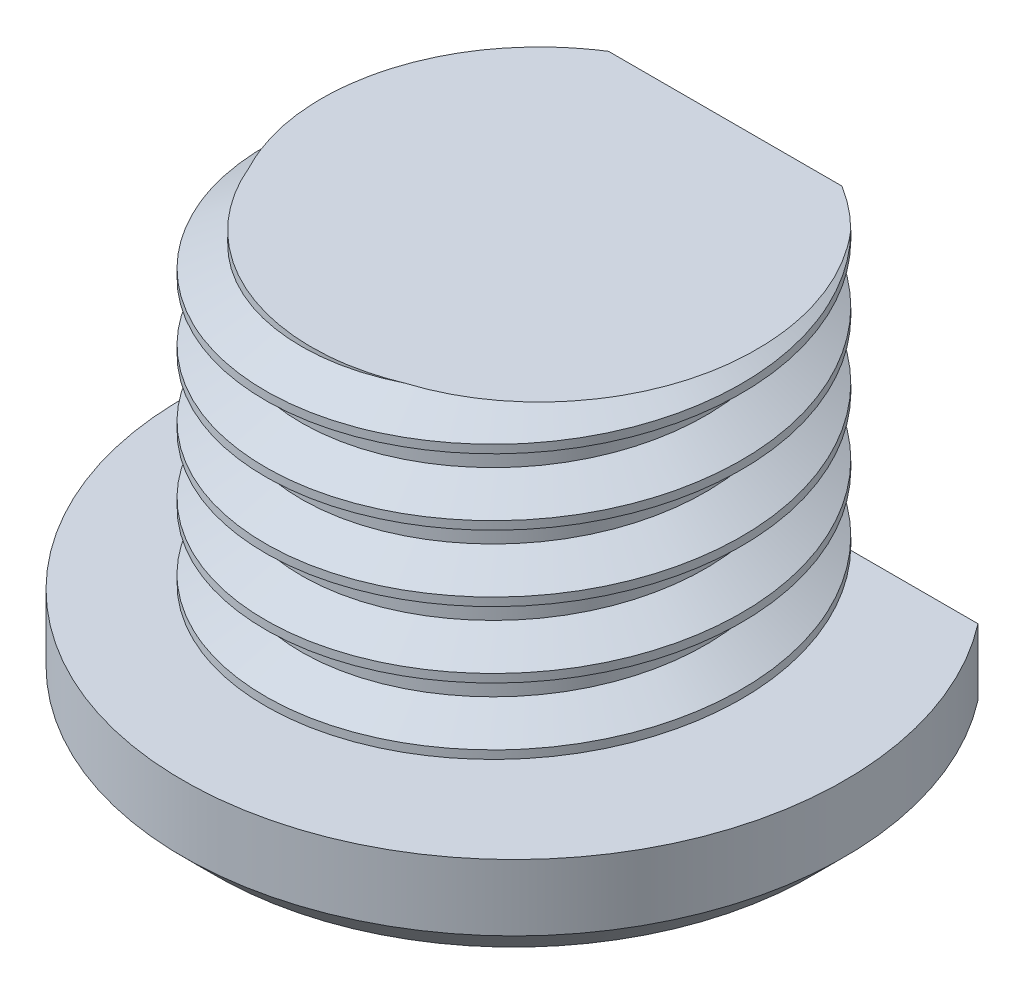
ISO-10303-21;
HEADER;
FILE_DESCRIPTION(('STEP AP214'),'2;1');
FILE_NAME('part.step','',(''),(''),'','','');
FILE_SCHEMA(('AUTOMOTIVE_DESIGN { 1 0 10303 214 1 1 1 1 }'));
ENDSEC;
DATA;
#1=APPLICATION_CONTEXT('core data for automotive mechanical design processes');
#2=APPLICATION_PROTOCOL_DEFINITION('international standard','automotive_design',2000,#1);
#3=PRODUCT_CONTEXT('',#1,'mechanical');
#4=PRODUCT('Part','Part','',(#3));
#5=PRODUCT_RELATED_PRODUCT_CATEGORY('part','',(#4));
#6=PRODUCT_DEFINITION_FORMATION('','',#4);
#7=PRODUCT_DEFINITION_CONTEXT('part definition',#1,'design');
#8=PRODUCT_DEFINITION('design','',#6,#7);
#9=PRODUCT_DEFINITION_SHAPE('','',#8);
#10=(LENGTH_UNIT() NAMED_UNIT(*) SI_UNIT(.MILLI.,.METRE.));
#11=(NAMED_UNIT(*) PLANE_ANGLE_UNIT() SI_UNIT($,.RADIAN.));
#12=(NAMED_UNIT(*) SI_UNIT($,.STERADIAN.) SOLID_ANGLE_UNIT());
#13=UNCERTAINTY_MEASURE_WITH_UNIT(LENGTH_MEASURE(1.E-05),#10,'distance_accuracy_value','');
#14=(GEOMETRIC_REPRESENTATION_CONTEXT(3) GLOBAL_UNCERTAINTY_ASSIGNED_CONTEXT((#13)) GLOBAL_UNIT_ASSIGNED_CONTEXT((#10,
#11,#12)) REPRESENTATION_CONTEXT('',''));
#15=CARTESIAN_POINT('',(0.,0.,0.));
#16=DIRECTION('',(0.,0.,1.));
#17=DIRECTION('',(1.,0.,0.));
#18=AXIS2_PLACEMENT_3D('',#15,#16,#17);
#19=CARTESIAN_POINT('',(0.,5.969,0.));
#20=DIRECTION('',(0.,-1.,0.));
#21=DIRECTION('',(-1.,0.,0.));
#22=AXIS2_PLACEMENT_3D('',#19,#20,#21);
#23=CYLINDRICAL_SURFACE('',#22,4.572);
#24=CARTESIAN_POINT('',(0.,6.12775000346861,-4.572));
#25=CARTESIAN_POINT('',(1.89378440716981,6.04837500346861,-4.57199999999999));
#26=CARTESIAN_POINT('',(3.23289220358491,5.96900000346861,-3.23289220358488));
#27=CARTESIAN_POINT('',(4.57200000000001,5.88962500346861,-1.89378440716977));
#28=CARTESIAN_POINT('',(4.572,5.81025000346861,0.));
#29=CARTESIAN_POINT('',(4.57199999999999,5.73087500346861,1.89378440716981));
#30=CARTESIAN_POINT('',(3.23289220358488,5.65150000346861,3.23289220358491));
#31=CARTESIAN_POINT('',(1.89378440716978,5.57212500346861,4.57200000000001));
#32=CARTESIAN_POINT('',(0.,5.49275000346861,4.572));
#33=CARTESIAN_POINT('',(-1.89378440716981,5.41337500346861,4.57199999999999));
#34=CARTESIAN_POINT('',(-3.23289220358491,5.33400000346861,3.23289220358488));
#35=CARTESIAN_POINT('',(-4.572,5.25462500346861,1.89378440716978));
#36=CARTESIAN_POINT('',(-4.572,5.17525000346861,0.));
#37=CARTESIAN_POINT('',(-4.57199999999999,5.09587500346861,-1.89378440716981));
#38=CARTESIAN_POINT('',(-3.23289220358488,5.01650000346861,-3.23289220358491));
#39=CARTESIAN_POINT('',(-1.89378440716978,4.93712500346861,-4.572));
#40=CARTESIAN_POINT('',(0.,4.85775000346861,-4.572));
#41=CARTESIAN_POINT('',(1.89378440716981,4.77837500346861,-4.57199999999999));
#42=CARTESIAN_POINT('',(3.23289220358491,4.69900000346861,-3.23289220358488));
#43=CARTESIAN_POINT('',(4.57200000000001,4.61962500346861,-1.89378440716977));
#44=CARTESIAN_POINT('',(4.572,4.54025000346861,0.));
#45=CARTESIAN_POINT('',(4.57199999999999,4.46087500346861,1.89378440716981));
#46=CARTESIAN_POINT('',(3.23289220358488,4.38150000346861,3.23289220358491));
#47=CARTESIAN_POINT('',(1.89378440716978,4.30212500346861,4.57200000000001));
#48=CARTESIAN_POINT('',(0.,4.22275000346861,4.572));
#49=CARTESIAN_POINT('',(-1.89378440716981,4.14337500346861,4.57199999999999));
#50=CARTESIAN_POINT('',(-3.23289220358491,4.06400000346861,3.23289220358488));
#51=CARTESIAN_POINT('',(-4.572,3.98462500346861,1.89378440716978));
#52=CARTESIAN_POINT('',(-4.572,3.90525000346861,0.));
#53=CARTESIAN_POINT('',(-4.57199999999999,3.82587500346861,-1.89378440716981));
#54=CARTESIAN_POINT('',(-3.23289220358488,3.74650000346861,-3.23289220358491));
#55=CARTESIAN_POINT('',(-1.89378440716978,3.66712500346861,-4.572));
#56=CARTESIAN_POINT('',(0.,3.58775000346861,-4.572));
#57=CARTESIAN_POINT('',(1.89378440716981,3.50837500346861,-4.57199999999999));
#58=CARTESIAN_POINT('',(3.23289220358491,3.42900000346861,-3.23289220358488));
#59=CARTESIAN_POINT('',(4.57200000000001,3.34962500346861,-1.89378440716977));
#60=CARTESIAN_POINT('',(4.572,3.27025000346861,0.));
#61=CARTESIAN_POINT('',(4.57199999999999,3.19087500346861,1.89378440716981));
#62=CARTESIAN_POINT('',(3.23289220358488,3.11150000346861,3.23289220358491));
#63=CARTESIAN_POINT('',(1.89378440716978,3.03212500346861,4.57200000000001));
#64=CARTESIAN_POINT('',(0.,2.95275000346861,4.572));
#65=CARTESIAN_POINT('',(-1.89378440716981,2.87337500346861,4.57199999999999));
#66=CARTESIAN_POINT('',(-3.23289220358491,2.79400000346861,3.23289220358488));
#67=CARTESIAN_POINT('',(-4.572,2.71462500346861,1.89378440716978));
#68=CARTESIAN_POINT('',(-4.572,2.63525000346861,0.));
#69=CARTESIAN_POINT('',(-4.57199999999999,2.55587500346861,-1.89378440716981));
#70=CARTESIAN_POINT('',(-3.23289220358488,2.47650000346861,-3.23289220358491));
#71=CARTESIAN_POINT('',(-1.89378440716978,2.39712500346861,-4.572));
#72=CARTESIAN_POINT('',(0.,2.31775000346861,-4.572));
#73=CARTESIAN_POINT('',(1.89378440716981,2.23837500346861,-4.57199999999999));
#74=CARTESIAN_POINT('',(3.23289220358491,2.15900000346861,-3.23289220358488));
#75=CARTESIAN_POINT('',(4.57200000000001,2.07962500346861,-1.89378440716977));
#76=CARTESIAN_POINT('',(4.572,2.00025000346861,0.));
#77=CARTESIAN_POINT('',(4.57199999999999,1.92087500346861,1.89378440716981));
#78=CARTESIAN_POINT('',(3.23289220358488,1.84150000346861,3.23289220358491));
#79=CARTESIAN_POINT('',(1.89378440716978,1.76212500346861,4.57200000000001));
#80=CARTESIAN_POINT('',(0.,1.68275000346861,4.572));
#81=CARTESIAN_POINT('',(-1.89378440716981,1.60337500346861,4.57199999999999));
#82=CARTESIAN_POINT('',(-3.23289220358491,1.52400000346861,3.23289220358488));
#83=CARTESIAN_POINT('',(-4.572,1.44462500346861,1.89378440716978));
#84=CARTESIAN_POINT('',(-4.572,1.36525000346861,0.));
#85=CARTESIAN_POINT('',(-4.57199999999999,1.28587500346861,-1.89378440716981));
#86=CARTESIAN_POINT('',(-3.23289220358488,1.20650000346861,-3.23289220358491));
#87=CARTESIAN_POINT('',(-1.89378440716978,1.12712500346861,-4.572));
#88=CARTESIAN_POINT('',(0.,1.04775000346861,-4.572));
#89=CARTESIAN_POINT('',(1.89378440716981,0.968375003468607,-4.57199999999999));
#90=CARTESIAN_POINT('',(3.23289220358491,0.889000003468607,-3.23289220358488));
#91=CARTESIAN_POINT('',(4.57200000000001,0.809625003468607,-1.89378440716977));
#92=CARTESIAN_POINT('',(4.572,0.730250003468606,0.));
#93=CARTESIAN_POINT('',(4.57199999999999,0.650875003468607,1.89378440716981));
#94=CARTESIAN_POINT('',(3.23289220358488,0.571500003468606,3.23289220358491));
#95=CARTESIAN_POINT('',(1.89378440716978,0.492125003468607,4.57200000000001));
#96=CARTESIAN_POINT('',(0.,0.412750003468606,4.572));
#97=CARTESIAN_POINT('',(-1.89378440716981,0.333375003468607,4.57199999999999));
#98=CARTESIAN_POINT('',(-3.23289220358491,0.254000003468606,3.23289220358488));
#99=CARTESIAN_POINT('',(-4.572,0.174625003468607,1.89378440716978));
#100=CARTESIAN_POINT('',(-4.572,0.0952500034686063,0.));
#101=CARTESIAN_POINT('',(-4.57199999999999,0.0158750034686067,-1.89378440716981));
#102=CARTESIAN_POINT('',(-3.23289220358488,-0.0634999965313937,-3.23289220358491));
#103=CARTESIAN_POINT('',(-1.89378440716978,-0.142874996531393,-4.572));
#104=CARTESIAN_POINT('',(0.,-0.222249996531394,-4.572));
#105=CARTESIAN_POINT('',(1.89378440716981,-0.301624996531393,-4.57199999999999));
#106=CARTESIAN_POINT('',(3.23289220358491,-0.380999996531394,-3.23289220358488));
#107=CARTESIAN_POINT('',(4.57200000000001,-0.460374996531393,-1.89378440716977));
#108=CARTESIAN_POINT('',(4.572,-0.539749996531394,0.));
#109=CARTESIAN_POINT('',(4.57199999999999,-0.619124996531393,1.89378440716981));
#110=CARTESIAN_POINT('',(3.23289220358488,-0.698499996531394,3.23289220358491));
#111=CARTESIAN_POINT('',(1.89378440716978,-0.777874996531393,4.57200000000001));
#112=CARTESIAN_POINT('',(0.,-0.857249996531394,4.572));
#113=CARTESIAN_POINT('',(-1.89378440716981,-0.936624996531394,4.57199999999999));
#114=CARTESIAN_POINT('',(-3.23289220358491,-1.01599999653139,3.23289220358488));
#115=CARTESIAN_POINT('',(-4.572,-1.09537499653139,1.89378440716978));
#116=CARTESIAN_POINT('',(-4.572,-1.17474999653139,0.));
#117=CARTESIAN_POINT('',(-4.57199999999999,-1.25412499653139,-1.89378440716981));
#118=CARTESIAN_POINT('',(-3.23289220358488,-1.33349999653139,-3.23289220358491));
#119=CARTESIAN_POINT('',(-1.89378440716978,-1.41287499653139,-4.572));
#120=CARTESIAN_POINT('',(0.,-1.49224999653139,-4.572));
#121=(BOUNDED_CURVE() B_SPLINE_CURVE(2,(#24,#25,#26,#27,#28,#29,#30,#31,#32,#33,#34,#35,#36,#37,
#38,#39,#40,#41,#42,#43,#44,#45,#46,#47,#48,#49,#50,#51,#52,#53,#54,#55,#56,#57,#58,#59,#60,#61,
#62,#63,#64,#65,#66,#67,#68,#69,#70,#71,#72,#73,#74,#75,#76,#77,#78,#79,#80,#81,#82,#83,#84,#85,
#86,#87,#88,#89,#90,#91,#92,#93,#94,#95,#96,#97,#98,#99,#100,#101,#102,#103,#104,#105,#106,#107,
#108,#109,#110,#111,#112,#113,#114,#115,#116,#117,#118,#119,#120),.UNSPECIFIED.,.F.,
.F.) B_SPLINE_CURVE_WITH_KNOTS((3,2,2,2,2,2,2,2,2,2,2,2,2,2,2,2,2,2,2,2,2,2,2,2,2,2,2,2,2,2,2,2,
2,2,2,2,2,2,2,2,2,2,2,2,2,2,2,2,3),(0.,0.0208333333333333,0.0416666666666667,0.0625,
0.0833333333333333,0.104166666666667,0.125,0.145833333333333,0.166666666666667,0.1875,
0.208333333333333,0.229166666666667,0.25,0.270833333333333,0.291666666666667,0.3125,
0.333333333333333,0.354166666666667,0.375,0.395833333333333,0.416666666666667,0.4375,
0.458333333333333,0.479166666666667,0.5,0.520833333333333,0.541666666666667,0.5625,
0.583333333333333,0.604166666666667,0.625,0.645833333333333,0.666666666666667,0.6875,
0.708333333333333,0.729166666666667,0.75,0.770833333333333,0.791666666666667,0.8125,
0.833333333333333,0.854166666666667,0.875,0.895833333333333,0.916666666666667,0.9375,
0.958333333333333,0.979166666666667,1.),
.UNSPECIFIED.) CURVE() GEOMETRIC_REPRESENTATION_ITEM() RATIONAL_B_SPLINE_CURVE((1.,
0.923879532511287,1.,0.923879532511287,1.,0.923879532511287,1.,0.923879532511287,1.,
0.923879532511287,1.,0.923879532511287,1.,0.923879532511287,1.,0.923879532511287,1.,
0.923879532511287,1.,0.923879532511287,1.,0.923879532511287,1.,0.923879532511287,1.,
0.923879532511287,1.,0.923879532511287,1.,0.923879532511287,1.,0.923879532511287,1.,
0.923879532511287,1.,0.923879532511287,1.,0.923879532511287,1.,0.923879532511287,1.,
0.923879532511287,1.,0.923879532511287,1.,0.923879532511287,1.,0.923879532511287,1.,
0.923879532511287,1.,0.923879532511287,1.,0.923879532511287,1.,0.923879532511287,1.,
0.923879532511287,1.,0.923879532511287,1.,0.923879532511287,1.,0.923879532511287,1.,
0.923879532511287,1.,0.923879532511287,1.,0.923879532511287,1.,0.923879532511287,1.,
0.923879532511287,1.,0.923879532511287,1.,0.923879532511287,1.,0.923879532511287,1.,
0.923879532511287,1.,0.923879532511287,1.,0.923879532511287,1.,0.923879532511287,1.,
0.923879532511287,1.,0.923879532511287,1.,0.923879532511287,1.,0.923879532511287,1.)) REPRESENTATION_ITEM(''));
#122=CARTESIAN_POINT('',(2.41254409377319,2.20468165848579,-3.88366000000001));
#123=VERTEX_POINT('',#122);
#124=CARTESIAN_POINT('',(-2.41254409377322,1.16081834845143,-3.88365999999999));
#125=VERTEX_POINT('',#124);
#126=EDGE_CURVE('E778',#123,#125,#121,.T.);
#127=ORIENTED_EDGE('',*,*,#126,.T.);
#128=DIRECTION('',(0.,-1.,0.));
#129=VECTOR('',#128,1.);
#130=CARTESIAN_POINT('',(-2.41254409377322,5.969,-3.88365999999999));
#131=LINE('',#130,#129);
#132=CARTESIAN_POINT('',(-2.41254409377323,1.00206834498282,-3.88365999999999));
#133=VERTEX_POINT('',#132);
#134=EDGE_CURVE('E700',#125,#133,#131,.T.);
#135=ORIENTED_EDGE('',*,*,#134,.T.);
#136=CARTESIAN_POINT('',(0.,7.239,-4.572));
#137=CARTESIAN_POINT('',(1.89378440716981,7.159625,-4.57199999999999));
#138=CARTESIAN_POINT('',(3.23289220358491,7.08025,-3.23289220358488));
#139=CARTESIAN_POINT('',(4.57200000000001,7.000875,-1.89378440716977));
#140=CARTESIAN_POINT('',(4.572,6.9215,0.));
#141=CARTESIAN_POINT('',(4.57199999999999,6.842125,1.89378440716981));
#142=CARTESIAN_POINT('',(3.23289220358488,6.76275,3.23289220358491));
#143=CARTESIAN_POINT('',(1.89378440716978,6.683375,4.57200000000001));
#144=CARTESIAN_POINT('',(0.,6.604,4.572));
#145=CARTESIAN_POINT('',(-1.89378440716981,6.524625,4.57199999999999));
#146=CARTESIAN_POINT('',(-3.23289220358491,6.44525,3.23289220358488));
#147=CARTESIAN_POINT('',(-4.572,6.365875,1.89378440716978));
#148=CARTESIAN_POINT('',(-4.572,6.2865,0.));
#149=CARTESIAN_POINT('',(-4.57199999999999,6.207125,-1.89378440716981));
#150=CARTESIAN_POINT('',(-3.23289220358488,6.12775,-3.23289220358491));
#151=CARTESIAN_POINT('',(-1.89378440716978,6.048375,-4.572));
#152=CARTESIAN_POINT('',(0.,5.969,-4.572));
#153=CARTESIAN_POINT('',(1.89378440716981,5.889625,-4.57199999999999));
#154=CARTESIAN_POINT('',(3.23289220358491,5.81025,-3.23289220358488));
#155=CARTESIAN_POINT('',(4.57200000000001,5.730875,-1.89378440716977));
#156=CARTESIAN_POINT('',(4.572,5.6515,0.));
#157=CARTESIAN_POINT('',(4.57199999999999,5.572125,1.89378440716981));
#158=CARTESIAN_POINT('',(3.23289220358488,5.49275,3.23289220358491));
#159=CARTESIAN_POINT('',(1.89378440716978,5.413375,4.57200000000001));
#160=CARTESIAN_POINT('',(0.,5.334,4.572));
#161=CARTESIAN_POINT('',(-1.89378440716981,5.254625,4.57199999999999));
#162=CARTESIAN_POINT('',(-3.23289220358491,5.17525,3.23289220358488));
#163=CARTESIAN_POINT('',(-4.572,5.095875,1.89378440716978));
#164=CARTESIAN_POINT('',(-4.572,5.0165,0.));
#165=CARTESIAN_POINT('',(-4.57199999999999,4.937125,-1.89378440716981));
#166=CARTESIAN_POINT('',(-3.23289220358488,4.85775,-3.23289220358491));
#167=CARTESIAN_POINT('',(-1.89378440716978,4.778375,-4.572));
#168=CARTESIAN_POINT('',(0.,4.699,-4.572));
#169=CARTESIAN_POINT('',(1.89378440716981,4.619625,-4.57199999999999));
#170=CARTESIAN_POINT('',(3.23289220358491,4.54025,-3.23289220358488));
#171=CARTESIAN_POINT('',(4.57200000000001,4.460875,-1.89378440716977));
#172=CARTESIAN_POINT('',(4.572,4.3815,0.));
#173=CARTESIAN_POINT('',(4.57199999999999,4.302125,1.89378440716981));
#174=CARTESIAN_POINT('',(3.23289220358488,4.22275,3.23289220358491));
#175=CARTESIAN_POINT('',(1.89378440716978,4.143375,4.57200000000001));
#176=CARTESIAN_POINT('',(0.,4.064,4.572));
#177=CARTESIAN_POINT('',(-1.89378440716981,3.984625,4.57199999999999));
#178=CARTESIAN_POINT('',(-3.23289220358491,3.90525,3.23289220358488));
#179=CARTESIAN_POINT('',(-4.572,3.825875,1.89378440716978));
#180=CARTESIAN_POINT('',(-4.572,3.7465,0.));
#181=CARTESIAN_POINT('',(-4.57199999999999,3.667125,-1.89378440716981));
#182=CARTESIAN_POINT('',(-3.23289220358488,3.58775,-3.23289220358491));
#183=CARTESIAN_POINT('',(-1.89378440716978,3.508375,-4.572));
#184=CARTESIAN_POINT('',(0.,3.429,-4.572));
#185=CARTESIAN_POINT('',(1.89378440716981,3.349625,-4.57199999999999));
#186=CARTESIAN_POINT('',(3.23289220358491,3.27025,-3.23289220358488));
#187=CARTESIAN_POINT('',(4.57200000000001,3.190875,-1.89378440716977));
#188=CARTESIAN_POINT('',(4.572,3.1115,0.));
#189=CARTESIAN_POINT('',(4.57199999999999,3.032125,1.89378440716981));
#190=CARTESIAN_POINT('',(3.23289220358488,2.95275,3.23289220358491));
#191=CARTESIAN_POINT('',(1.89378440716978,2.873375,4.57200000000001));
#192=CARTESIAN_POINT('',(0.,2.794,4.572));
#193=CARTESIAN_POINT('',(-1.89378440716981,2.714625,4.57199999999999));
#194=CARTESIAN_POINT('',(-3.23289220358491,2.63525,3.23289220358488));
#195=CARTESIAN_POINT('',(-4.572,2.555875,1.89378440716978));
#196=CARTESIAN_POINT('',(-4.572,2.4765,0.));
#197=CARTESIAN_POINT('',(-4.57199999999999,2.397125,-1.89378440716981));
#198=CARTESIAN_POINT('',(-3.23289220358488,2.31775,-3.23289220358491));
#199=CARTESIAN_POINT('',(-1.89378440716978,2.238375,-4.572));
#200=CARTESIAN_POINT('',(0.,2.159,-4.572));
#201=CARTESIAN_POINT('',(1.89378440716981,2.079625,-4.57199999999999));
#202=CARTESIAN_POINT('',(3.23289220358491,2.00025,-3.23289220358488));
#203=CARTESIAN_POINT('',(4.57200000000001,1.920875,-1.89378440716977));
#204=CARTESIAN_POINT('',(4.572,1.8415,0.));
#205=CARTESIAN_POINT('',(4.57199999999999,1.762125,1.89378440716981));
#206=CARTESIAN_POINT('',(3.23289220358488,1.68275,3.23289220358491));
#207=CARTESIAN_POINT('',(1.89378440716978,1.603375,4.57200000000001));
#208=CARTESIAN_POINT('',(0.,1.524,4.572));
#209=CARTESIAN_POINT('',(-1.89378440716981,1.444625,4.57199999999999));
#210=CARTESIAN_POINT('',(-3.23289220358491,1.36525,3.23289220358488));
#211=CARTESIAN_POINT('',(-4.572,1.285875,1.89378440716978));
#212=CARTESIAN_POINT('',(-4.572,1.2065,0.));
#213=CARTESIAN_POINT('',(-4.57199999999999,1.127125,-1.89378440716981));
#214=CARTESIAN_POINT('',(-3.23289220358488,1.04775,-3.23289220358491));
#215=CARTESIAN_POINT('',(-1.89378440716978,0.968375,-4.572));
#216=CARTESIAN_POINT('',(0.,0.888999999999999,-4.572));
#217=CARTESIAN_POINT('',(1.89378440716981,0.809625,-4.57199999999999));
#218=CARTESIAN_POINT('',(3.23289220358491,0.730249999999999,-3.23289220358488));
#219=CARTESIAN_POINT('',(4.57200000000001,0.650875,-1.89378440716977));
#220=CARTESIAN_POINT('',(4.572,0.571499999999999,0.));
#221=CARTESIAN_POINT('',(4.57199999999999,0.492124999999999,1.89378440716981));
#222=CARTESIAN_POINT('',(3.23289220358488,0.412749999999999,3.23289220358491));
#223=CARTESIAN_POINT('',(1.89378440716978,0.333374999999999,4.57200000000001));
#224=CARTESIAN_POINT('',(0.,0.253999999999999,4.572));
#225=CARTESIAN_POINT('',(-1.89378440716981,0.174624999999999,4.57199999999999));
#226=CARTESIAN_POINT('',(-3.23289220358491,0.095249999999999,3.23289220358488));
#227=CARTESIAN_POINT('',(-4.572,0.0158749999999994,1.89378440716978));
#228=CARTESIAN_POINT('',(-4.572,-0.0635000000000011,0.));
#229=CARTESIAN_POINT('',(-4.57199999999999,-0.142875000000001,-1.89378440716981));
#230=CARTESIAN_POINT('',(-3.23289220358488,-0.222250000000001,-3.23289220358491));
#231=CARTESIAN_POINT('',(-1.89378440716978,-0.301625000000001,-4.572));
#232=CARTESIAN_POINT('',(0.,-0.381,-4.572));
#233=(BOUNDED_CURVE() B_SPLINE_CURVE(2,(#136,#137,#138,#139,#140,#141,#142,#143,#144,#145,#146,
#147,#148,#149,#150,#151,#152,#153,#154,#155,#156,#157,#158,#159,#160,#161,#162,#163,#164,#165,
#166,#167,#168,#169,#170,#171,#172,#173,#174,#175,#176,#177,#178,#179,#180,#181,#182,#183,#184,
#185,#186,#187,#188,#189,#190,#191,#192,#193,#194,#195,#196,#197,#198,#199,#200,#201,#202,#203,
#204,#205,#206,#207,#208,#209,#210,#211,#212,#213,#214,#215,#216,#217,#218,#219,#220,#221,#222,
#223,#224,#225,#226,#227,#228,#229,#230,#231,#232),.UNSPECIFIED.,.F.,
.F.) B_SPLINE_CURVE_WITH_KNOTS((3,2,2,2,2,2,2,2,2,2,2,2,2,2,2,2,2,2,2,2,2,2,2,2,2,2,2,2,2,2,2,2,
2,2,2,2,2,2,2,2,2,2,2,2,2,2,2,2,3),(0.,0.0208333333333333,0.0416666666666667,0.0625,
0.0833333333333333,0.104166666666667,0.125,0.145833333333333,0.166666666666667,0.1875,
0.208333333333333,0.229166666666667,0.25,0.270833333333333,0.291666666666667,0.3125,
0.333333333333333,0.354166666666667,0.375,0.395833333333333,0.416666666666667,0.4375,
0.458333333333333,0.479166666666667,0.5,0.520833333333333,0.541666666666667,0.5625,
0.583333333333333,0.604166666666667,0.625,0.645833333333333,0.666666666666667,0.6875,
0.708333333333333,0.729166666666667,0.75,0.770833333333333,0.791666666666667,0.8125,
0.833333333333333,0.854166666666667,0.875,0.895833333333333,0.916666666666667,0.9375,
0.958333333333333,0.979166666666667,1.),
.UNSPECIFIED.) CURVE() GEOMETRIC_REPRESENTATION_ITEM() RATIONAL_B_SPLINE_CURVE((1.,
0.923879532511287,1.,0.923879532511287,1.,0.923879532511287,1.,0.923879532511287,1.,
0.923879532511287,1.,0.923879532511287,1.,0.923879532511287,1.,0.923879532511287,1.,
0.923879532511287,1.,0.923879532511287,1.,0.923879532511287,1.,0.923879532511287,1.,
0.923879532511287,1.,0.923879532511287,1.,0.923879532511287,1.,0.923879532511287,1.,
0.923879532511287,1.,0.923879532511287,1.,0.923879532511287,1.,0.923879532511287,1.,
0.923879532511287,1.,0.923879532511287,1.,0.923879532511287,1.,0.923879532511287,1.,
0.923879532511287,1.,0.923879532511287,1.,0.923879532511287,1.,0.923879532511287,1.,
0.923879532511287,1.,0.923879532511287,1.,0.923879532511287,1.,0.923879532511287,1.,
0.923879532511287,1.,0.923879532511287,1.,0.923879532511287,1.,0.923879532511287,1.,
0.923879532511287,1.,0.923879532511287,1.,0.923879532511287,1.,0.923879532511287,1.,
0.923879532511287,1.,0.923879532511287,1.,0.923879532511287,1.,0.923879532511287,1.,
0.923879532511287,1.,0.923879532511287,1.,0.923879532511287,1.,0.923879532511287,1.)) REPRESENTATION_ITEM(''));
#234=CARTESIAN_POINT('',(2.4125440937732,2.04593165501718,-3.88366000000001));
#235=VERTEX_POINT('',#234);
#236=EDGE_CURVE('E630',#235,#133,#233,.T.);
#237=ORIENTED_EDGE('',*,*,#236,.F.);
#238=DIRECTION('',(0.,-1.,0.));
#239=VECTOR('',#238,1.);
#240=CARTESIAN_POINT('',(2.4125440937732,5.969,-3.88366000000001));
#241=LINE('',#240,#239);
#242=EDGE_CURVE('E776',#235,#123,#241,.F.);
#243=ORIENTED_EDGE('',*,*,#242,.T.);
#244=EDGE_LOOP('',(#127,#135,#237,#243));
#245=FACE_BOUND('',#244,.T.);
#246=ADVANCED_FACE('F38',(#245),#23,.T.);
#247=CARTESIAN_POINT('',(2.4125440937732,3.47468165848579,-3.88366000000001));
#248=VERTEX_POINT('',#247);
#249=CARTESIAN_POINT('',(-2.41254409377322,2.43081834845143,-3.88365999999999));
#250=VERTEX_POINT('',#249);
#251=EDGE_CURVE('E784',#248,#250,#121,.T.);
#252=ORIENTED_EDGE('',*,*,#251,.T.);
#253=CARTESIAN_POINT('',(-2.41254409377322,2.27206834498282,-3.88365999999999));
#254=VERTEX_POINT('',#253);
#255=EDGE_CURVE('E694',#250,#254,#131,.T.);
#256=ORIENTED_EDGE('',*,*,#255,.T.);
#257=CARTESIAN_POINT('',(2.4125440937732,3.31593165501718,-3.88366000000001));
#258=VERTEX_POINT('',#257);
#259=EDGE_CURVE('E765',#258,#254,#233,.T.);
#260=ORIENTED_EDGE('',*,*,#259,.F.);
#261=EDGE_CURVE('E780',#258,#248,#241,.F.);
#262=ORIENTED_EDGE('',*,*,#261,.T.);
#263=EDGE_LOOP('',(#252,#256,#260,#262));
#264=FACE_BOUND('',#263,.T.);
#265=ADVANCED_FACE('F879',(#264),#23,.T.);
#266=CARTESIAN_POINT('',(2.4125440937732,4.74468165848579,-3.88366000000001));
#267=VERTEX_POINT('',#266);
#268=CARTESIAN_POINT('',(-2.41254409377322,3.70081834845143,-3.88365999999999));
#269=VERTEX_POINT('',#268);
#270=EDGE_CURVE('E622',#267,#269,#121,.T.);
#271=ORIENTED_EDGE('',*,*,#270,.T.);
#272=CARTESIAN_POINT('',(-2.41254409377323,3.54206834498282,-3.88365999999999));
#273=VERTEX_POINT('',#272);
#274=EDGE_CURVE('E691',#269,#273,#131,.T.);
#275=ORIENTED_EDGE('',*,*,#274,.T.);
#276=CARTESIAN_POINT('',(2.4125440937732,4.58593165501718,-3.88366000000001));
#277=VERTEX_POINT('',#276);
#278=EDGE_CURVE('E688',#277,#273,#233,.T.);
#279=ORIENTED_EDGE('',*,*,#278,.F.);
#280=EDGE_CURVE('E864',#277,#267,#241,.F.);
#281=ORIENTED_EDGE('',*,*,#280,.T.);
#282=EDGE_LOOP('',(#271,#275,#279,#281));
#283=FACE_BOUND('',#282,.T.);
#284=ADVANCED_FACE('F881',(#283),#23,.T.);
#285=CARTESIAN_POINT('',(3.23289226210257,5.969,-3.23289214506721));
#286=VERTEX_POINT('',#285);
#287=CARTESIAN_POINT('',(-2.41254409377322,4.97081834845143,-3.88365999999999));
#288=VERTEX_POINT('',#287);
#289=EDGE_CURVE('E252',#286,#288,#121,.T.);
#290=ORIENTED_EDGE('',*,*,#289,.T.);
#291=CARTESIAN_POINT('',(-2.41254409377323,4.81206834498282,-3.88365999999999));
#292=VERTEX_POINT('',#291);
#293=EDGE_CURVE('E695',#288,#292,#131,.T.);
#294=ORIENTED_EDGE('',*,*,#293,.T.);
#295=CARTESIAN_POINT('',(2.4125440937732,5.85593165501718,-3.88366000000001));
#296=VERTEX_POINT('',#295);
#297=EDGE_CURVE('E631',#296,#292,#233,.T.);
#298=ORIENTED_EDGE('',*,*,#297,.F.);
#299=CARTESIAN_POINT('',(2.4125440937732,5.969,-3.88366000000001));
#300=VERTEX_POINT('',#299);
#301=EDGE_CURVE('E859',#296,#300,#241,.F.);
#302=ORIENTED_EDGE('',*,*,#301,.T.);
#303=CARTESIAN_POINT('',(0.,5.969,0.));
#304=DIRECTION('',(0.,1.,0.));
#305=DIRECTION('',(1.,0.,0.));
#306=AXIS2_PLACEMENT_3D('',#303,#304,#305);
#307=CIRCLE('',#306,4.572);
#308=EDGE_CURVE('E802',#286,#300,#307,.T.);
#309=ORIENTED_EDGE('',*,*,#308,.F.);
#310=EDGE_LOOP('',(#290,#294,#298,#302,#309));
#311=FACE_BOUND('',#310,.T.);
#312=ADVANCED_FACE('F886',(#311),#23,.T.);
#313=CARTESIAN_POINT('',(0.,6.8421250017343,-3.88459233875));
#314=CARTESIAN_POINT('',(1.60905083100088,6.7627500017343,-3.88459233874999));
#315=CARTESIAN_POINT('',(2.74682158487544,6.6833750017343,-2.74682158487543));
#316=CARTESIAN_POINT('',(3.88459233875,6.6040000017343,-1.60905083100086));
#317=CARTESIAN_POINT('',(3.88459233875,6.5246250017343,0.));
#318=CARTESIAN_POINT('',(3.88459233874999,6.4452500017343,1.60905083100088));
#319=CARTESIAN_POINT('',(2.74682158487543,6.3658750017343,2.74682158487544));
#320=CARTESIAN_POINT('',(1.60905083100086,6.2865000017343,3.88459233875));
#321=CARTESIAN_POINT('',(0.,6.2071250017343,3.88459233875));
#322=CARTESIAN_POINT('',(-1.60905083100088,6.1277500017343,3.88459233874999));
#323=CARTESIAN_POINT('',(-2.74682158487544,6.0483750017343,2.74682158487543));
#324=CARTESIAN_POINT('',(-3.88459233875,5.9690000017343,1.60905083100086));
#325=CARTESIAN_POINT('',(-3.88459233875,5.8896250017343,0.));
#326=CARTESIAN_POINT('',(-3.88459233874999,5.8102500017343,-1.60905083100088));
#327=CARTESIAN_POINT('',(-2.74682158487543,5.7308750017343,-2.74682158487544));
#328=CARTESIAN_POINT('',(-1.60905083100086,5.6515000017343,-3.88459233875));
#329=CARTESIAN_POINT('',(0.,5.5721250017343,-3.88459233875));
#330=CARTESIAN_POINT('',(1.60905083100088,5.4927500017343,-3.88459233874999));
#331=CARTESIAN_POINT('',(2.74682158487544,5.4133750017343,-2.74682158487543));
#332=CARTESIAN_POINT('',(3.88459233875,5.3340000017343,-1.60905083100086));
#333=CARTESIAN_POINT('',(3.88459233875,5.2546250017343,0.));
#334=CARTESIAN_POINT('',(3.88459233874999,5.1752500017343,1.60905083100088));
#335=CARTESIAN_POINT('',(2.74682158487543,5.0958750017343,2.74682158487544));
#336=CARTESIAN_POINT('',(1.60905083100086,5.0165000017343,3.88459233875));
#337=CARTESIAN_POINT('',(0.,4.9371250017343,3.88459233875));
#338=CARTESIAN_POINT('',(-1.60905083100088,4.8577500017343,3.88459233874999));
#339=CARTESIAN_POINT('',(-2.74682158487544,4.7783750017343,2.74682158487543));
#340=CARTESIAN_POINT('',(-3.88459233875,4.6990000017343,1.60905083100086));
#341=CARTESIAN_POINT('',(-3.88459233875,4.6196250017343,0.));
#342=CARTESIAN_POINT('',(-3.88459233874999,4.5402500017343,-1.60905083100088));
#343=CARTESIAN_POINT('',(-2.74682158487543,4.4608750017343,-2.74682158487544));
#344=CARTESIAN_POINT('',(-1.60905083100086,4.3815000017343,-3.88459233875));
#345=CARTESIAN_POINT('',(0.,4.3021250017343,-3.88459233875));
#346=CARTESIAN_POINT('',(1.60905083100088,4.2227500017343,-3.88459233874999));
#347=CARTESIAN_POINT('',(2.74682158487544,4.1433750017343,-2.74682158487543));
#348=CARTESIAN_POINT('',(3.88459233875,4.0640000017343,-1.60905083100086));
#349=CARTESIAN_POINT('',(3.88459233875,3.9846250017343,0.));
#350=CARTESIAN_POINT('',(3.88459233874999,3.9052500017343,1.60905083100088));
#351=CARTESIAN_POINT('',(2.74682158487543,3.8258750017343,2.74682158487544));
#352=CARTESIAN_POINT('',(1.60905083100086,3.7465000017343,3.88459233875));
#353=CARTESIAN_POINT('',(0.,3.6671250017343,3.88459233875));
#354=CARTESIAN_POINT('',(-1.60905083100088,3.5877500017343,3.88459233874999));
#355=CARTESIAN_POINT('',(-2.74682158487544,3.5083750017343,2.74682158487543));
#356=CARTESIAN_POINT('',(-3.88459233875,3.4290000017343,1.60905083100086));
#357=CARTESIAN_POINT('',(-3.88459233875,3.3496250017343,0.));
#358=CARTESIAN_POINT('',(-3.88459233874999,3.2702500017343,-1.60905083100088));
#359=CARTESIAN_POINT('',(-2.74682158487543,3.1908750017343,-2.74682158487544));
#360=CARTESIAN_POINT('',(-1.60905083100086,3.1115000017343,-3.88459233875));
#361=CARTESIAN_POINT('',(0.,3.0321250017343,-3.88459233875));
#362=CARTESIAN_POINT('',(1.60905083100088,2.9527500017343,-3.88459233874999));
#363=CARTESIAN_POINT('',(2.74682158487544,2.8733750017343,-2.74682158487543));
#364=CARTESIAN_POINT('',(3.88459233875,2.7940000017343,-1.60905083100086));
#365=CARTESIAN_POINT('',(3.88459233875,2.7146250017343,0.));
#366=CARTESIAN_POINT('',(3.88459233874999,2.6352500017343,1.60905083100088));
#367=CARTESIAN_POINT('',(2.74682158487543,2.5558750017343,2.74682158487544));
#368=CARTESIAN_POINT('',(1.60905083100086,2.4765000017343,3.88459233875));
#369=CARTESIAN_POINT('',(0.,2.3971250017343,3.88459233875));
#370=CARTESIAN_POINT('',(-1.60905083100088,2.3177500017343,3.88459233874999));
#371=CARTESIAN_POINT('',(-2.74682158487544,2.2383750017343,2.74682158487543));
#372=CARTESIAN_POINT('',(-3.88459233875,2.1590000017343,1.60905083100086));
#373=CARTESIAN_POINT('',(-3.88459233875,2.0796250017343,0.));
#374=CARTESIAN_POINT('',(-3.88459233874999,2.0002500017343,-1.60905083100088));
#375=CARTESIAN_POINT('',(-2.74682158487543,1.9208750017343,-2.74682158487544));
#376=CARTESIAN_POINT('',(-1.60905083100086,1.8415000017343,-3.88459233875));
#377=CARTESIAN_POINT('',(0.,1.7621250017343,-3.88459233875));
#378=CARTESIAN_POINT('',(1.60905083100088,1.6827500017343,-3.88459233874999));
#379=CARTESIAN_POINT('',(2.74682158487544,1.6033750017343,-2.74682158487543));
#380=CARTESIAN_POINT('',(3.88459233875,1.5240000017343,-1.60905083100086));
#381=CARTESIAN_POINT('',(3.88459233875,1.4446250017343,0.));
#382=CARTESIAN_POINT('',(3.88459233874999,1.3652500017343,1.60905083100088));
#383=CARTESIAN_POINT('',(2.74682158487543,1.2858750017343,2.74682158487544));
#384=CARTESIAN_POINT('',(1.60905083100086,1.2065000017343,3.88459233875));
#385=CARTESIAN_POINT('',(0.,1.1271250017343,3.88459233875));
#386=CARTESIAN_POINT('',(-1.60905083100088,1.0477500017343,3.88459233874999));
#387=CARTESIAN_POINT('',(-2.74682158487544,0.968375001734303,2.74682158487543));
#388=CARTESIAN_POINT('',(-3.88459233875,0.889000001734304,1.60905083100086));
#389=CARTESIAN_POINT('',(-3.88459233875,0.809625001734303,0.));
#390=CARTESIAN_POINT('',(-3.88459233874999,0.730250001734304,-1.60905083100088));
#391=CARTESIAN_POINT('',(-2.74682158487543,0.650875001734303,-2.74682158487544));
#392=CARTESIAN_POINT('',(-1.60905083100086,0.571500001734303,-3.88459233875));
#393=CARTESIAN_POINT('',(0.,0.492125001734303,-3.88459233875));
#394=CARTESIAN_POINT('',(1.60905083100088,0.412750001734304,-3.88459233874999));
#395=CARTESIAN_POINT('',(2.74682158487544,0.333375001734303,-2.74682158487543));
#396=CARTESIAN_POINT('',(3.88459233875,0.254000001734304,-1.60905083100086));
#397=CARTESIAN_POINT('',(3.88459233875,0.174625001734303,0.));
#398=CARTESIAN_POINT('',(3.88459233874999,0.0952500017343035,1.60905083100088));
#399=CARTESIAN_POINT('',(2.74682158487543,0.0158750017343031,2.74682158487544));
#400=CARTESIAN_POINT('',(1.60905083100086,-0.0634999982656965,3.88459233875));
#401=CARTESIAN_POINT('',(0.,-0.142874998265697,3.88459233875));
#402=CARTESIAN_POINT('',(-1.60905083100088,-0.222249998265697,3.88459233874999));
#403=CARTESIAN_POINT('',(-2.74682158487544,-0.301624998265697,2.74682158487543));
#404=CARTESIAN_POINT('',(-3.88459233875,-0.380999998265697,1.60905083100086));
#405=CARTESIAN_POINT('',(-3.88459233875,-0.460374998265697,0.));
#406=CARTESIAN_POINT('',(-3.88459233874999,-0.539749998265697,-1.60905083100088));
#407=CARTESIAN_POINT('',(-2.74682158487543,-0.619124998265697,-2.74682158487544));
#408=CARTESIAN_POINT('',(-1.60905083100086,-0.698499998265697,-3.88459233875));
#409=CARTESIAN_POINT('',(0.,-0.777874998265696,-3.88459233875));
#410=CARTESIAN_POINT('',(0.,7.239,-4.572));
#411=CARTESIAN_POINT('',(1.89378440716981,7.159625,-4.57199999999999));
#412=CARTESIAN_POINT('',(3.23289220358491,7.08025,-3.23289220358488));
#413=CARTESIAN_POINT('',(4.57200000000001,7.000875,-1.89378440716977));
#414=CARTESIAN_POINT('',(4.572,6.9215,0.));
#415=CARTESIAN_POINT('',(4.57199999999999,6.842125,1.89378440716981));
#416=CARTESIAN_POINT('',(3.23289220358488,6.76275,3.23289220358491));
#417=CARTESIAN_POINT('',(1.89378440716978,6.683375,4.57200000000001));
#418=CARTESIAN_POINT('',(0.,6.604,4.572));
#419=CARTESIAN_POINT('',(-1.89378440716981,6.524625,4.57199999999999));
#420=CARTESIAN_POINT('',(-3.23289220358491,6.44525,3.23289220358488));
#421=CARTESIAN_POINT('',(-4.572,6.365875,1.89378440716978));
#422=CARTESIAN_POINT('',(-4.572,6.2865,0.));
#423=CARTESIAN_POINT('',(-4.57199999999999,6.207125,-1.89378440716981));
#424=CARTESIAN_POINT('',(-3.23289220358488,6.12775,-3.23289220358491));
#425=CARTESIAN_POINT('',(-1.89378440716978,6.048375,-4.572));
#426=CARTESIAN_POINT('',(0.,5.969,-4.572));
#427=CARTESIAN_POINT('',(1.89378440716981,5.889625,-4.57199999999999));
#428=CARTESIAN_POINT('',(3.23289220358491,5.81025,-3.23289220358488));
#429=CARTESIAN_POINT('',(4.57200000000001,5.730875,-1.89378440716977));
#430=CARTESIAN_POINT('',(4.572,5.6515,0.));
#431=CARTESIAN_POINT('',(4.57199999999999,5.572125,1.89378440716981));
#432=CARTESIAN_POINT('',(3.23289220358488,5.49275,3.23289220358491));
#433=CARTESIAN_POINT('',(1.89378440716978,5.413375,4.57200000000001));
#434=CARTESIAN_POINT('',(0.,5.334,4.572));
#435=CARTESIAN_POINT('',(-1.89378440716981,5.254625,4.57199999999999));
#436=CARTESIAN_POINT('',(-3.23289220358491,5.17525,3.23289220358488));
#437=CARTESIAN_POINT('',(-4.572,5.095875,1.89378440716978));
#438=CARTESIAN_POINT('',(-4.572,5.0165,0.));
#439=CARTESIAN_POINT('',(-4.57199999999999,4.937125,-1.89378440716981));
#440=CARTESIAN_POINT('',(-3.23289220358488,4.85775,-3.23289220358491));
#441=CARTESIAN_POINT('',(-1.89378440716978,4.778375,-4.572));
#442=CARTESIAN_POINT('',(0.,4.699,-4.572));
#443=CARTESIAN_POINT('',(1.89378440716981,4.619625,-4.57199999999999));
#444=CARTESIAN_POINT('',(3.23289220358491,4.54025,-3.23289220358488));
#445=CARTESIAN_POINT('',(4.57200000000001,4.460875,-1.89378440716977));
#446=CARTESIAN_POINT('',(4.572,4.3815,0.));
#447=CARTESIAN_POINT('',(4.57199999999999,4.302125,1.89378440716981));
#448=CARTESIAN_POINT('',(3.23289220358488,4.22275,3.23289220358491));
#449=CARTESIAN_POINT('',(1.89378440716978,4.143375,4.57200000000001));
#450=CARTESIAN_POINT('',(0.,4.064,4.572));
#451=CARTESIAN_POINT('',(-1.89378440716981,3.984625,4.57199999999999));
#452=CARTESIAN_POINT('',(-3.23289220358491,3.90525,3.23289220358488));
#453=CARTESIAN_POINT('',(-4.572,3.825875,1.89378440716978));
#454=CARTESIAN_POINT('',(-4.572,3.7465,0.));
#455=CARTESIAN_POINT('',(-4.57199999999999,3.667125,-1.89378440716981));
#456=CARTESIAN_POINT('',(-3.23289220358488,3.58775,-3.23289220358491));
#457=CARTESIAN_POINT('',(-1.89378440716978,3.508375,-4.572));
#458=CARTESIAN_POINT('',(0.,3.429,-4.572));
#459=CARTESIAN_POINT('',(1.89378440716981,3.349625,-4.57199999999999));
#460=CARTESIAN_POINT('',(3.23289220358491,3.27025,-3.23289220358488));
#461=CARTESIAN_POINT('',(4.57200000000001,3.190875,-1.89378440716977));
#462=CARTESIAN_POINT('',(4.572,3.1115,0.));
#463=CARTESIAN_POINT('',(4.57199999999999,3.032125,1.89378440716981));
#464=CARTESIAN_POINT('',(3.23289220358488,2.95275,3.23289220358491));
#465=CARTESIAN_POINT('',(1.89378440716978,2.873375,4.57200000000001));
#466=CARTESIAN_POINT('',(0.,2.794,4.572));
#467=CARTESIAN_POINT('',(-1.89378440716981,2.714625,4.57199999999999));
#468=CARTESIAN_POINT('',(-3.23289220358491,2.63525,3.23289220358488));
#469=CARTESIAN_POINT('',(-4.572,2.555875,1.89378440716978));
#470=CARTESIAN_POINT('',(-4.572,2.4765,0.));
#471=CARTESIAN_POINT('',(-4.57199999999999,2.397125,-1.89378440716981));
#472=CARTESIAN_POINT('',(-3.23289220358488,2.31775,-3.23289220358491));
#473=CARTESIAN_POINT('',(-1.89378440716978,2.238375,-4.572));
#474=CARTESIAN_POINT('',(0.,2.159,-4.572));
#475=CARTESIAN_POINT('',(1.89378440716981,2.079625,-4.57199999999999));
#476=CARTESIAN_POINT('',(3.23289220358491,2.00025,-3.23289220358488));
#477=CARTESIAN_POINT('',(4.57200000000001,1.920875,-1.89378440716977));
#478=CARTESIAN_POINT('',(4.572,1.8415,0.));
#479=CARTESIAN_POINT('',(4.57199999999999,1.762125,1.89378440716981));
#480=CARTESIAN_POINT('',(3.23289220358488,1.68275,3.23289220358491));
#481=CARTESIAN_POINT('',(1.89378440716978,1.603375,4.57200000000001));
#482=CARTESIAN_POINT('',(0.,1.524,4.572));
#483=CARTESIAN_POINT('',(-1.89378440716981,1.444625,4.57199999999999));
#484=CARTESIAN_POINT('',(-3.23289220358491,1.36525,3.23289220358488));
#485=CARTESIAN_POINT('',(-4.572,1.285875,1.89378440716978));
#486=CARTESIAN_POINT('',(-4.572,1.2065,0.));
#487=CARTESIAN_POINT('',(-4.57199999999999,1.127125,-1.89378440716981));
#488=CARTESIAN_POINT('',(-3.23289220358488,1.04775,-3.23289220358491));
#489=CARTESIAN_POINT('',(-1.89378440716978,0.968375,-4.572));
#490=CARTESIAN_POINT('',(0.,0.888999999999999,-4.572));
#491=CARTESIAN_POINT('',(1.89378440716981,0.809625,-4.57199999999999));
#492=CARTESIAN_POINT('',(3.23289220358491,0.730249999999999,-3.23289220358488));
#493=CARTESIAN_POINT('',(4.57200000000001,0.650875,-1.89378440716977));
#494=CARTESIAN_POINT('',(4.572,0.571499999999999,0.));
#495=CARTESIAN_POINT('',(4.57199999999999,0.492124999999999,1.89378440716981));
#496=CARTESIAN_POINT('',(3.23289220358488,0.412749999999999,3.23289220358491));
#497=CARTESIAN_POINT('',(1.89378440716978,0.333374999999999,4.57200000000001));
#498=CARTESIAN_POINT('',(0.,0.253999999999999,4.572));
#499=CARTESIAN_POINT('',(-1.89378440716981,0.174624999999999,4.57199999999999));
#500=CARTESIAN_POINT('',(-3.23289220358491,0.095249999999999,3.23289220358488));
#501=CARTESIAN_POINT('',(-4.572,0.0158749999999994,1.89378440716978));
#502=CARTESIAN_POINT('',(-4.572,-0.0635000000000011,0.));
#503=CARTESIAN_POINT('',(-4.57199999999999,-0.142875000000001,-1.89378440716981));
#504=CARTESIAN_POINT('',(-3.23289220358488,-0.222250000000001,-3.23289220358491));
#505=CARTESIAN_POINT('',(-1.89378440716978,-0.301625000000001,-4.572));
#506=CARTESIAN_POINT('',(0.,-0.381,-4.572));
#507=(BOUNDED_SURFACE() B_SPLINE_SURFACE(1,2,((#313,#314,#315,#316,#317,#318,#319,#320,#321,
#322,#323,#324,#325,#326,#327,#328,#329,#330,#331,#332,#333,#334,#335,#336,#337,#338,#339,#340,
#341,#342,#343,#344,#345,#346,#347,#348,#349,#350,#351,#352,#353,#354,#355,#356,#357,#358,#359,
#360,#361,#362,#363,#364,#365,#366,#367,#368,#369,#370,#371,#372,#373,#374,#375,#376,#377,#378,
#379,#380,#381,#382,#383,#384,#385,#386,#387,#388,#389,#390,#391,#392,#393,#394,#395,#396,#397,
#398,#399,#400,#401,#402,#403,#404,#405,#406,#407,#408,#409),(#410,#411,#412,#413,#414,#415,
#416,#417,#418,#419,#420,#421,#422,#423,#424,#425,#426,#427,#428,#429,#430,#431,#432,#433,#434,
#435,#436,#437,#438,#439,#440,#441,#442,#443,#444,#445,#446,#447,#448,#449,#450,#451,#452,#453,
#454,#455,#456,#457,#458,#459,#460,#461,#462,#463,#464,#465,#466,#467,#468,#469,#470,#471,#472,
#473,#474,#475,#476,#477,#478,#479,#480,#481,#482,#483,#484,#485,#486,#487,#488,#489,#490,#491,
#492,#493,#494,#495,#496,#497,#498,#499,#500,#501,#502,#503,#504,#505,#506)),.UNSPECIFIED.,.F.,
.F.,.F.) B_SPLINE_SURFACE_WITH_KNOTS((2,2),(3,2,2,2,2,2,2,2,2,2,2,2,2,2,2,2,2,2,2,2,2,2,2,2,2,2,
2,2,2,2,2,2,2,2,2,2,2,2,2,2,2,2,2,2,2,2,2,2,3),(0.,1.),(0.,0.0208333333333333,
0.0416666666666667,0.0625,0.0833333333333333,0.104166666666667,0.125,0.145833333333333,
0.166666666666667,0.1875,0.208333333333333,0.229166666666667,0.25,0.270833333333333,
0.291666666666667,0.3125,0.333333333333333,0.354166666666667,0.375,0.395833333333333,
0.416666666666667,0.4375,0.458333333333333,0.479166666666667,0.5,0.520833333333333,
0.541666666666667,0.5625,0.583333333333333,0.604166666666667,0.625,0.645833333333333,
0.666666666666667,0.6875,0.708333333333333,0.729166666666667,0.75,0.770833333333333,
0.791666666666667,0.8125,0.833333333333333,0.854166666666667,0.875,0.895833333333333,
0.916666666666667,0.9375,0.958333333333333,0.979166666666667,1.),
.UNSPECIFIED.) GEOMETRIC_REPRESENTATION_ITEM() RATIONAL_B_SPLINE_SURFACE(((1.,0.923879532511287,
1.,0.923879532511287,1.,0.923879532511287,1.,0.923879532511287,1.,0.923879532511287,1.,
0.923879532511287,1.,0.923879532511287,1.,0.923879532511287,1.,0.923879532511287,1.,
0.923879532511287,1.,0.923879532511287,1.,0.923879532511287,1.,0.923879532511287,1.,
0.923879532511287,1.,0.923879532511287,1.,0.923879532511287,1.,0.923879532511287,1.,
0.923879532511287,1.,0.923879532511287,1.,0.923879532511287,1.,0.923879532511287,1.,
0.923879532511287,1.,0.923879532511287,1.,0.923879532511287,1.,0.923879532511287,1.,
0.923879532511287,1.,0.923879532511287,1.,0.923879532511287,1.,0.923879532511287,1.,
0.923879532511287,1.,0.923879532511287,1.,0.923879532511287,1.,0.923879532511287,1.,
0.923879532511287,1.,0.923879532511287,1.,0.923879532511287,1.,0.923879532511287,1.,
0.923879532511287,1.,0.923879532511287,1.,0.923879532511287,1.,0.923879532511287,1.,
0.923879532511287,1.,0.923879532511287,1.,0.923879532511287,1.,0.923879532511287,1.,
0.923879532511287,1.,0.923879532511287,1.,0.923879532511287,1.),(1.,0.923879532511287,1.,
0.923879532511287,1.,0.923879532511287,1.,0.923879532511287,1.,0.923879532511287,1.,
0.923879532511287,1.,0.923879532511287,1.,0.923879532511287,1.,0.923879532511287,1.,
0.923879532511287,1.,0.923879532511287,1.,0.923879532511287,1.,0.923879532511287,1.,
0.923879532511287,1.,0.923879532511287,1.,0.923879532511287,1.,0.923879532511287,1.,
0.923879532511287,1.,0.923879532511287,1.,0.923879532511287,1.,0.923879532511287,1.,
0.923879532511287,1.,0.923879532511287,1.,0.923879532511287,1.,0.923879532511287,1.,
0.923879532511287,1.,0.923879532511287,1.,0.923879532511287,1.,0.923879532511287,1.,
0.923879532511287,1.,0.923879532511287,1.,0.923879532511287,1.,0.923879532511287,1.,
0.923879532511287,1.,0.923879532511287,1.,0.923879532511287,1.,0.923879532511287,1.,
0.923879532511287,1.,0.923879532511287,1.,0.923879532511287,1.,0.923879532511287,1.,
0.923879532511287,1.,0.923879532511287,1.,0.923879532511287,1.,0.923879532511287,1.,
0.923879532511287,1.,0.923879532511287,1.,0.923879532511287,1.))) REPRESENTATION_ITEM('') SURFACE());
#508=CARTESIAN_POINT('',(2.4125440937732,5.85593165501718,-3.88366000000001));
#509=CARTESIAN_POINT('',(2.34464121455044,5.83782719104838,-3.88366000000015));
#510=CARTESIAN_POINT('',(2.27656499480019,5.82037446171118,-3.8836600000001));
#511=CARTESIAN_POINT('',(2.1400305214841,5.7868775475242,-3.88365999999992));
#512=CARTESIAN_POINT('',(2.07157209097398,5.77083408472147,-3.88365999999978));
#513=CARTESIAN_POINT('',(1.86551927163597,5.72496759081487,-3.88365999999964));
#514=CARTESIAN_POINT('',(1.7274009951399,5.69744993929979,-3.88365999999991));
#515=CARTESIAN_POINT('',(1.4499588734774,5.64949969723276,-3.8836600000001));
#516=CARTESIAN_POINT('',(1.31063534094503,5.62906532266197,-3.88366000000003));
#517=CARTESIAN_POINT('',(1.08090311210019,5.60196945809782,-3.88365999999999));
#518=CARTESIAN_POINT('',(0.990763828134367,5.59299499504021,-3.88366));
#519=CARTESIAN_POINT('',(0.810204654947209,5.57847596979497,-3.88366000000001));
#520=CARTESIAN_POINT('',(0.719784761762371,5.57293145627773,-3.88366));
#521=CARTESIAN_POINT('',(0.538651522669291,5.56537994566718,-3.88366));
#522=CARTESIAN_POINT('',(0.447937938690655,5.56337864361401,-3.88366));
#523=CARTESIAN_POINT('',(0.266495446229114,5.56295377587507,-3.88366));
#524=CARTESIAN_POINT('',(0.175766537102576,5.56453048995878,-3.88366));
#525=CARTESIAN_POINT('',(0.085103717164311,5.56790775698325,-3.88366));
#526=B_SPLINE_CURVE_WITH_KNOTS('',3,(#508,#509,#510,#511,#512,#513,#514,#515,#516,#517,#518,
#519,#520,#521,#522,#523,#524,#525),.UNSPECIFIED.,.F.,.F.,(4,2,2,2,2,2,2,2,4),(0.,
0.210819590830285,0.421746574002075,0.844077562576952,1.26630210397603,1.53799848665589,
1.80969872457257,2.0818352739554,2.35399310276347),.UNSPECIFIED.);
#527=CARTESIAN_POINT('',(0.085103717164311,5.56790775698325,-3.88366));
#528=VERTEX_POINT('',#527);
#529=EDGE_CURVE('E510',#296,#528,#526,.T.);
#530=CARTESIAN_POINT('',(-0.0851037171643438,4.30634224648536,-3.88366));
#531=CARTESIAN_POINT('',(-0.155468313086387,4.31072948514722,-3.88366));
#532=CARTESIAN_POINT('',(-0.225757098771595,4.3162557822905,-3.88366));
#533=CARTESIAN_POINT('',(-0.366120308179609,4.32949751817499,-3.88366));
#534=CARTESIAN_POINT('',(-0.436194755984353,4.33721270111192,-3.88366));
#535=CARTESIAN_POINT('',(-0.645836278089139,4.36348617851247,-3.88366));
#536=CARTESIAN_POINT('',(-0.785013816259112,4.38518486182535,-3.88366));
#537=CARTESIAN_POINT('',(-1.1757840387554,4.45687897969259,-3.88366));
#538=CARTESIAN_POINT('',(-1.42580467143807,4.51547686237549,-3.88366));
#539=CARTESIAN_POINT('',(-1.79771830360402,4.61718081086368,-3.88366));
#540=CARTESIAN_POINT('',(-1.92156949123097,4.65352492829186,-3.88366));
#541=CARTESIAN_POINT('',(-2.16797427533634,4.73007315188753,-3.88365999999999));
#542=CARTESIAN_POINT('',(-2.29052878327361,4.77027431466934,-3.88365999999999));
#543=CARTESIAN_POINT('',(-2.41254409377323,4.81206834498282,-3.88365999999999));
#544=B_SPLINE_CURVE_WITH_KNOTS('',3,(#530,#531,#532,#533,#534,#535,#536,#537,#538,#539,#540,
#541,#542,#543),.UNSPECIFIED.,.F.,.F.,(4,2,2,2,2,2,4),(0.,0.211486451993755,0.422948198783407,
0.845294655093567,1.61458211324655,2.00176452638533,2.38865378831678),.UNSPECIFIED.);
#545=CARTESIAN_POINT('',(-0.0851037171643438,4.30634224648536,-3.88366));
#546=VERTEX_POINT('',#545);
#547=EDGE_CURVE('E490',#546,#292,#544,.T.);
#548=CARTESIAN_POINT('',(0.,6.8421250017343,-3.88459233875));
#549=CARTESIAN_POINT('',(1.60905083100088,6.7627500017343,-3.88459233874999));
#550=CARTESIAN_POINT('',(2.74682158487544,6.6833750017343,-2.74682158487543));
#551=CARTESIAN_POINT('',(3.88459233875,6.6040000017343,-1.60905083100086));
#552=CARTESIAN_POINT('',(3.88459233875,6.5246250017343,0.));
#553=CARTESIAN_POINT('',(3.88459233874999,6.4452500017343,1.60905083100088));
#554=CARTESIAN_POINT('',(2.74682158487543,6.3658750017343,2.74682158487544));
#555=CARTESIAN_POINT('',(1.60905083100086,6.2865000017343,3.88459233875));
#556=CARTESIAN_POINT('',(0.,6.2071250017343,3.88459233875));
#557=CARTESIAN_POINT('',(-1.60905083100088,6.1277500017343,3.88459233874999));
#558=CARTESIAN_POINT('',(-2.74682158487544,6.0483750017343,2.74682158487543));
#559=CARTESIAN_POINT('',(-3.88459233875,5.9690000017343,1.60905083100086));
#560=CARTESIAN_POINT('',(-3.88459233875,5.8896250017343,0.));
#561=CARTESIAN_POINT('',(-3.88459233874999,5.8102500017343,-1.60905083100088));
#562=CARTESIAN_POINT('',(-2.74682158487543,5.7308750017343,-2.74682158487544));
#563=CARTESIAN_POINT('',(-1.60905083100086,5.6515000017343,-3.88459233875));
#564=CARTESIAN_POINT('',(0.,5.5721250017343,-3.88459233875));
#565=CARTESIAN_POINT('',(1.60905083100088,5.4927500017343,-3.88459233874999));
#566=CARTESIAN_POINT('',(2.74682158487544,5.4133750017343,-2.74682158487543));
#567=CARTESIAN_POINT('',(3.88459233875,5.3340000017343,-1.60905083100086));
#568=CARTESIAN_POINT('',(3.88459233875,5.2546250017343,0.));
#569=CARTESIAN_POINT('',(3.88459233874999,5.1752500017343,1.60905083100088));
#570=CARTESIAN_POINT('',(2.74682158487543,5.0958750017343,2.74682158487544));
#571=CARTESIAN_POINT('',(1.60905083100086,5.0165000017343,3.88459233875));
#572=CARTESIAN_POINT('',(0.,4.9371250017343,3.88459233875));
#573=CARTESIAN_POINT('',(-1.60905083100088,4.8577500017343,3.88459233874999));
#574=CARTESIAN_POINT('',(-2.74682158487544,4.7783750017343,2.74682158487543));
#575=CARTESIAN_POINT('',(-3.88459233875,4.6990000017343,1.60905083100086));
#576=CARTESIAN_POINT('',(-3.88459233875,4.6196250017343,0.));
#577=CARTESIAN_POINT('',(-3.88459233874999,4.5402500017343,-1.60905083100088));
#578=CARTESIAN_POINT('',(-2.74682158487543,4.4608750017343,-2.74682158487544));
#579=CARTESIAN_POINT('',(-1.60905083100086,4.3815000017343,-3.88459233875));
#580=CARTESIAN_POINT('',(0.,4.3021250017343,-3.88459233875));
#581=CARTESIAN_POINT('',(1.60905083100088,4.2227500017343,-3.88459233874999));
#582=CARTESIAN_POINT('',(2.74682158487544,4.1433750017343,-2.74682158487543));
#583=CARTESIAN_POINT('',(3.88459233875,4.0640000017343,-1.60905083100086));
#584=CARTESIAN_POINT('',(3.88459233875,3.9846250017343,0.));
#585=CARTESIAN_POINT('',(3.88459233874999,3.9052500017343,1.60905083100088));
#586=CARTESIAN_POINT('',(2.74682158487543,3.8258750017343,2.74682158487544));
#587=CARTESIAN_POINT('',(1.60905083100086,3.7465000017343,3.88459233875));
#588=CARTESIAN_POINT('',(0.,3.6671250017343,3.88459233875));
#589=CARTESIAN_POINT('',(-1.60905083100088,3.5877500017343,3.88459233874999));
#590=CARTESIAN_POINT('',(-2.74682158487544,3.5083750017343,2.74682158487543));
#591=CARTESIAN_POINT('',(-3.88459233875,3.4290000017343,1.60905083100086));
#592=CARTESIAN_POINT('',(-3.88459233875,3.3496250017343,0.));
#593=CARTESIAN_POINT('',(-3.88459233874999,3.2702500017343,-1.60905083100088));
#594=CARTESIAN_POINT('',(-2.74682158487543,3.1908750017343,-2.74682158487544));
#595=CARTESIAN_POINT('',(-1.60905083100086,3.1115000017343,-3.88459233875));
#596=CARTESIAN_POINT('',(0.,3.0321250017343,-3.88459233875));
#597=CARTESIAN_POINT('',(1.60905083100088,2.9527500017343,-3.88459233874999));
#598=CARTESIAN_POINT('',(2.74682158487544,2.8733750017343,-2.74682158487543));
#599=CARTESIAN_POINT('',(3.88459233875,2.7940000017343,-1.60905083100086));
#600=CARTESIAN_POINT('',(3.88459233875,2.7146250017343,0.));
#601=CARTESIAN_POINT('',(3.88459233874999,2.6352500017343,1.60905083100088));
#602=CARTESIAN_POINT('',(2.74682158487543,2.5558750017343,2.74682158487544));
#603=CARTESIAN_POINT('',(1.60905083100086,2.4765000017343,3.88459233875));
#604=CARTESIAN_POINT('',(0.,2.3971250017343,3.88459233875));
#605=CARTESIAN_POINT('',(-1.60905083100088,2.3177500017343,3.88459233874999));
#606=CARTESIAN_POINT('',(-2.74682158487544,2.2383750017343,2.74682158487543));
#607=CARTESIAN_POINT('',(-3.88459233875,2.1590000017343,1.60905083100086));
#608=CARTESIAN_POINT('',(-3.88459233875,2.0796250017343,0.));
#609=CARTESIAN_POINT('',(-3.88459233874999,2.0002500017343,-1.60905083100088));
#610=CARTESIAN_POINT('',(-2.74682158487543,1.9208750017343,-2.74682158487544));
#611=CARTESIAN_POINT('',(-1.60905083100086,1.8415000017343,-3.88459233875));
#612=CARTESIAN_POINT('',(0.,1.7621250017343,-3.88459233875));
#613=CARTESIAN_POINT('',(1.60905083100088,1.6827500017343,-3.88459233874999));
#614=CARTESIAN_POINT('',(2.74682158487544,1.6033750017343,-2.74682158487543));
#615=CARTESIAN_POINT('',(3.88459233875,1.5240000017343,-1.60905083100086));
#616=CARTESIAN_POINT('',(3.88459233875,1.4446250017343,0.));
#617=CARTESIAN_POINT('',(3.88459233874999,1.3652500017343,1.60905083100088));
#618=CARTESIAN_POINT('',(2.74682158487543,1.2858750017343,2.74682158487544));
#619=CARTESIAN_POINT('',(1.60905083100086,1.2065000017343,3.88459233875));
#620=CARTESIAN_POINT('',(0.,1.1271250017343,3.88459233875));
#621=CARTESIAN_POINT('',(-1.60905083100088,1.0477500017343,3.88459233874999));
#622=CARTESIAN_POINT('',(-2.74682158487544,0.968375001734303,2.74682158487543));
#623=CARTESIAN_POINT('',(-3.88459233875,0.889000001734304,1.60905083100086));
#624=CARTESIAN_POINT('',(-3.88459233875,0.809625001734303,0.));
#625=CARTESIAN_POINT('',(-3.88459233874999,0.730250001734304,-1.60905083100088));
#626=CARTESIAN_POINT('',(-2.74682158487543,0.650875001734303,-2.74682158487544));
#627=CARTESIAN_POINT('',(-1.60905083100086,0.571500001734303,-3.88459233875));
#628=CARTESIAN_POINT('',(0.,0.492125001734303,-3.88459233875));
#629=CARTESIAN_POINT('',(1.60905083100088,0.412750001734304,-3.88459233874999));
#630=CARTESIAN_POINT('',(2.74682158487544,0.333375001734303,-2.74682158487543));
#631=CARTESIAN_POINT('',(3.88459233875,0.254000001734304,-1.60905083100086));
#632=CARTESIAN_POINT('',(3.88459233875,0.174625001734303,0.));
#633=CARTESIAN_POINT('',(3.88459233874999,0.0952500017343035,1.60905083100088));
#634=CARTESIAN_POINT('',(2.74682158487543,0.0158750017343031,2.74682158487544));
#635=CARTESIAN_POINT('',(1.60905083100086,-0.0634999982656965,3.88459233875));
#636=CARTESIAN_POINT('',(0.,-0.142874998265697,3.88459233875));
#637=CARTESIAN_POINT('',(-1.60905083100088,-0.222249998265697,3.88459233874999));
#638=CARTESIAN_POINT('',(-2.74682158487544,-0.301624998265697,2.74682158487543));
#639=CARTESIAN_POINT('',(-3.88459233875,-0.380999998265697,1.60905083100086));
#640=CARTESIAN_POINT('',(-3.88459233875,-0.460374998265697,0.));
#641=CARTESIAN_POINT('',(-3.88459233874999,-0.539749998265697,-1.60905083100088));
#642=CARTESIAN_POINT('',(-2.74682158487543,-0.619124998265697,-2.74682158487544));
#643=CARTESIAN_POINT('',(-1.60905083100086,-0.698499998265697,-3.88459233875));
#644=CARTESIAN_POINT('',(0.,-0.777874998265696,-3.88459233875));
#645=(BOUNDED_CURVE() B_SPLINE_CURVE(2,(#548,#549,#550,#551,#552,#553,#554,#555,#556,#557,#558,
#559,#560,#561,#562,#563,#564,#565,#566,#567,#568,#569,#570,#571,#572,#573,#574,#575,#576,#577,
#578,#579,#580,#581,#582,#583,#584,#585,#586,#587,#588,#589,#590,#591,#592,#593,#594,#595,#596,
#597,#598,#599,#600,#601,#602,#603,#604,#605,#606,#607,#608,#609,#610,#611,#612,#613,#614,#615,
#616,#617,#618,#619,#620,#621,#622,#623,#624,#625,#626,#627,#628,#629,#630,#631,#632,#633,#634,
#635,#636,#637,#638,#639,#640,#641,#642,#643,#644),.UNSPECIFIED.,.F.,
.F.) B_SPLINE_CURVE_WITH_KNOTS((3,2,2,2,2,2,2,2,2,2,2,2,2,2,2,2,2,2,2,2,2,2,2,2,2,2,2,2,2,2,2,2,
2,2,2,2,2,2,2,2,2,2,2,2,2,2,2,2,3),(0.,0.0208333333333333,0.0416666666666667,0.0625,
0.0833333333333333,0.104166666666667,0.125,0.145833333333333,0.166666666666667,0.1875,
0.208333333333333,0.229166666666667,0.25,0.270833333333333,0.291666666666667,0.3125,
0.333333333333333,0.354166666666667,0.375,0.395833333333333,0.416666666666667,0.4375,
0.458333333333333,0.479166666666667,0.5,0.520833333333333,0.541666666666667,0.5625,
0.583333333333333,0.604166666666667,0.625,0.645833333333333,0.666666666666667,0.6875,
0.708333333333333,0.729166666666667,0.75,0.770833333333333,0.791666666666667,0.8125,
0.833333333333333,0.854166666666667,0.875,0.895833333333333,0.916666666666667,0.9375,
0.958333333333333,0.979166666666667,1.),
.UNSPECIFIED.) CURVE() GEOMETRIC_REPRESENTATION_ITEM() RATIONAL_B_SPLINE_CURVE((1.,
0.923879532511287,1.,0.923879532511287,1.,0.923879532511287,1.,0.923879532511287,1.,
0.923879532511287,1.,0.923879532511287,1.,0.923879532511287,1.,0.923879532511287,1.,
0.923879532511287,1.,0.923879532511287,1.,0.923879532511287,1.,0.923879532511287,1.,
0.923879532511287,1.,0.923879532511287,1.,0.923879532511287,1.,0.923879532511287,1.,
0.923879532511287,1.,0.923879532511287,1.,0.923879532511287,1.,0.923879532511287,1.,
0.923879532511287,1.,0.923879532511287,1.,0.923879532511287,1.,0.923879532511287,1.,
0.923879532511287,1.,0.923879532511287,1.,0.923879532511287,1.,0.923879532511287,1.,
0.923879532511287,1.,0.923879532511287,1.,0.923879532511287,1.,0.923879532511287,1.,
0.923879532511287,1.,0.923879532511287,1.,0.923879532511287,1.,0.923879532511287,1.,
0.923879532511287,1.,0.923879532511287,1.,0.923879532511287,1.,0.923879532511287,1.,
0.923879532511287,1.,0.923879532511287,1.,0.923879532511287,1.,0.923879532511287,1.,
0.923879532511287,1.,0.923879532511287,1.,0.923879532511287,1.,0.923879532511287,1.)) REPRESENTATION_ITEM(''));
#646=EDGE_CURVE('E645',#528,#546,#645,.T.);
#647=ORIENTED_EDGE('',*,*,#529,.F.);
#648=ORIENTED_EDGE('',*,*,#297,.T.);
#649=ORIENTED_EDGE('',*,*,#547,.F.);
#650=ORIENTED_EDGE('',*,*,#646,.F.);
#651=EDGE_LOOP('',(#647,#648,#649,#650));
#652=FACE_BOUND('',#651,.T.);
#653=ADVANCED_FACE('F895',(#652),#507,.T.);
#654=CARTESIAN_POINT('',(2.4125440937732,4.58593165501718,-3.88366000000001));
#655=CARTESIAN_POINT('',(2.34464121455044,4.56782719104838,-3.88366000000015));
#656=CARTESIAN_POINT('',(2.27656499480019,4.55037446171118,-3.8836600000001));
#657=CARTESIAN_POINT('',(2.1400305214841,4.5168775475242,-3.88365999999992));
#658=CARTESIAN_POINT('',(2.07157209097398,4.50083408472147,-3.88365999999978));
#659=CARTESIAN_POINT('',(1.86551927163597,4.45496759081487,-3.88365999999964));
#660=CARTESIAN_POINT('',(1.7274009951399,4.42744993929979,-3.88365999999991));
#661=CARTESIAN_POINT('',(1.4499588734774,4.37949969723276,-3.8836600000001));
#662=CARTESIAN_POINT('',(1.31063534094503,4.35906532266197,-3.88366000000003));
#663=CARTESIAN_POINT('',(1.08090311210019,4.33196945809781,-3.88365999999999));
#664=CARTESIAN_POINT('',(0.990763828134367,4.32299499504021,-3.88366));
#665=CARTESIAN_POINT('',(0.81020465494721,4.30847596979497,-3.88366000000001));
#666=CARTESIAN_POINT('',(0.719784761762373,4.30293145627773,-3.88366));
#667=CARTESIAN_POINT('',(0.538651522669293,4.29537994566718,-3.88366));
#668=CARTESIAN_POINT('',(0.447937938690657,4.29337864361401,-3.88366));
#669=CARTESIAN_POINT('',(0.266495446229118,4.29295377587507,-3.88366));
#670=CARTESIAN_POINT('',(0.175766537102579,4.29453048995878,-3.88366));
#671=CARTESIAN_POINT('',(0.0851037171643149,4.29790775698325,-3.88366));
#672=B_SPLINE_CURVE_WITH_KNOTS('',3,(#654,#655,#656,#657,#658,#659,#660,#661,#662,#663,#664,
#665,#666,#667,#668,#669,#670,#671),.UNSPECIFIED.,.F.,.F.,(4,2,2,2,2,2,2,2,4),(0.,
0.210819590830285,0.421746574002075,0.844077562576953,1.26630210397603,1.53799848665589,
1.80969872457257,2.08183527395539,2.35399310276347),.UNSPECIFIED.);
#673=CARTESIAN_POINT('',(0.0851037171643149,4.29790775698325,-3.88366));
#674=VERTEX_POINT('',#673);
#675=EDGE_CURVE('E524',#277,#674,#672,.T.);
#676=CARTESIAN_POINT('',(-0.0851037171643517,3.03634224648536,-3.88366));
#677=CARTESIAN_POINT('',(-0.155468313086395,3.04072948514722,-3.88366));
#678=CARTESIAN_POINT('',(-0.225757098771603,3.0462557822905,-3.88366));
#679=CARTESIAN_POINT('',(-0.366120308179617,3.05949751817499,-3.88366));
#680=CARTESIAN_POINT('',(-0.436194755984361,3.06721270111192,-3.88366));
#681=CARTESIAN_POINT('',(-0.645836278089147,3.09348617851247,-3.88366));
#682=CARTESIAN_POINT('',(-0.78501381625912,3.11518486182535,-3.88366));
#683=CARTESIAN_POINT('',(-1.17578403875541,3.18687897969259,-3.88366));
#684=CARTESIAN_POINT('',(-1.42580467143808,3.24547686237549,-3.88366));
#685=CARTESIAN_POINT('',(-1.79771830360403,3.34718081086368,-3.88365999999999));
#686=CARTESIAN_POINT('',(-1.92156949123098,3.38352492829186,-3.88365999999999));
#687=CARTESIAN_POINT('',(-2.16797427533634,3.46007315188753,-3.88365999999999));
#688=CARTESIAN_POINT('',(-2.29052878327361,3.50027431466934,-3.88365999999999));
#689=CARTESIAN_POINT('',(-2.41254409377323,3.54206834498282,-3.88365999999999));
#690=B_SPLINE_CURVE_WITH_KNOTS('',3,(#676,#677,#678,#679,#680,#681,#682,#683,#684,#685,#686,
#687,#688,#689),.UNSPECIFIED.,.F.,.F.,(4,2,2,2,2,2,4),(0.,0.211486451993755,0.422948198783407,
0.845294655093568,1.61458211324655,2.00176452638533,2.38865378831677),.UNSPECIFIED.);
#691=CARTESIAN_POINT('',(-0.0851037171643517,3.03634224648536,-3.88366));
#692=VERTEX_POINT('',#691);
#693=EDGE_CURVE('E477',#692,#273,#690,.T.);
#694=EDGE_CURVE('E652',#674,#692,#645,.T.);
#695=ORIENTED_EDGE('',*,*,#675,.F.);
#696=ORIENTED_EDGE('',*,*,#278,.T.);
#697=ORIENTED_EDGE('',*,*,#693,.F.);
#698=ORIENTED_EDGE('',*,*,#694,.F.);
#699=EDGE_LOOP('',(#695,#696,#697,#698));
#700=FACE_BOUND('',#699,.T.);
#701=ADVANCED_FACE('F685',(#700),#507,.T.);
#702=CARTESIAN_POINT('',(2.41254409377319,3.31593165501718,-3.88366000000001));
#703=CARTESIAN_POINT('',(2.34464121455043,3.29782719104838,-3.88366000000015));
#704=CARTESIAN_POINT('',(2.27656499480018,3.28037446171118,-3.8836600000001));
#705=CARTESIAN_POINT('',(2.14003052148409,3.2468775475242,-3.88365999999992));
#706=CARTESIAN_POINT('',(2.07157209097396,3.23083408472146,-3.88365999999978));
#707=CARTESIAN_POINT('',(1.86551927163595,3.18496759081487,-3.88365999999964));
#708=CARTESIAN_POINT('',(1.72740099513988,3.15744993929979,-3.88365999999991));
#709=CARTESIAN_POINT('',(1.44995887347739,3.10949969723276,-3.8836600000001));
#710=CARTESIAN_POINT('',(1.31063534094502,3.08906532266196,-3.88366000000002));
#711=CARTESIAN_POINT('',(1.08090311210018,3.06196945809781,-3.88365999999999));
#712=CARTESIAN_POINT('',(0.990763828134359,3.05299499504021,-3.88366));
#713=CARTESIAN_POINT('',(0.810204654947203,3.03847596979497,-3.88366000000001));
#714=CARTESIAN_POINT('',(0.719784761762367,3.03293145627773,-3.88366));
#715=CARTESIAN_POINT('',(0.538651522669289,3.02537994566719,-3.88366));
#716=CARTESIAN_POINT('',(0.447937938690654,3.02337864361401,-3.88366));
#717=CARTESIAN_POINT('',(0.266495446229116,3.02295377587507,-3.88366));
#718=CARTESIAN_POINT('',(0.175766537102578,3.02453048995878,-3.88366));
#719=CARTESIAN_POINT('',(0.0851037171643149,3.02790775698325,-3.88366));
#720=B_SPLINE_CURVE_WITH_KNOTS('',3,(#702,#703,#704,#705,#706,#707,#708,#709,#710,#711,#712,
#713,#714,#715,#716,#717,#718,#719),.UNSPECIFIED.,.F.,.F.,(4,2,2,2,2,2,2,2,4),(0.,
0.21081959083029,0.421746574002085,0.84407756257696,1.26630210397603,1.53799848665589,
1.80969872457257,2.08183527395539,2.35399310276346),.UNSPECIFIED.);
#721=CARTESIAN_POINT('',(0.0851037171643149,3.02790775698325,-3.88366));
#722=VERTEX_POINT('',#721);
#723=EDGE_CURVE('E537',#258,#722,#720,.T.);
#724=CARTESIAN_POINT('',(-0.085103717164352,1.76634224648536,-3.88366));
#725=CARTESIAN_POINT('',(-0.155468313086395,1.77072948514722,-3.88366));
#726=CARTESIAN_POINT('',(-0.225757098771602,1.7762557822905,-3.88366));
#727=CARTESIAN_POINT('',(-0.366120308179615,1.78949751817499,-3.88366));
#728=CARTESIAN_POINT('',(-0.436194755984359,1.79721270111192,-3.88366));
#729=CARTESIAN_POINT('',(-0.645836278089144,1.82348617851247,-3.88366));
#730=CARTESIAN_POINT('',(-0.785013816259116,1.84518486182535,-3.88366));
#731=CARTESIAN_POINT('',(-1.1757840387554,1.91687897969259,-3.88366));
#732=CARTESIAN_POINT('',(-1.42580467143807,1.97547686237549,-3.88366));
#733=CARTESIAN_POINT('',(-1.79771830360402,2.07718081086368,-3.88366));
#734=CARTESIAN_POINT('',(-1.92156949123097,2.11352492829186,-3.88366));
#735=CARTESIAN_POINT('',(-2.16797427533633,2.19007315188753,-3.88365999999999));
#736=CARTESIAN_POINT('',(-2.29052878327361,2.23027431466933,-3.88365999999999));
#737=CARTESIAN_POINT('',(-2.41254409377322,2.27206834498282,-3.88365999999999));
#738=B_SPLINE_CURVE_WITH_KNOTS('',3,(#724,#725,#726,#727,#728,#729,#730,#731,#732,#733,#734,
#735,#736,#737),.UNSPECIFIED.,.F.,.F.,(4,2,2,2,2,2,4),(0.,0.211486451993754,0.422948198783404,
0.845294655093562,1.61458211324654,2.00176452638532,2.38865378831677),.UNSPECIFIED.);
#739=CARTESIAN_POINT('',(-0.085103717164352,1.76634224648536,-3.88366));
#740=VERTEX_POINT('',#739);
#741=EDGE_CURVE('E464',#740,#254,#738,.T.);
#742=EDGE_CURVE('E662',#722,#740,#645,.T.);
#743=ORIENTED_EDGE('',*,*,#723,.F.);
#744=ORIENTED_EDGE('',*,*,#259,.T.);
#745=ORIENTED_EDGE('',*,*,#741,.F.);
#746=ORIENTED_EDGE('',*,*,#742,.F.);
#747=EDGE_LOOP('',(#743,#744,#745,#746));
#748=FACE_BOUND('',#747,.T.);
#749=ADVANCED_FACE('F911',(#748),#507,.T.);
#750=CARTESIAN_POINT('',(2.41254409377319,2.04593165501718,-3.88366000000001));
#751=CARTESIAN_POINT('',(2.34464121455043,2.02782719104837,-3.88366000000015));
#752=CARTESIAN_POINT('',(2.27656499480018,2.01037446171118,-3.8836600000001));
#753=CARTESIAN_POINT('',(2.14003052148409,1.9768775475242,-3.88365999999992));
#754=CARTESIAN_POINT('',(2.07157209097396,1.96083408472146,-3.88365999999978));
#755=CARTESIAN_POINT('',(1.86551927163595,1.91496759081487,-3.88365999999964));
#756=CARTESIAN_POINT('',(1.72740099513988,1.88744993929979,-3.88365999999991));
#757=CARTESIAN_POINT('',(1.44995887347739,1.83949969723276,-3.8836600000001));
#758=CARTESIAN_POINT('',(1.31063534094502,1.81906532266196,-3.88366000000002));
#759=CARTESIAN_POINT('',(1.08090311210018,1.79196945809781,-3.88365999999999));
#760=CARTESIAN_POINT('',(0.990763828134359,1.78299499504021,-3.88366));
#761=CARTESIAN_POINT('',(0.810204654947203,1.76847596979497,-3.88366000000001));
#762=CARTESIAN_POINT('',(0.719784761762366,1.76293145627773,-3.88366));
#763=CARTESIAN_POINT('',(0.538651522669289,1.75537994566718,-3.88366));
#764=CARTESIAN_POINT('',(0.447937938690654,1.75337864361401,-3.88366));
#765=CARTESIAN_POINT('',(0.266495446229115,1.75295377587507,-3.88366));
#766=CARTESIAN_POINT('',(0.175766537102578,1.75453048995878,-3.88366));
#767=CARTESIAN_POINT('',(0.0851037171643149,1.75790775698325,-3.88366));
#768=B_SPLINE_CURVE_WITH_KNOTS('',3,(#750,#751,#752,#753,#754,#755,#756,#757,#758,#759,#760,
#761,#762,#763,#764,#765,#766,#767),.UNSPECIFIED.,.F.,.F.,(4,2,2,2,2,2,2,2,4),(0.,
0.21081959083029,0.421746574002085,0.84407756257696,1.26630210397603,1.53799848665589,
1.80969872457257,2.08183527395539,2.35399310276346),.UNSPECIFIED.);
#769=CARTESIAN_POINT('',(0.0851037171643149,1.75790775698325,-3.88366));
#770=VERTEX_POINT('',#769);
#771=EDGE_CURVE('E416',#235,#770,#768,.T.);
#772=CARTESIAN_POINT('',(-0.0851037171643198,0.496342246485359,-3.88366));
#773=CARTESIAN_POINT('',(-0.155468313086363,0.500729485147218,-3.88366));
#774=CARTESIAN_POINT('',(-0.225757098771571,0.5062557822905,-3.88366));
#775=CARTESIAN_POINT('',(-0.366120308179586,0.519497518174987,-3.88366));
#776=CARTESIAN_POINT('',(-0.43619475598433,0.527212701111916,-3.88366));
#777=CARTESIAN_POINT('',(-0.645836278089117,0.553486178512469,-3.88366));
#778=CARTESIAN_POINT('',(-0.785013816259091,0.575184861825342,-3.88366));
#779=CARTESIAN_POINT('',(-1.17578403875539,0.646878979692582,-3.88365999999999));
#780=CARTESIAN_POINT('',(-1.42580467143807,0.705476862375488,-3.88365999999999));
#781=CARTESIAN_POINT('',(-1.79771830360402,0.807180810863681,-3.88365999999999));
#782=CARTESIAN_POINT('',(-1.92156949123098,0.843524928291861,-3.88365999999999));
#783=CARTESIAN_POINT('',(-2.16797427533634,0.920073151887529,-3.88365999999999));
#784=CARTESIAN_POINT('',(-2.29052878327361,0.960274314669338,-3.88365999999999));
#785=CARTESIAN_POINT('',(-2.41254409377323,1.00206834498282,-3.88365999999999));
#786=B_SPLINE_CURVE_WITH_KNOTS('',3,(#772,#773,#774,#775,#776,#777,#778,#779,#780,#781,#782,
#783,#784,#785),.UNSPECIFIED.,.F.,.F.,(4,2,2,2,2,2,4),(0.,0.211486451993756,0.422948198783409,
0.84529465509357,1.61458211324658,2.00176452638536,2.3886537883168),.UNSPECIFIED.);
#787=CARTESIAN_POINT('',(-0.0851037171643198,0.496342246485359,-3.88366));
#788=VERTEX_POINT('',#787);
#789=EDGE_CURVE('E450',#788,#133,#786,.T.);
#790=EDGE_CURVE('E654',#770,#788,#645,.T.);
#791=ORIENTED_EDGE('',*,*,#771,.F.);
#792=ORIENTED_EDGE('',*,*,#236,.T.);
#793=ORIENTED_EDGE('',*,*,#789,.F.);
#794=ORIENTED_EDGE('',*,*,#790,.F.);
#795=EDGE_LOOP('',(#791,#792,#793,#794));
#796=FACE_BOUND('',#795,.T.);
#797=ADVANCED_FACE('F774',(#796),#507,.T.);
#798=CARTESIAN_POINT('',(2.4125440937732,0.775931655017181,-3.88366000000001));
#799=CARTESIAN_POINT('',(2.34464121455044,0.757827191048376,-3.88366000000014));
#800=CARTESIAN_POINT('',(2.27656499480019,0.740374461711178,-3.8836600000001));
#801=CARTESIAN_POINT('',(2.1400305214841,0.706877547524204,-3.88365999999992));
#802=CARTESIAN_POINT('',(2.07157209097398,0.690834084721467,-3.88365999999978));
#803=CARTESIAN_POINT('',(1.86551927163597,0.644967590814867,-3.88365999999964));
#804=CARTESIAN_POINT('',(1.72740099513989,0.617449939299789,-3.88365999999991));
#805=CARTESIAN_POINT('',(1.4499588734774,0.569499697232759,-3.8836600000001));
#806=CARTESIAN_POINT('',(1.31063534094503,0.549065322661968,-3.88366000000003));
#807=CARTESIAN_POINT('',(1.08090311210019,0.521969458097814,-3.88365999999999));
#808=CARTESIAN_POINT('',(0.990763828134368,0.51299499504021,-3.88366));
#809=CARTESIAN_POINT('',(0.810204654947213,0.49847596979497,-3.88366000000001));
#810=CARTESIAN_POINT('',(0.719784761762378,0.492931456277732,-3.88366));
#811=CARTESIAN_POINT('',(0.538651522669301,0.485379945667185,-3.88366));
#812=CARTESIAN_POINT('',(0.447937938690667,0.483378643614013,-3.88366));
#813=CARTESIAN_POINT('',(0.266495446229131,0.482953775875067,-3.88366));
#814=CARTESIAN_POINT('',(0.175766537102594,0.484530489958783,-3.88366));
#815=CARTESIAN_POINT('',(0.0851037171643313,0.487907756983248,-3.88366));
#816=B_SPLINE_CURVE_WITH_KNOTS('',3,(#798,#799,#800,#801,#802,#803,#804,#805,#806,#807,#808,
#809,#810,#811,#812,#813,#814,#815),.UNSPECIFIED.,.F.,.F.,(4,2,2,2,2,2,2,2,4),(0.,
0.210819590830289,0.421746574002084,0.844077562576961,1.26630210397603,1.53799848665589,
1.80969872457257,2.08183527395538,2.35399310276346),.UNSPECIFIED.);
#817=CARTESIAN_POINT('',(2.4125440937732,0.775931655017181,-3.88366000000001));
#818=VERTEX_POINT('',#817);
#819=CARTESIAN_POINT('',(0.0851037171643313,0.487907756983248,-3.88366));
#820=VERTEX_POINT('',#819);
#821=EDGE_CURVE('E552',#818,#820,#816,.T.);
#822=CARTESIAN_POINT('',(-4.34549808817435,0.,1.4212073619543));
#823=VERTEX_POINT('',#822);
#824=EDGE_CURVE('E621',#818,#823,#233,.T.);
#825=CARTESIAN_POINT('',(-4.34549808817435,0.,1.4212073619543));
#826=CARTESIAN_POINT('',(-4.29662879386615,0.,1.53869951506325));
#827=CARTESIAN_POINT('',(-4.24278658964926,0.,1.6541208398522));
#828=CARTESIAN_POINT('',(-4.12560416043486,0.,1.88000196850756));
#829=CARTESIAN_POINT('',(-4.06226622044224,0.,1.99046295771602));
#830=CARTESIAN_POINT('',(-3.92636395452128,0.,2.20590214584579));
#831=CARTESIAN_POINT('',(-3.85377924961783,0.,2.31086748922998));
#832=CARTESIAN_POINT('',(-3.70001183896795,0.,2.51431986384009));
#833=CARTESIAN_POINT('',(-3.61882816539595,0.,2.61280616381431));
#834=CARTESIAN_POINT('',(-3.4483716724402,0.,2.80263601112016));
#835=CARTESIAN_POINT('',(-3.35909286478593,0.,2.89397417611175));
#836=CARTESIAN_POINT('',(-3.17319746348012,0.,3.06885045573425));
#837=CARTESIAN_POINT('',(-3.07658163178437,0.,3.15238937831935));
#838=CARTESIAN_POINT('',(-2.87634345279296,0.,3.3103234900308));
#839=CARTESIAN_POINT('',(-2.77273090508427,0.,3.38473107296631));
#840=CARTESIAN_POINT('',(-2.55926159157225,0.,3.52396948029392));
#841=CARTESIAN_POINT('',(-2.44940476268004,0.,3.58880020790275));
#842=CARTESIAN_POINT('',(-2.22849349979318,0.,3.7061289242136));
#843=CARTESIAN_POINT('',(-2.11763439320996,0.,3.75899497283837));
#844=CARTESIAN_POINT('',(-1.89176205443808,0.,3.85495371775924));
#845=CARTESIAN_POINT('',(-1.77674879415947,0.,3.89804634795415));
#846=CARTESIAN_POINT('',(-1.54331992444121,0.,3.97416733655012));
#847=CARTESIAN_POINT('',(-1.42490122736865,0.,4.00718622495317));
#848=CARTESIAN_POINT('',(-1.18565348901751,0.,4.06285571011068));
#849=CARTESIAN_POINT('',(-1.06482452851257,0.,4.08550665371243));
#850=CARTESIAN_POINT('',(-0.824726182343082,0.,4.11983719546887));
#851=CARTESIAN_POINT('',(-0.705494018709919,0.,4.13177843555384));
#852=CARTESIAN_POINT('',(-0.46642982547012,0.,4.1455617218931));
#853=CARTESIAN_POINT('',(-0.346597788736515,0.,4.14740364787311));
#854=CARTESIAN_POINT('',(-0.167117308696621,0.,4.14260459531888));
#855=CARTESIAN_POINT('',(-0.107345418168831,0.,4.13974573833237));
#856=CARTESIAN_POINT('',(0.0120069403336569,0.,4.13149228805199));
#857=CARTESIAN_POINT('',(0.0715874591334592,0.,4.12609843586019));
#858=CARTESIAN_POINT('',(0.249864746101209,0.,4.10587090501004));
#859=CARTESIAN_POINT('',(0.368128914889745,0.,4.08699054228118));
#860=CARTESIAN_POINT('',(0.600118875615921,0.,4.03917607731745));
#861=CARTESIAN_POINT('',(0.713888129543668,0.,4.01045059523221));
#862=CARTESIAN_POINT('',(0.938471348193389,0.,3.9430650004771));
#863=CARTESIAN_POINT('',(1.04928482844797,0.,3.90440327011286));
#864=CARTESIAN_POINT('',(1.2670574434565,0.,3.81745309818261));
#865=CARTESIAN_POINT('',(1.37401700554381,0.,3.76916572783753));
#866=CARTESIAN_POINT('',(1.58321081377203,0.,3.66336501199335));
#867=CARTESIAN_POINT('',(1.68544645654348,0.,3.60585441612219));
#868=CARTESIAN_POINT('',(1.91741303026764,0.,3.4615025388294));
#869=CARTESIAN_POINT('',(2.04505390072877,0.,3.37125153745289));
#870=CARTESIAN_POINT('',(2.22773606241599,0.,3.22525676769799));
#871=CARTESIAN_POINT('',(2.2871327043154,0.,3.17485677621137));
#872=CARTESIAN_POINT('',(2.40286249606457,0.,3.07066578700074));
#873=CARTESIAN_POINT('',(2.45919595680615,0.,3.01687513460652));
#874=CARTESIAN_POINT('',(2.51391912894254,0.,2.96146386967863));
#875=B_SPLINE_CURVE_WITH_KNOTS('',3,(#825,#826,#827,#828,#829,#830,#831,#832,#833,#834,#835,
#836,#837,#838,#839,#840,#841,#842,#843,#844,#845,#846,#847,#848,#849,#850,#851,#852,#853,#854,
#855,#856,#857,#858,#859,#860,#861,#862,#863,#864,#865,#866,#867,#868,#869,#870,#871,#872,#873,
#874),.UNSPECIFIED.,.F.,.F.,(4,2,2,2,2,2,2,2,2,2,2,2,2,2,2,2,2,2,2,2,2,2,2,2,4),(0.,
0.381634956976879,0.763178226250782,1.14557741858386,1.52801969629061,1.91074722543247,
2.29343506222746,2.67559759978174,3.05776399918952,3.42576477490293,3.79376803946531,
4.16211619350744,4.53045202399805,4.88952271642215,5.24859768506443,5.42807294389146,
5.60749576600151,5.96624672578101,6.31782289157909,6.66945633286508,7.02105066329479,
7.3725403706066,7.84028531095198,8.07386738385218,8.30742570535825),.UNSPECIFIED.);
#876=CARTESIAN_POINT('',(2.51391912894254,0.,2.96146386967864));
#877=VERTEX_POINT('',#876);
#878=EDGE_CURVE('E807',#823,#877,#875,.T.);
#879=EDGE_CURVE('E269',#820,#877,#645,.T.);
#880=ORIENTED_EDGE('',*,*,#821,.F.);
#881=ORIENTED_EDGE('',*,*,#824,.T.);
#882=ORIENTED_EDGE('',*,*,#878,.T.);
#883=ORIENTED_EDGE('',*,*,#879,.F.);
#884=EDGE_LOOP('',(#880,#881,#882,#883));
#885=FACE_BOUND('',#884,.T.);
#886=ADVANCED_FACE('F856',(#885),#507,.T.);
#887=CARTESIAN_POINT('',(0.,6.5246250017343,-3.88459233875));
#888=CARTESIAN_POINT('',(1.60905083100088,6.4452500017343,-3.88459233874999));
#889=CARTESIAN_POINT('',(2.74682158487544,6.3658750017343,-2.74682158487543));
#890=CARTESIAN_POINT('',(3.88459233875,6.2865000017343,-1.60905083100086));
#891=CARTESIAN_POINT('',(3.88459233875,6.2071250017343,0.));
#892=CARTESIAN_POINT('',(3.88459233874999,6.1277500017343,1.60905083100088));
#893=CARTESIAN_POINT('',(2.74682158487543,6.0483750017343,2.74682158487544));
#894=CARTESIAN_POINT('',(1.60905083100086,5.9690000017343,3.88459233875));
#895=CARTESIAN_POINT('',(0.,5.8896250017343,3.88459233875));
#896=CARTESIAN_POINT('',(-1.60905083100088,5.8102500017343,3.88459233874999));
#897=CARTESIAN_POINT('',(-2.74682158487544,5.7308750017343,2.74682158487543));
#898=CARTESIAN_POINT('',(-3.88459233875,5.6515000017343,1.60905083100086));
#899=CARTESIAN_POINT('',(-3.88459233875,5.5721250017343,0.));
#900=CARTESIAN_POINT('',(-3.88459233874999,5.4927500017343,-1.60905083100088));
#901=CARTESIAN_POINT('',(-2.74682158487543,5.4133750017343,-2.74682158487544));
#902=CARTESIAN_POINT('',(-1.60905083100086,5.3340000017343,-3.88459233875));
#903=CARTESIAN_POINT('',(0.,5.2546250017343,-3.88459233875));
#904=CARTESIAN_POINT('',(1.60905083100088,5.1752500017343,-3.88459233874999));
#905=CARTESIAN_POINT('',(2.74682158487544,5.0958750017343,-2.74682158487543));
#906=CARTESIAN_POINT('',(3.88459233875,5.0165000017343,-1.60905083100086));
#907=CARTESIAN_POINT('',(3.88459233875,4.9371250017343,0.));
#908=CARTESIAN_POINT('',(3.88459233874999,4.8577500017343,1.60905083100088));
#909=CARTESIAN_POINT('',(2.74682158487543,4.7783750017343,2.74682158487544));
#910=CARTESIAN_POINT('',(1.60905083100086,4.6990000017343,3.88459233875));
#911=CARTESIAN_POINT('',(0.,4.6196250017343,3.88459233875));
#912=CARTESIAN_POINT('',(-1.60905083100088,4.5402500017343,3.88459233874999));
#913=CARTESIAN_POINT('',(-2.74682158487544,4.4608750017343,2.74682158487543));
#914=CARTESIAN_POINT('',(-3.88459233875,4.3815000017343,1.60905083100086));
#915=CARTESIAN_POINT('',(-3.88459233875,4.3021250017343,0.));
#916=CARTESIAN_POINT('',(-3.88459233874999,4.2227500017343,-1.60905083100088));
#917=CARTESIAN_POINT('',(-2.74682158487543,4.1433750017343,-2.74682158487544));
#918=CARTESIAN_POINT('',(-1.60905083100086,4.0640000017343,-3.88459233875));
#919=CARTESIAN_POINT('',(0.,3.9846250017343,-3.88459233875));
#920=CARTESIAN_POINT('',(1.60905083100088,3.9052500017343,-3.88459233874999));
#921=CARTESIAN_POINT('',(2.74682158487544,3.8258750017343,-2.74682158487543));
#922=CARTESIAN_POINT('',(3.88459233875,3.7465000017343,-1.60905083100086));
#923=CARTESIAN_POINT('',(3.88459233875,3.6671250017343,0.));
#924=CARTESIAN_POINT('',(3.88459233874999,3.5877500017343,1.60905083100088));
#925=CARTESIAN_POINT('',(2.74682158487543,3.5083750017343,2.74682158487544));
#926=CARTESIAN_POINT('',(1.60905083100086,3.4290000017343,3.88459233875));
#927=CARTESIAN_POINT('',(0.,3.3496250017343,3.88459233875));
#928=CARTESIAN_POINT('',(-1.60905083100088,3.2702500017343,3.88459233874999));
#929=CARTESIAN_POINT('',(-2.74682158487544,3.1908750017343,2.74682158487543));
#930=CARTESIAN_POINT('',(-3.88459233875,3.1115000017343,1.60905083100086));
#931=CARTESIAN_POINT('',(-3.88459233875,3.0321250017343,0.));
#932=CARTESIAN_POINT('',(-3.88459233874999,2.9527500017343,-1.60905083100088));
#933=CARTESIAN_POINT('',(-2.74682158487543,2.8733750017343,-2.74682158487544));
#934=CARTESIAN_POINT('',(-1.60905083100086,2.7940000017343,-3.88459233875));
#935=CARTESIAN_POINT('',(0.,2.7146250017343,-3.88459233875));
#936=CARTESIAN_POINT('',(1.60905083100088,2.6352500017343,-3.88459233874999));
#937=CARTESIAN_POINT('',(2.74682158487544,2.5558750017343,-2.74682158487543));
#938=CARTESIAN_POINT('',(3.88459233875,2.4765000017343,-1.60905083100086));
#939=CARTESIAN_POINT('',(3.88459233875,2.3971250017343,0.));
#940=CARTESIAN_POINT('',(3.88459233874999,2.3177500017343,1.60905083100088));
#941=CARTESIAN_POINT('',(2.74682158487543,2.2383750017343,2.74682158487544));
#942=CARTESIAN_POINT('',(1.60905083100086,2.1590000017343,3.88459233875));
#943=CARTESIAN_POINT('',(0.,2.0796250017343,3.88459233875));
#944=CARTESIAN_POINT('',(-1.60905083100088,2.0002500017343,3.88459233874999));
#945=CARTESIAN_POINT('',(-2.74682158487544,1.9208750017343,2.74682158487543));
#946=CARTESIAN_POINT('',(-3.88459233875,1.8415000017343,1.60905083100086));
#947=CARTESIAN_POINT('',(-3.88459233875,1.7621250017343,0.));
#948=CARTESIAN_POINT('',(-3.88459233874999,1.6827500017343,-1.60905083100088));
#949=CARTESIAN_POINT('',(-2.74682158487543,1.6033750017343,-2.74682158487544));
#950=CARTESIAN_POINT('',(-1.60905083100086,1.5240000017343,-3.88459233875));
#951=CARTESIAN_POINT('',(0.,1.4446250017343,-3.88459233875));
#952=CARTESIAN_POINT('',(1.60905083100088,1.3652500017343,-3.88459233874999));
#953=CARTESIAN_POINT('',(2.74682158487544,1.2858750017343,-2.74682158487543));
#954=CARTESIAN_POINT('',(3.88459233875,1.2065000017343,-1.60905083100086));
#955=CARTESIAN_POINT('',(3.88459233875,1.1271250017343,0.));
#956=CARTESIAN_POINT('',(3.88459233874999,1.0477500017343,1.60905083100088));
#957=CARTESIAN_POINT('',(2.74682158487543,0.968375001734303,2.74682158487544));
#958=CARTESIAN_POINT('',(1.60905083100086,0.889000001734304,3.88459233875));
#959=CARTESIAN_POINT('',(0.,0.809625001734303,3.88459233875));
#960=CARTESIAN_POINT('',(-1.60905083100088,0.730250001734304,3.88459233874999));
#961=CARTESIAN_POINT('',(-2.74682158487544,0.650875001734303,2.74682158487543));
#962=CARTESIAN_POINT('',(-3.88459233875,0.571500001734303,1.60905083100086));
#963=CARTESIAN_POINT('',(-3.88459233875,0.492125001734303,0.));
#964=CARTESIAN_POINT('',(-3.88459233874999,0.412750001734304,-1.60905083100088));
#965=CARTESIAN_POINT('',(-2.74682158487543,0.333375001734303,-2.74682158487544));
#966=CARTESIAN_POINT('',(-1.60905083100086,0.254000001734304,-3.88459233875));
#967=CARTESIAN_POINT('',(0.,0.174625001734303,-3.88459233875));
#968=CARTESIAN_POINT('',(1.60905083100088,0.0952500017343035,-3.88459233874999));
#969=CARTESIAN_POINT('',(2.74682158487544,0.0158750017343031,-2.74682158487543));
#970=CARTESIAN_POINT('',(3.88459233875,-0.0634999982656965,-1.60905083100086));
#971=CARTESIAN_POINT('',(3.88459233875,-0.142874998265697,0.));
#972=CARTESIAN_POINT('',(3.88459233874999,-0.222249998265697,1.60905083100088));
#973=CARTESIAN_POINT('',(2.74682158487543,-0.301624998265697,2.74682158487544));
#974=CARTESIAN_POINT('',(1.60905083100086,-0.380999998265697,3.88459233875));
#975=CARTESIAN_POINT('',(0.,-0.460374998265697,3.88459233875));
#976=CARTESIAN_POINT('',(-1.60905083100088,-0.539749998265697,3.88459233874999));
#977=CARTESIAN_POINT('',(-2.74682158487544,-0.619124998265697,2.74682158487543));
#978=CARTESIAN_POINT('',(-3.88459233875,-0.698499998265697,1.60905083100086));
#979=CARTESIAN_POINT('',(-3.88459233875,-0.777874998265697,0.));
#980=CARTESIAN_POINT('',(-3.88459233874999,-0.857249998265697,-1.60905083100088));
#981=CARTESIAN_POINT('',(-2.74682158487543,-0.936624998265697,-2.74682158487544));
#982=CARTESIAN_POINT('',(-1.60905083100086,-1.0159999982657,-3.88459233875));
#983=CARTESIAN_POINT('',(0.,-1.0953749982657,-3.88459233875));
#984=CARTESIAN_POINT('',(0.,6.8421250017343,-3.88459233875));
#985=CARTESIAN_POINT('',(1.60905083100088,6.7627500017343,-3.88459233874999));
#986=CARTESIAN_POINT('',(2.74682158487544,6.6833750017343,-2.74682158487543));
#987=CARTESIAN_POINT('',(3.88459233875,6.6040000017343,-1.60905083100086));
#988=CARTESIAN_POINT('',(3.88459233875,6.5246250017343,0.));
#989=CARTESIAN_POINT('',(3.88459233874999,6.4452500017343,1.60905083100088));
#990=CARTESIAN_POINT('',(2.74682158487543,6.3658750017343,2.74682158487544));
#991=CARTESIAN_POINT('',(1.60905083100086,6.2865000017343,3.88459233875));
#992=CARTESIAN_POINT('',(0.,6.2071250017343,3.88459233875));
#993=CARTESIAN_POINT('',(-1.60905083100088,6.1277500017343,3.88459233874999));
#994=CARTESIAN_POINT('',(-2.74682158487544,6.0483750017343,2.74682158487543));
#995=CARTESIAN_POINT('',(-3.88459233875,5.9690000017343,1.60905083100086));
#996=CARTESIAN_POINT('',(-3.88459233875,5.8896250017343,0.));
#997=CARTESIAN_POINT('',(-3.88459233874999,5.8102500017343,-1.60905083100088));
#998=CARTESIAN_POINT('',(-2.74682158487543,5.7308750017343,-2.74682158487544));
#999=CARTESIAN_POINT('',(-1.60905083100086,5.6515000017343,-3.88459233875));
#1000=CARTESIAN_POINT('',(0.,5.5721250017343,-3.88459233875));
#1001=CARTESIAN_POINT('',(1.60905083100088,5.4927500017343,-3.88459233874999));
#1002=CARTESIAN_POINT('',(2.74682158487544,5.4133750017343,-2.74682158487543));
#1003=CARTESIAN_POINT('',(3.88459233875,5.3340000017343,-1.60905083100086));
#1004=CARTESIAN_POINT('',(3.88459233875,5.2546250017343,0.));
#1005=CARTESIAN_POINT('',(3.88459233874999,5.1752500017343,1.60905083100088));
#1006=CARTESIAN_POINT('',(2.74682158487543,5.0958750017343,2.74682158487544));
#1007=CARTESIAN_POINT('',(1.60905083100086,5.0165000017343,3.88459233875));
#1008=CARTESIAN_POINT('',(0.,4.9371250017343,3.88459233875));
#1009=CARTESIAN_POINT('',(-1.60905083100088,4.8577500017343,3.88459233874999));
#1010=CARTESIAN_POINT('',(-2.74682158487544,4.7783750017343,2.74682158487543));
#1011=CARTESIAN_POINT('',(-3.88459233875,4.6990000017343,1.60905083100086));
#1012=CARTESIAN_POINT('',(-3.88459233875,4.6196250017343,0.));
#1013=CARTESIAN_POINT('',(-3.88459233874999,4.5402500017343,-1.60905083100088));
#1014=CARTESIAN_POINT('',(-2.74682158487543,4.4608750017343,-2.74682158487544));
#1015=CARTESIAN_POINT('',(-1.60905083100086,4.3815000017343,-3.88459233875));
#1016=CARTESIAN_POINT('',(0.,4.3021250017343,-3.88459233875));
#1017=CARTESIAN_POINT('',(1.60905083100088,4.2227500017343,-3.88459233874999));
#1018=CARTESIAN_POINT('',(2.74682158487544,4.1433750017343,-2.74682158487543));
#1019=CARTESIAN_POINT('',(3.88459233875,4.0640000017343,-1.60905083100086));
#1020=CARTESIAN_POINT('',(3.88459233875,3.9846250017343,0.));
#1021=CARTESIAN_POINT('',(3.88459233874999,3.9052500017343,1.60905083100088));
#1022=CARTESIAN_POINT('',(2.74682158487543,3.8258750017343,2.74682158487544));
#1023=CARTESIAN_POINT('',(1.60905083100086,3.7465000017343,3.88459233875));
#1024=CARTESIAN_POINT('',(0.,3.6671250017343,3.88459233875));
#1025=CARTESIAN_POINT('',(-1.60905083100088,3.5877500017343,3.88459233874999));
#1026=CARTESIAN_POINT('',(-2.74682158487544,3.5083750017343,2.74682158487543));
#1027=CARTESIAN_POINT('',(-3.88459233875,3.4290000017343,1.60905083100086));
#1028=CARTESIAN_POINT('',(-3.88459233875,3.3496250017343,0.));
#1029=CARTESIAN_POINT('',(-3.88459233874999,3.2702500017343,-1.60905083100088));
#1030=CARTESIAN_POINT('',(-2.74682158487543,3.1908750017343,-2.74682158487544));
#1031=CARTESIAN_POINT('',(-1.60905083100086,3.1115000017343,-3.88459233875));
#1032=CARTESIAN_POINT('',(0.,3.0321250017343,-3.88459233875));
#1033=CARTESIAN_POINT('',(1.60905083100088,2.9527500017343,-3.88459233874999));
#1034=CARTESIAN_POINT('',(2.74682158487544,2.8733750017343,-2.74682158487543));
#1035=CARTESIAN_POINT('',(3.88459233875,2.7940000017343,-1.60905083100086));
#1036=CARTESIAN_POINT('',(3.88459233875,2.7146250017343,0.));
#1037=CARTESIAN_POINT('',(3.88459233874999,2.6352500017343,1.60905083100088));
#1038=CARTESIAN_POINT('',(2.74682158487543,2.5558750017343,2.74682158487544));
#1039=CARTESIAN_POINT('',(1.60905083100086,2.4765000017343,3.88459233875));
#1040=CARTESIAN_POINT('',(0.,2.3971250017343,3.88459233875));
#1041=CARTESIAN_POINT('',(-1.60905083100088,2.3177500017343,3.88459233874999));
#1042=CARTESIAN_POINT('',(-2.74682158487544,2.2383750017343,2.74682158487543));
#1043=CARTESIAN_POINT('',(-3.88459233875,2.1590000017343,1.60905083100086));
#1044=CARTESIAN_POINT('',(-3.88459233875,2.0796250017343,0.));
#1045=CARTESIAN_POINT('',(-3.88459233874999,2.0002500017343,-1.60905083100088));
#1046=CARTESIAN_POINT('',(-2.74682158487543,1.9208750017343,-2.74682158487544));
#1047=CARTESIAN_POINT('',(-1.60905083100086,1.8415000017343,-3.88459233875));
#1048=CARTESIAN_POINT('',(0.,1.7621250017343,-3.88459233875));
#1049=CARTESIAN_POINT('',(1.60905083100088,1.6827500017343,-3.88459233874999));
#1050=CARTESIAN_POINT('',(2.74682158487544,1.6033750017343,-2.74682158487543));
#1051=CARTESIAN_POINT('',(3.88459233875,1.5240000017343,-1.60905083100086));
#1052=CARTESIAN_POINT('',(3.88459233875,1.4446250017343,0.));
#1053=CARTESIAN_POINT('',(3.88459233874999,1.3652500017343,1.60905083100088));
#1054=CARTESIAN_POINT('',(2.74682158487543,1.2858750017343,2.74682158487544));
#1055=CARTESIAN_POINT('',(1.60905083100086,1.2065000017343,3.88459233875));
#1056=CARTESIAN_POINT('',(0.,1.1271250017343,3.88459233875));
#1057=CARTESIAN_POINT('',(-1.60905083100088,1.0477500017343,3.88459233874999));
#1058=CARTESIAN_POINT('',(-2.74682158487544,0.968375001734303,2.74682158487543));
#1059=CARTESIAN_POINT('',(-3.88459233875,0.889000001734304,1.60905083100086));
#1060=CARTESIAN_POINT('',(-3.88459233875,0.809625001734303,0.));
#1061=CARTESIAN_POINT('',(-3.88459233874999,0.730250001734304,-1.60905083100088));
#1062=CARTESIAN_POINT('',(-2.74682158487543,0.650875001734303,-2.74682158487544));
#1063=CARTESIAN_POINT('',(-1.60905083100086,0.571500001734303,-3.88459233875));
#1064=CARTESIAN_POINT('',(0.,0.492125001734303,-3.88459233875));
#1065=CARTESIAN_POINT('',(1.60905083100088,0.412750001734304,-3.88459233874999));
#1066=CARTESIAN_POINT('',(2.74682158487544,0.333375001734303,-2.74682158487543));
#1067=CARTESIAN_POINT('',(3.88459233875,0.254000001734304,-1.60905083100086));
#1068=CARTESIAN_POINT('',(3.88459233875,0.174625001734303,0.));
#1069=CARTESIAN_POINT('',(3.88459233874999,0.0952500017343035,1.60905083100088));
#1070=CARTESIAN_POINT('',(2.74682158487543,0.0158750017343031,2.74682158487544));
#1071=CARTESIAN_POINT('',(1.60905083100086,-0.0634999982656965,3.88459233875));
#1072=CARTESIAN_POINT('',(0.,-0.142874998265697,3.88459233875));
#1073=CARTESIAN_POINT('',(-1.60905083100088,-0.222249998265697,3.88459233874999));
#1074=CARTESIAN_POINT('',(-2.74682158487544,-0.301624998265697,2.74682158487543));
#1075=CARTESIAN_POINT('',(-3.88459233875,-0.380999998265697,1.60905083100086));
#1076=CARTESIAN_POINT('',(-3.88459233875,-0.460374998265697,0.));
#1077=CARTESIAN_POINT('',(-3.88459233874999,-0.539749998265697,-1.60905083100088));
#1078=CARTESIAN_POINT('',(-2.74682158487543,-0.619124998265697,-2.74682158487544));
#1079=CARTESIAN_POINT('',(-1.60905083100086,-0.698499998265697,-3.88459233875));
#1080=CARTESIAN_POINT('',(0.,-0.777874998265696,-3.88459233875));
#1081=(BOUNDED_SURFACE() B_SPLINE_SURFACE(1,2,((#887,#888,#889,#890,#891,#892,#893,#894,#895,
#896,#897,#898,#899,#900,#901,#902,#903,#904,#905,#906,#907,#908,#909,#910,#911,#912,#913,#914,
#915,#916,#917,#918,#919,#920,#921,#922,#923,#924,#925,#926,#927,#928,#929,#930,#931,#932,#933,
#934,#935,#936,#937,#938,#939,#940,#941,#942,#943,#944,#945,#946,#947,#948,#949,#950,#951,#952,
#953,#954,#955,#956,#957,#958,#959,#960,#961,#962,#963,#964,#965,#966,#967,#968,#969,#970,#971,
#972,#973,#974,#975,#976,#977,#978,#979,#980,#981,#982,#983),(#984,#985,#986,#987,#988,#989,
#990,#991,#992,#993,#994,#995,#996,#997,#998,#999,#1000,#1001,#1002,#1003,#1004,#1005,#1006,
#1007,#1008,#1009,#1010,#1011,#1012,#1013,#1014,#1015,#1016,#1017,#1018,#1019,#1020,#1021,#1022,
#1023,#1024,#1025,#1026,#1027,#1028,#1029,#1030,#1031,#1032,#1033,#1034,#1035,#1036,#1037,#1038,
#1039,#1040,#1041,#1042,#1043,#1044,#1045,#1046,#1047,#1048,#1049,#1050,#1051,#1052,#1053,#1054,
#1055,#1056,#1057,#1058,#1059,#1060,#1061,#1062,#1063,#1064,#1065,#1066,#1067,#1068,#1069,#1070,
#1071,#1072,#1073,#1074,#1075,#1076,#1077,#1078,#1079,#1080)),.UNSPECIFIED.,.F.,.F.,
.F.) B_SPLINE_SURFACE_WITH_KNOTS((2,2),(3,2,2,2,2,2,2,2,2,2,2,2,2,2,2,2,2,2,2,2,2,2,2,2,2,2,2,2,
2,2,2,2,2,2,2,2,2,2,2,2,2,2,2,2,2,2,2,2,3),(0.,1.),(0.,0.0208333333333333,0.0416666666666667,
0.0625,0.0833333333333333,0.104166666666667,0.125,0.145833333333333,0.166666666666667,0.1875,
0.208333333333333,0.229166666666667,0.25,0.270833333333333,0.291666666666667,0.3125,
0.333333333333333,0.354166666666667,0.375,0.395833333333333,0.416666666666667,0.4375,
0.458333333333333,0.479166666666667,0.5,0.520833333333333,0.541666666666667,0.5625,
0.583333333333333,0.604166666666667,0.625,0.645833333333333,0.666666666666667,0.6875,
0.708333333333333,0.729166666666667,0.75,0.770833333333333,0.791666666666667,0.8125,
0.833333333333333,0.854166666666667,0.875,0.895833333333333,0.916666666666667,0.9375,
0.958333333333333,0.979166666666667,1.),
.UNSPECIFIED.) GEOMETRIC_REPRESENTATION_ITEM() RATIONAL_B_SPLINE_SURFACE(((1.,0.923879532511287,
1.,0.923879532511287,1.,0.923879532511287,1.,0.923879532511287,1.,0.923879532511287,1.,
0.923879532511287,1.,0.923879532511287,1.,0.923879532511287,1.,0.923879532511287,1.,
0.923879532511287,1.,0.923879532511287,1.,0.923879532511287,1.,0.923879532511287,1.,
0.923879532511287,1.,0.923879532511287,1.,0.923879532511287,1.,0.923879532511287,1.,
0.923879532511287,1.,0.923879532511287,1.,0.923879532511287,1.,0.923879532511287,1.,
0.923879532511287,1.,0.923879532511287,1.,0.923879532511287,1.,0.923879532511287,1.,
0.923879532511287,1.,0.923879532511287,1.,0.923879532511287,1.,0.923879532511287,1.,
0.923879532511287,1.,0.923879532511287,1.,0.923879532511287,1.,0.923879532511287,1.,
0.923879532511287,1.,0.923879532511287,1.,0.923879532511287,1.,0.923879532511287,1.,
0.923879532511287,1.,0.923879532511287,1.,0.923879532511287,1.,0.923879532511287,1.,
0.923879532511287,1.,0.923879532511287,1.,0.923879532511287,1.,0.923879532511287,1.,
0.923879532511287,1.,0.923879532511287,1.,0.923879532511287,1.),(1.,0.923879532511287,1.,
0.923879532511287,1.,0.923879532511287,1.,0.923879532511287,1.,0.923879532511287,1.,
0.923879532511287,1.,0.923879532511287,1.,0.923879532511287,1.,0.923879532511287,1.,
0.923879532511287,1.,0.923879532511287,1.,0.923879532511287,1.,0.923879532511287,1.,
0.923879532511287,1.,0.923879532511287,1.,0.923879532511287,1.,0.923879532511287,1.,
0.923879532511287,1.,0.923879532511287,1.,0.923879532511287,1.,0.923879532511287,1.,
0.923879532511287,1.,0.923879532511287,1.,0.923879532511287,1.,0.923879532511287,1.,
0.923879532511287,1.,0.923879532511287,1.,0.923879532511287,1.,0.923879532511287,1.,
0.923879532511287,1.,0.923879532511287,1.,0.923879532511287,1.,0.923879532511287,1.,
0.923879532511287,1.,0.923879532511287,1.,0.923879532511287,1.,0.923879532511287,1.,
0.923879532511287,1.,0.923879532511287,1.,0.923879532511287,1.,0.923879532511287,1.,
0.923879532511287,1.,0.923879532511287,1.,0.923879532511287,1.,0.923879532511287,1.,
0.923879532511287,1.,0.923879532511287,1.,0.923879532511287,1.))) REPRESENTATION_ITEM('') SURFACE());
#1082=CARTESIAN_POINT('',(0.085103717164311,5.56790775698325,-3.88366));
#1083=CARTESIAN_POINT('',(0.0851037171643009,5.54144942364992,-3.88366));
#1084=CARTESIAN_POINT('',(0.0851037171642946,5.51499109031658,-3.88366));
#1085=CARTESIAN_POINT('',(0.0851037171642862,5.4502510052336,-3.88366));
#1086=CARTESIAN_POINT('',(0.0851037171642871,5.41196925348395,-3.88366));
#1087=CARTESIAN_POINT('',(0.0851037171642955,5.33259425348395,-3.88366));
#1088=CARTESIAN_POINT('',(0.0851037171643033,5.2915010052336,-3.88366));
#1089=CARTESIAN_POINT('',(0.085103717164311,5.25040775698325,-3.88366));
#1090=B_SPLINE_CURVE_WITH_KNOTS('',3,(#1082,#1083,#1084,#1085,#1086,#1087,#1088,#1089),
.UNSPECIFIED.,.F.,.F.,(4,2,2,4),(0.,0.0793750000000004,0.194220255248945,0.317500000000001),.UNSPECIFIED.);
#1091=CARTESIAN_POINT('',(0.085103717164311,5.25040775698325,-3.88366));
#1092=VERTEX_POINT('',#1091);
#1093=EDGE_CURVE('E382',#528,#1092,#1090,.T.);
#1094=CARTESIAN_POINT('',(-0.0851037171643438,3.98884224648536,-3.88366));
#1095=CARTESIAN_POINT('',(-0.0851037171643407,4.01530057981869,-3.88366));
#1096=CARTESIAN_POINT('',(-0.0851037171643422,4.04175891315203,-3.88366));
#1097=CARTESIAN_POINT('',(-0.0851037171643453,4.09467557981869,-3.88366));
#1098=CARTESIAN_POINT('',(-0.0851037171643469,4.12113391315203,-3.88366));
#1099=CARTESIAN_POINT('',(-0.0851037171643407,4.1740505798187,-3.88366));
#1100=CARTESIAN_POINT('',(-0.0851037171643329,4.20050891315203,-3.88366));
#1101=CARTESIAN_POINT('',(-0.0851037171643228,4.25342557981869,-3.88366));
#1102=CARTESIAN_POINT('',(-0.0851037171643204,4.27988391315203,-3.88366));
#1103=CARTESIAN_POINT('',(-0.0851037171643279,4.30634224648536,-3.88366));
#1104=B_SPLINE_CURVE_WITH_KNOTS('',3,(#1094,#1095,#1096,#1097,#1098,#1099,#1100,#1101,#1102,
#1103),.UNSPECIFIED.,.F.,.F.,(4,2,2,2,4),(0.,0.0793750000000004,0.158750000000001,0.238125,
0.3175),.UNSPECIFIED.);
#1105=CARTESIAN_POINT('',(-0.0851037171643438,3.98884224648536,-3.88366));
#1106=VERTEX_POINT('',#1105);
#1107=EDGE_CURVE('E365',#1106,#546,#1104,.T.);
#1108=CARTESIAN_POINT('',(0.,6.5246250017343,-3.88459233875));
#1109=CARTESIAN_POINT('',(1.60905083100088,6.4452500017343,-3.88459233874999));
#1110=CARTESIAN_POINT('',(2.74682158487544,6.3658750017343,-2.74682158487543));
#1111=CARTESIAN_POINT('',(3.88459233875,6.2865000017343,-1.60905083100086));
#1112=CARTESIAN_POINT('',(3.88459233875,6.2071250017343,0.));
#1113=CARTESIAN_POINT('',(3.88459233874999,6.1277500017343,1.60905083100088));
#1114=CARTESIAN_POINT('',(2.74682158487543,6.0483750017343,2.74682158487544));
#1115=CARTESIAN_POINT('',(1.60905083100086,5.9690000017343,3.88459233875));
#1116=CARTESIAN_POINT('',(0.,5.8896250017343,3.88459233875));
#1117=CARTESIAN_POINT('',(-1.60905083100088,5.8102500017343,3.88459233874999));
#1118=CARTESIAN_POINT('',(-2.74682158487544,5.7308750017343,2.74682158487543));
#1119=CARTESIAN_POINT('',(-3.88459233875,5.6515000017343,1.60905083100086));
#1120=CARTESIAN_POINT('',(-3.88459233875,5.5721250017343,0.));
#1121=CARTESIAN_POINT('',(-3.88459233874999,5.4927500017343,-1.60905083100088));
#1122=CARTESIAN_POINT('',(-2.74682158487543,5.4133750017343,-2.74682158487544));
#1123=CARTESIAN_POINT('',(-1.60905083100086,5.3340000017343,-3.88459233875));
#1124=CARTESIAN_POINT('',(0.,5.2546250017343,-3.88459233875));
#1125=CARTESIAN_POINT('',(1.60905083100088,5.1752500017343,-3.88459233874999));
#1126=CARTESIAN_POINT('',(2.74682158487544,5.0958750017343,-2.74682158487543));
#1127=CARTESIAN_POINT('',(3.88459233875,5.0165000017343,-1.60905083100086));
#1128=CARTESIAN_POINT('',(3.88459233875,4.9371250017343,0.));
#1129=CARTESIAN_POINT('',(3.88459233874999,4.8577500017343,1.60905083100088));
#1130=CARTESIAN_POINT('',(2.74682158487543,4.7783750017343,2.74682158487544));
#1131=CARTESIAN_POINT('',(1.60905083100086,4.6990000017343,3.88459233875));
#1132=CARTESIAN_POINT('',(0.,4.6196250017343,3.88459233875));
#1133=CARTESIAN_POINT('',(-1.60905083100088,4.5402500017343,3.88459233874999));
#1134=CARTESIAN_POINT('',(-2.74682158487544,4.4608750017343,2.74682158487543));
#1135=CARTESIAN_POINT('',(-3.88459233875,4.3815000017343,1.60905083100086));
#1136=CARTESIAN_POINT('',(-3.88459233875,4.3021250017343,0.));
#1137=CARTESIAN_POINT('',(-3.88459233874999,4.2227500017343,-1.60905083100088));
#1138=CARTESIAN_POINT('',(-2.74682158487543,4.1433750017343,-2.74682158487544));
#1139=CARTESIAN_POINT('',(-1.60905083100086,4.0640000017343,-3.88459233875));
#1140=CARTESIAN_POINT('',(0.,3.9846250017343,-3.88459233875));
#1141=CARTESIAN_POINT('',(1.60905083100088,3.9052500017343,-3.88459233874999));
#1142=CARTESIAN_POINT('',(2.74682158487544,3.8258750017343,-2.74682158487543));
#1143=CARTESIAN_POINT('',(3.88459233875,3.7465000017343,-1.60905083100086));
#1144=CARTESIAN_POINT('',(3.88459233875,3.6671250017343,0.));
#1145=CARTESIAN_POINT('',(3.88459233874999,3.5877500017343,1.60905083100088));
#1146=CARTESIAN_POINT('',(2.74682158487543,3.5083750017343,2.74682158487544));
#1147=CARTESIAN_POINT('',(1.60905083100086,3.4290000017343,3.88459233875));
#1148=CARTESIAN_POINT('',(0.,3.3496250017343,3.88459233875));
#1149=CARTESIAN_POINT('',(-1.60905083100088,3.2702500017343,3.88459233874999));
#1150=CARTESIAN_POINT('',(-2.74682158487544,3.1908750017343,2.74682158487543));
#1151=CARTESIAN_POINT('',(-3.88459233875,3.1115000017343,1.60905083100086));
#1152=CARTESIAN_POINT('',(-3.88459233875,3.0321250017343,0.));
#1153=CARTESIAN_POINT('',(-3.88459233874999,2.9527500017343,-1.60905083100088));
#1154=CARTESIAN_POINT('',(-2.74682158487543,2.8733750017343,-2.74682158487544));
#1155=CARTESIAN_POINT('',(-1.60905083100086,2.7940000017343,-3.88459233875));
#1156=CARTESIAN_POINT('',(0.,2.7146250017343,-3.88459233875));
#1157=CARTESIAN_POINT('',(1.60905083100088,2.6352500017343,-3.88459233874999));
#1158=CARTESIAN_POINT('',(2.74682158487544,2.5558750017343,-2.74682158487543));
#1159=CARTESIAN_POINT('',(3.88459233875,2.4765000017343,-1.60905083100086));
#1160=CARTESIAN_POINT('',(3.88459233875,2.3971250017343,0.));
#1161=CARTESIAN_POINT('',(3.88459233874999,2.3177500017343,1.60905083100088));
#1162=CARTESIAN_POINT('',(2.74682158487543,2.2383750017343,2.74682158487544));
#1163=CARTESIAN_POINT('',(1.60905083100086,2.1590000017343,3.88459233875));
#1164=CARTESIAN_POINT('',(0.,2.0796250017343,3.88459233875));
#1165=CARTESIAN_POINT('',(-1.60905083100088,2.0002500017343,3.88459233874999));
#1166=CARTESIAN_POINT('',(-2.74682158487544,1.9208750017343,2.74682158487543));
#1167=CARTESIAN_POINT('',(-3.88459233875,1.8415000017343,1.60905083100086));
#1168=CARTESIAN_POINT('',(-3.88459233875,1.7621250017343,0.));
#1169=CARTESIAN_POINT('',(-3.88459233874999,1.6827500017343,-1.60905083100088));
#1170=CARTESIAN_POINT('',(-2.74682158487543,1.6033750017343,-2.74682158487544));
#1171=CARTESIAN_POINT('',(-1.60905083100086,1.5240000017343,-3.88459233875));
#1172=CARTESIAN_POINT('',(0.,1.4446250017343,-3.88459233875));
#1173=CARTESIAN_POINT('',(1.60905083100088,1.3652500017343,-3.88459233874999));
#1174=CARTESIAN_POINT('',(2.74682158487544,1.2858750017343,-2.74682158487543));
#1175=CARTESIAN_POINT('',(3.88459233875,1.2065000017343,-1.60905083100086));
#1176=CARTESIAN_POINT('',(3.88459233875,1.1271250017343,0.));
#1177=CARTESIAN_POINT('',(3.88459233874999,1.0477500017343,1.60905083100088));
#1178=CARTESIAN_POINT('',(2.74682158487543,0.968375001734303,2.74682158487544));
#1179=CARTESIAN_POINT('',(1.60905083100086,0.889000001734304,3.88459233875));
#1180=CARTESIAN_POINT('',(0.,0.809625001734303,3.88459233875));
#1181=CARTESIAN_POINT('',(-1.60905083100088,0.730250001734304,3.88459233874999));
#1182=CARTESIAN_POINT('',(-2.74682158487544,0.650875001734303,2.74682158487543));
#1183=CARTESIAN_POINT('',(-3.88459233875,0.571500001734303,1.60905083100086));
#1184=CARTESIAN_POINT('',(-3.88459233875,0.492125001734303,0.));
#1185=CARTESIAN_POINT('',(-3.88459233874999,0.412750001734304,-1.60905083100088));
#1186=CARTESIAN_POINT('',(-2.74682158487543,0.333375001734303,-2.74682158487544));
#1187=CARTESIAN_POINT('',(-1.60905083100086,0.254000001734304,-3.88459233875));
#1188=CARTESIAN_POINT('',(0.,0.174625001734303,-3.88459233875));
#1189=CARTESIAN_POINT('',(1.60905083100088,0.0952500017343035,-3.88459233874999));
#1190=CARTESIAN_POINT('',(2.74682158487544,0.0158750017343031,-2.74682158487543));
#1191=CARTESIAN_POINT('',(3.88459233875,-0.0634999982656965,-1.60905083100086));
#1192=CARTESIAN_POINT('',(3.88459233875,-0.142874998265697,0.));
#1193=CARTESIAN_POINT('',(3.88459233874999,-0.222249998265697,1.60905083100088));
#1194=CARTESIAN_POINT('',(2.74682158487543,-0.301624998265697,2.74682158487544));
#1195=CARTESIAN_POINT('',(1.60905083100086,-0.380999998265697,3.88459233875));
#1196=CARTESIAN_POINT('',(0.,-0.460374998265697,3.88459233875));
#1197=CARTESIAN_POINT('',(-1.60905083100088,-0.539749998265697,3.88459233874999));
#1198=CARTESIAN_POINT('',(-2.74682158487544,-0.619124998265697,2.74682158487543));
#1199=CARTESIAN_POINT('',(-3.88459233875,-0.698499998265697,1.60905083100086));
#1200=CARTESIAN_POINT('',(-3.88459233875,-0.777874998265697,0.));
#1201=CARTESIAN_POINT('',(-3.88459233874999,-0.857249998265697,-1.60905083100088));
#1202=CARTESIAN_POINT('',(-2.74682158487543,-0.936624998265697,-2.74682158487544));
#1203=CARTESIAN_POINT('',(-1.60905083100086,-1.0159999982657,-3.88459233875));
#1204=CARTESIAN_POINT('',(0.,-1.0953749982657,-3.88459233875));
#1205=(BOUNDED_CURVE() B_SPLINE_CURVE(2,(#1108,#1109,#1110,#1111,#1112,#1113,#1114,#1115,#1116,
#1117,#1118,#1119,#1120,#1121,#1122,#1123,#1124,#1125,#1126,#1127,#1128,#1129,#1130,#1131,#1132,
#1133,#1134,#1135,#1136,#1137,#1138,#1139,#1140,#1141,#1142,#1143,#1144,#1145,#1146,#1147,#1148,
#1149,#1150,#1151,#1152,#1153,#1154,#1155,#1156,#1157,#1158,#1159,#1160,#1161,#1162,#1163,#1164,
#1165,#1166,#1167,#1168,#1169,#1170,#1171,#1172,#1173,#1174,#1175,#1176,#1177,#1178,#1179,#1180,
#1181,#1182,#1183,#1184,#1185,#1186,#1187,#1188,#1189,#1190,#1191,#1192,#1193,#1194,#1195,#1196,
#1197,#1198,#1199,#1200,#1201,#1202,#1203,#1204),.UNSPECIFIED.,.F.,
.F.) B_SPLINE_CURVE_WITH_KNOTS((3,2,2,2,2,2,2,2,2,2,2,2,2,2,2,2,2,2,2,2,2,2,2,2,2,2,2,2,2,2,2,2,
2,2,2,2,2,2,2,2,2,2,2,2,2,2,2,2,3),(0.,0.0208333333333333,0.0416666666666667,0.0625,
0.0833333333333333,0.104166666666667,0.125,0.145833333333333,0.166666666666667,0.1875,
0.208333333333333,0.229166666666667,0.25,0.270833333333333,0.291666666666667,0.3125,
0.333333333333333,0.354166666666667,0.375,0.395833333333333,0.416666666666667,0.4375,
0.458333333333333,0.479166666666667,0.5,0.520833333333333,0.541666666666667,0.5625,
0.583333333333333,0.604166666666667,0.625,0.645833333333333,0.666666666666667,0.6875,
0.708333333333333,0.729166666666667,0.75,0.770833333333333,0.791666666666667,0.8125,
0.833333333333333,0.854166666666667,0.875,0.895833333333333,0.916666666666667,0.9375,
0.958333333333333,0.979166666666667,1.),
.UNSPECIFIED.) CURVE() GEOMETRIC_REPRESENTATION_ITEM() RATIONAL_B_SPLINE_CURVE((1.,
0.923879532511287,1.,0.923879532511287,1.,0.923879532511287,1.,0.923879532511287,1.,
0.923879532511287,1.,0.923879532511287,1.,0.923879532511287,1.,0.923879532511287,1.,
0.923879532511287,1.,0.923879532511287,1.,0.923879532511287,1.,0.923879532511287,1.,
0.923879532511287,1.,0.923879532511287,1.,0.923879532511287,1.,0.923879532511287,1.,
0.923879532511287,1.,0.923879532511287,1.,0.923879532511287,1.,0.923879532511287,1.,
0.923879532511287,1.,0.923879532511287,1.,0.923879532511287,1.,0.923879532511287,1.,
0.923879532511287,1.,0.923879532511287,1.,0.923879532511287,1.,0.923879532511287,1.,
0.923879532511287,1.,0.923879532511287,1.,0.923879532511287,1.,0.923879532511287,1.,
0.923879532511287,1.,0.923879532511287,1.,0.923879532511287,1.,0.923879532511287,1.,
0.923879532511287,1.,0.923879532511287,1.,0.923879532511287,1.,0.923879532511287,1.,
0.923879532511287,1.,0.923879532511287,1.,0.923879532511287,1.,0.923879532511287,1.,
0.923879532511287,1.,0.923879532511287,1.,0.923879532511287,1.,0.923879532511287,1.)) REPRESENTATION_ITEM(''));
#1206=EDGE_CURVE('E270',#1092,#1106,#1205,.T.);
#1207=ORIENTED_EDGE('',*,*,#1093,.F.);
#1208=ORIENTED_EDGE('',*,*,#646,.T.);
#1209=ORIENTED_EDGE('',*,*,#1107,.F.);
#1210=ORIENTED_EDGE('',*,*,#1206,.F.);
#1211=EDGE_LOOP('',(#1207,#1208,#1209,#1210));
#1212=FACE_BOUND('',#1211,.T.);
#1213=ADVANCED_FACE('F307',(#1212),#1081,.T.);
#1214=CARTESIAN_POINT('',(0.0851037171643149,4.29790775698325,-3.88366));
#1215=CARTESIAN_POINT('',(0.0851037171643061,4.27144942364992,-3.88366));
#1216=CARTESIAN_POINT('',(0.0851037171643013,4.24499109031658,-3.88366));
#1217=CARTESIAN_POINT('',(0.0851037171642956,4.1802510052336,-3.88366));
#1218=CARTESIAN_POINT('',(0.0851037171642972,4.14196925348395,-3.88366));
#1219=CARTESIAN_POINT('',(0.0851037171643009,4.06259425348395,-3.88366));
#1220=CARTESIAN_POINT('',(0.0851037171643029,4.0215010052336,-3.88366));
#1221=CARTESIAN_POINT('',(0.085103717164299,3.98040775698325,-3.88366));
#1222=B_SPLINE_CURVE_WITH_KNOTS('',3,(#1214,#1215,#1216,#1217,#1218,#1219,#1220,#1221),
.UNSPECIFIED.,.F.,.F.,(4,2,2,4),(0.,0.0793750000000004,0.194220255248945,0.317499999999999),.UNSPECIFIED.);
#1223=CARTESIAN_POINT('',(0.0851037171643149,3.98040775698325,-3.88366));
#1224=VERTEX_POINT('',#1223);
#1225=EDGE_CURVE('E391',#674,#1224,#1222,.T.);
#1226=CARTESIAN_POINT('',(-0.0851037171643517,2.71884224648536,-3.88366));
#1227=CARTESIAN_POINT('',(-0.0851037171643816,2.77035316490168,-3.88366));
#1228=CARTESIAN_POINT('',(-0.0851037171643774,2.82186408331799,-3.88366));
#1229=CARTESIAN_POINT('',(-0.0851037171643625,2.90053620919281,-3.88366));
#1230=CARTESIAN_POINT('',(-0.0851037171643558,2.92769741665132,-3.88366));
#1231=CARTESIAN_POINT('',(-0.0851037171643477,2.98201983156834,-3.88366));
#1232=CARTESIAN_POINT('',(-0.0851037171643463,3.00918103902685,-3.88366));
#1233=CARTESIAN_POINT('',(-0.0851037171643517,3.03634224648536,-3.88366));
#1234=B_SPLINE_CURVE_WITH_KNOTS('',3,(#1226,#1227,#1228,#1229,#1230,#1231,#1232,#1233),
.UNSPECIFIED.,.F.,.F.,(4,2,2,4),(0.,0.154532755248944,0.236016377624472,0.317500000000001),.UNSPECIFIED.);
#1235=CARTESIAN_POINT('',(-0.0851037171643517,2.71884224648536,-3.88366));
#1236=VERTEX_POINT('',#1235);
#1237=EDGE_CURVE('E356',#1236,#692,#1234,.T.);
#1238=EDGE_CURVE('E737',#1224,#1236,#1205,.T.);
#1239=ORIENTED_EDGE('',*,*,#1225,.F.);
#1240=ORIENTED_EDGE('',*,*,#694,.T.);
#1241=ORIENTED_EDGE('',*,*,#1237,.F.);
#1242=ORIENTED_EDGE('',*,*,#1238,.F.);
#1243=EDGE_LOOP('',(#1239,#1240,#1241,#1242));
#1244=FACE_BOUND('',#1243,.T.);
#1245=ADVANCED_FACE('F679',(#1244),#1081,.T.);
#1246=CARTESIAN_POINT('',(0.0851037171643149,3.02790775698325,-3.88366));
#1247=CARTESIAN_POINT('',(0.0851037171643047,3.00144942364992,-3.88366));
#1248=CARTESIAN_POINT('',(0.0851037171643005,2.97499109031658,-3.88366));
#1249=CARTESIAN_POINT('',(0.0851037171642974,2.92207442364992,-3.88366));
#1250=CARTESIAN_POINT('',(0.0851037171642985,2.89561609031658,-3.88366));
#1251=CARTESIAN_POINT('',(0.0851037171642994,2.84269942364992,-3.88366));
#1252=CARTESIAN_POINT('',(0.0851037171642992,2.81624109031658,-3.88366));
#1253=CARTESIAN_POINT('',(0.0851037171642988,2.76332442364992,-3.88366));
#1254=CARTESIAN_POINT('',(0.0851037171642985,2.73686609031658,-3.88366));
#1255=CARTESIAN_POINT('',(0.085103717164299,2.71040775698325,-3.88366));
#1256=B_SPLINE_CURVE_WITH_KNOTS('',3,(#1246,#1247,#1248,#1249,#1250,#1251,#1252,#1253,#1254,
#1255),.UNSPECIFIED.,.F.,.F.,(4,2,2,2,4),(0.,0.0793750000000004,0.15875,0.238125,
0.317499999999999),.UNSPECIFIED.);
#1257=CARTESIAN_POINT('',(0.0851037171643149,2.71040775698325,-3.88366));
#1258=VERTEX_POINT('',#1257);
#1259=EDGE_CURVE('E399',#722,#1258,#1256,.T.);
#1260=CARTESIAN_POINT('',(-0.085103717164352,1.44884224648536,-3.88366));
#1261=CARTESIAN_POINT('',(-0.0851037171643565,1.47530057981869,-3.88366));
#1262=CARTESIAN_POINT('',(-0.0851037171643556,1.50175891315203,-3.88366));
#1263=CARTESIAN_POINT('',(-0.0851037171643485,1.55467557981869,-3.88366));
#1264=CARTESIAN_POINT('',(-0.0851037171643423,1.58113391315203,-3.88366));
#1265=CARTESIAN_POINT('',(-0.0851037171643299,1.6340505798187,-3.88366));
#1266=CARTESIAN_POINT('',(-0.0851037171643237,1.66050891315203,-3.88366));
#1267=CARTESIAN_POINT('',(-0.0851037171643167,1.71342557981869,-3.88366));
#1268=CARTESIAN_POINT('',(-0.0851037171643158,1.73988391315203,-3.88366));
#1269=CARTESIAN_POINT('',(-0.0851037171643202,1.76634224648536,-3.88366));
#1270=B_SPLINE_CURVE_WITH_KNOTS('',3,(#1260,#1261,#1262,#1263,#1264,#1265,#1266,#1267,#1268,
#1269),.UNSPECIFIED.,.F.,.F.,(4,2,2,2,4),(0.,0.0793750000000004,0.158750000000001,
0.238125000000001,0.317499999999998),.UNSPECIFIED.);
#1271=CARTESIAN_POINT('',(-0.085103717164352,1.44884224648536,-3.88366));
#1272=VERTEX_POINT('',#1271);
#1273=EDGE_CURVE('E347',#1272,#740,#1270,.T.);
#1274=EDGE_CURVE('E739',#1258,#1272,#1205,.T.);
#1275=ORIENTED_EDGE('',*,*,#1259,.F.);
#1276=ORIENTED_EDGE('',*,*,#742,.T.);
#1277=ORIENTED_EDGE('',*,*,#1273,.F.);
#1278=ORIENTED_EDGE('',*,*,#1274,.F.);
#1279=EDGE_LOOP('',(#1275,#1276,#1277,#1278));
#1280=FACE_BOUND('',#1279,.T.);
#1281=ADVANCED_FACE('F918',(#1280),#1081,.T.);
#1282=CARTESIAN_POINT('',(0.0851037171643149,1.75790775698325,-3.88366));
#1283=CARTESIAN_POINT('',(0.0851037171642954,1.73144942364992,-3.88366));
#1284=CARTESIAN_POINT('',(0.0851037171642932,1.70499109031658,-3.88366));
#1285=CARTESIAN_POINT('',(0.0851037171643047,1.65207442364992,-3.88366));
#1286=CARTESIAN_POINT('',(0.0851037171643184,1.62561609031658,-3.88366));
#1287=CARTESIAN_POINT('',(0.0851037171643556,1.54624109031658,-3.88366));
#1288=CARTESIAN_POINT('',(0.085103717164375,1.49332442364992,-3.88366));
#1289=CARTESIAN_POINT('',(0.0851037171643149,1.44040775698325,-3.88366));
#1290=B_SPLINE_CURVE_WITH_KNOTS('',3,(#1282,#1283,#1284,#1285,#1286,#1287,#1288,#1289),
.UNSPECIFIED.,.F.,.F.,(4,2,2,4),(0.,0.0793750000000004,0.158750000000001,0.3175),.UNSPECIFIED.);
#1291=CARTESIAN_POINT('',(0.0851037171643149,1.44040775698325,-3.88366));
#1292=VERTEX_POINT('',#1291);
#1293=EDGE_CURVE('E407',#770,#1292,#1290,.T.);
#1294=CARTESIAN_POINT('',(-0.0851037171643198,0.178842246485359,-3.88366));
#1295=CARTESIAN_POINT('',(-0.0851037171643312,0.230353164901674,-3.88366));
#1296=CARTESIAN_POINT('',(-0.0851037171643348,0.281864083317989,-3.88366));
#1297=CARTESIAN_POINT('',(-0.0851037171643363,0.360536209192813,-3.88366));
#1298=CARTESIAN_POINT('',(-0.0851037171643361,0.387697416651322,-3.88366));
#1299=CARTESIAN_POINT('',(-0.0851037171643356,0.442019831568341,-3.88366));
#1300=CARTESIAN_POINT('',(-0.0851037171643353,0.46918103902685,-3.88366));
#1301=CARTESIAN_POINT('',(-0.0851037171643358,0.49634224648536,-3.88366));
#1302=B_SPLINE_CURVE_WITH_KNOTS('',3,(#1294,#1295,#1296,#1297,#1298,#1299,#1300,#1301),
.UNSPECIFIED.,.F.,.F.,(4,2,2,4),(0.,0.154532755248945,0.236016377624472,0.317500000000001),.UNSPECIFIED.);
#1303=CARTESIAN_POINT('',(-0.0851037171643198,0.178842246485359,-3.88366));
#1304=VERTEX_POINT('',#1303);
#1305=EDGE_CURVE('E337',#1304,#788,#1302,.T.);
#1306=EDGE_CURVE('E744',#1292,#1304,#1205,.T.);
#1307=ORIENTED_EDGE('',*,*,#1293,.F.);
#1308=ORIENTED_EDGE('',*,*,#790,.T.);
#1309=ORIENTED_EDGE('',*,*,#1305,.F.);
#1310=ORIENTED_EDGE('',*,*,#1306,.F.);
#1311=EDGE_LOOP('',(#1307,#1308,#1309,#1310));
#1312=FACE_BOUND('',#1311,.T.);
#1313=ADVANCED_FACE('F922',(#1312),#1081,.T.);
#1314=CARTESIAN_POINT('',(0.0851037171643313,0.487907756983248,-3.88366));
#1315=CARTESIAN_POINT('',(0.0851037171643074,0.461449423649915,-3.88366));
#1316=CARTESIAN_POINT('',(0.0851037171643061,0.434991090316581,-3.88366));
#1317=CARTESIAN_POINT('',(0.0851037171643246,0.382074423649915,-3.88366));
#1318=CARTESIAN_POINT('',(0.0851037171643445,0.355616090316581,-3.88366));
#1319=CARTESIAN_POINT('',(0.0851037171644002,0.276241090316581,-3.88366));
#1320=CARTESIAN_POINT('',(0.0851037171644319,0.223324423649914,-3.88366));
#1321=CARTESIAN_POINT('',(0.0851037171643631,0.170407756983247,-3.88366));
#1322=B_SPLINE_CURVE_WITH_KNOTS('',3,(#1314,#1315,#1316,#1317,#1318,#1319,#1320,#1321),
.UNSPECIFIED.,.F.,.F.,(4,2,2,4),(0.,0.0793750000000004,0.158750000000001,0.317500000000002),.UNSPECIFIED.);
#1323=CARTESIAN_POINT('',(0.0851037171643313,0.170407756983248,-3.88366));
#1324=VERTEX_POINT('',#1323);
#1325=EDGE_CURVE('E557',#820,#1324,#1322,.T.);
#1326=CARTESIAN_POINT('',(2.51391912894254,0.,2.96146386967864));
#1327=CARTESIAN_POINT('',(2.59491898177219,0.,2.89270352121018));
#1328=CARTESIAN_POINT('',(2.67305977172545,0.,2.82065149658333));
#1329=CARTESIAN_POINT('',(2.8233133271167,0.,2.67026039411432));
#1330=CARTESIAN_POINT('',(2.89541522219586,0.,2.59191045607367));
#1331=CARTESIAN_POINT('',(3.1034159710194,0.,2.34631207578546));
#1332=CARTESIAN_POINT('',(3.22905791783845,0.,2.17017094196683));
#1333=CARTESIAN_POINT('',(3.44946150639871,0.,1.79941455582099));
#1334=CARTESIAN_POINT('',(3.54419283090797,0.,1.60478140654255));
#1335=CARTESIAN_POINT('',(3.70106309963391,0.,1.19994739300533));
#1336=CARTESIAN_POINT('',(3.76277876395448,0.,0.98958201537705));
#1337=CARTESIAN_POINT('',(3.84999389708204,0.,0.561521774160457));
#1338=CARTESIAN_POINT('',(3.87550095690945,0.,0.343828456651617));
#1339=CARTESIAN_POINT('',(3.8896238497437,0.,-0.0926964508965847));
#1340=CARTESIAN_POINT('',(3.87824433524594,0.,-0.311527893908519));
#1341=CARTESIAN_POINT('',(3.81885118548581,0.,-0.744384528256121));
#1342=CARTESIAN_POINT('',(3.77082062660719,0.,-0.958407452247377));
#1343=CARTESIAN_POINT('',(3.67241330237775,0.,-1.2710038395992));
#1344=CARTESIAN_POINT('',(3.63517024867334,0.,-1.37388822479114));
#1345=CARTESIAN_POINT('',(3.55214873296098,0.,-1.57614167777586));
#1346=CARTESIAN_POINT('',(3.50637352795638,0.,-1.67551206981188));
#1347=CARTESIAN_POINT('',(3.40668993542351,0.,-1.86987706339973));
#1348=CARTESIAN_POINT('',(3.35279425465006,0.,-1.96487820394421));
#1349=CARTESIAN_POINT('',(3.23721904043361,0.,-2.14996752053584));
#1350=CARTESIAN_POINT('',(3.17554414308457,0.,-2.24005857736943));
#1351=CARTESIAN_POINT('',(3.08636671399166,0.,-2.35923383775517));
#1352=CARTESIAN_POINT('',(3.06203538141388,0.,-2.39072826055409));
#1353=CARTESIAN_POINT('',(3.0124458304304,0.,-2.45291794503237));
#1354=CARTESIAN_POINT('',(2.98718873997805,0.,-2.48361410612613));
#1355=CARTESIAN_POINT('',(2.96146386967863,0.,-2.51391912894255));
#1356=B_SPLINE_CURVE_WITH_KNOTS('',3,(#1326,#1327,#1328,#1329,#1330,#1331,#1332,#1333,#1334,
#1335,#1336,#1337,#1338,#1339,#1340,#1341,#1342,#1343,#1344,#1345,#1346,#1347,#1348,#1349,#1350,
#1351,#1352,#1353,#1354,#1355),.UNSPECIFIED.,.F.,.F.,(4,2,2,2,2,2,2,2,2,2,2,2,2,2,4),(0.,
0.318560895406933,0.637683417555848,1.28351385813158,1.92997584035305,2.58453844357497,
3.23896379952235,3.89330661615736,4.54795175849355,4.87588604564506,5.20369540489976,
5.53099704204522,5.85810453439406,5.97748550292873,6.09672555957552),.UNSPECIFIED.);
#1357=CARTESIAN_POINT('',(2.96146386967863,0.,-2.51391912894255));
#1358=VERTEX_POINT('',#1357);
#1359=EDGE_CURVE('E325',#877,#1358,#1356,.T.);
#1360=EDGE_CURVE('E272',#1324,#1358,#1205,.T.);
#1361=ORIENTED_EDGE('',*,*,#1325,.F.);
#1362=ORIENTED_EDGE('',*,*,#879,.T.);
#1363=ORIENTED_EDGE('',*,*,#1359,.T.);
#1364=ORIENTED_EDGE('',*,*,#1360,.F.);
#1365=EDGE_LOOP('',(#1361,#1362,#1363,#1364));
#1366=FACE_BOUND('',#1365,.T.);
#1367=ADVANCED_FACE('F308',(#1366),#1081,.T.);
#1368=CARTESIAN_POINT('',(0.,6.12775000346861,-4.572));
#1369=CARTESIAN_POINT('',(1.89378440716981,6.04837500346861,-4.57199999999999));
#1370=CARTESIAN_POINT('',(3.23289220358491,5.96900000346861,-3.23289220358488));
#1371=CARTESIAN_POINT('',(4.57200000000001,5.88962500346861,-1.89378440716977));
#1372=CARTESIAN_POINT('',(4.572,5.81025000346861,0.));
#1373=CARTESIAN_POINT('',(4.57199999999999,5.73087500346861,1.89378440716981));
#1374=CARTESIAN_POINT('',(3.23289220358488,5.65150000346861,3.23289220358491));
#1375=CARTESIAN_POINT('',(1.89378440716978,5.57212500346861,4.57200000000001));
#1376=CARTESIAN_POINT('',(0.,5.49275000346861,4.572));
#1377=CARTESIAN_POINT('',(-1.89378440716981,5.41337500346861,4.57199999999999));
#1378=CARTESIAN_POINT('',(-3.23289220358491,5.33400000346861,3.23289220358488));
#1379=CARTESIAN_POINT('',(-4.572,5.25462500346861,1.89378440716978));
#1380=CARTESIAN_POINT('',(-4.572,5.17525000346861,0.));
#1381=CARTESIAN_POINT('',(-4.57199999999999,5.09587500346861,-1.89378440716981));
#1382=CARTESIAN_POINT('',(-3.23289220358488,5.01650000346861,-3.23289220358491));
#1383=CARTESIAN_POINT('',(-1.89378440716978,4.93712500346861,-4.572));
#1384=CARTESIAN_POINT('',(0.,4.85775000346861,-4.572));
#1385=CARTESIAN_POINT('',(1.89378440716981,4.77837500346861,-4.57199999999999));
#1386=CARTESIAN_POINT('',(3.23289220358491,4.69900000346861,-3.23289220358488));
#1387=CARTESIAN_POINT('',(4.57200000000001,4.61962500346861,-1.89378440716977));
#1388=CARTESIAN_POINT('',(4.572,4.54025000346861,0.));
#1389=CARTESIAN_POINT('',(4.57199999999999,4.46087500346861,1.89378440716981));
#1390=CARTESIAN_POINT('',(3.23289220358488,4.38150000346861,3.23289220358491));
#1391=CARTESIAN_POINT('',(1.89378440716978,4.30212500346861,4.57200000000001));
#1392=CARTESIAN_POINT('',(0.,4.22275000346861,4.572));
#1393=CARTESIAN_POINT('',(-1.89378440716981,4.14337500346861,4.57199999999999));
#1394=CARTESIAN_POINT('',(-3.23289220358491,4.06400000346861,3.23289220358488));
#1395=CARTESIAN_POINT('',(-4.572,3.98462500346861,1.89378440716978));
#1396=CARTESIAN_POINT('',(-4.572,3.90525000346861,0.));
#1397=CARTESIAN_POINT('',(-4.57199999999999,3.82587500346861,-1.89378440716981));
#1398=CARTESIAN_POINT('',(-3.23289220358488,3.74650000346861,-3.23289220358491));
#1399=CARTESIAN_POINT('',(-1.89378440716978,3.66712500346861,-4.572));
#1400=CARTESIAN_POINT('',(0.,3.58775000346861,-4.572));
#1401=CARTESIAN_POINT('',(1.89378440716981,3.50837500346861,-4.57199999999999));
#1402=CARTESIAN_POINT('',(3.23289220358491,3.42900000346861,-3.23289220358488));
#1403=CARTESIAN_POINT('',(4.57200000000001,3.34962500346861,-1.89378440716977));
#1404=CARTESIAN_POINT('',(4.572,3.27025000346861,0.));
#1405=CARTESIAN_POINT('',(4.57199999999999,3.19087500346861,1.89378440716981));
#1406=CARTESIAN_POINT('',(3.23289220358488,3.11150000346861,3.23289220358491));
#1407=CARTESIAN_POINT('',(1.89378440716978,3.03212500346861,4.57200000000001));
#1408=CARTESIAN_POINT('',(0.,2.95275000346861,4.572));
#1409=CARTESIAN_POINT('',(-1.89378440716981,2.87337500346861,4.57199999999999));
#1410=CARTESIAN_POINT('',(-3.23289220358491,2.79400000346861,3.23289220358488));
#1411=CARTESIAN_POINT('',(-4.572,2.71462500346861,1.89378440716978));
#1412=CARTESIAN_POINT('',(-4.572,2.63525000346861,0.));
#1413=CARTESIAN_POINT('',(-4.57199999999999,2.55587500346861,-1.89378440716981));
#1414=CARTESIAN_POINT('',(-3.23289220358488,2.47650000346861,-3.23289220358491));
#1415=CARTESIAN_POINT('',(-1.89378440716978,2.39712500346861,-4.572));
#1416=CARTESIAN_POINT('',(0.,2.31775000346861,-4.572));
#1417=CARTESIAN_POINT('',(1.89378440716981,2.23837500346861,-4.57199999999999));
#1418=CARTESIAN_POINT('',(3.23289220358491,2.15900000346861,-3.23289220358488));
#1419=CARTESIAN_POINT('',(4.57200000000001,2.07962500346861,-1.89378440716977));
#1420=CARTESIAN_POINT('',(4.572,2.00025000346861,0.));
#1421=CARTESIAN_POINT('',(4.57199999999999,1.92087500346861,1.89378440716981));
#1422=CARTESIAN_POINT('',(3.23289220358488,1.84150000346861,3.23289220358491));
#1423=CARTESIAN_POINT('',(1.89378440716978,1.76212500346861,4.57200000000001));
#1424=CARTESIAN_POINT('',(0.,1.68275000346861,4.572));
#1425=CARTESIAN_POINT('',(-1.89378440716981,1.60337500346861,4.57199999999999));
#1426=CARTESIAN_POINT('',(-3.23289220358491,1.52400000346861,3.23289220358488));
#1427=CARTESIAN_POINT('',(-4.572,1.44462500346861,1.89378440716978));
#1428=CARTESIAN_POINT('',(-4.572,1.36525000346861,0.));
#1429=CARTESIAN_POINT('',(-4.57199999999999,1.28587500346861,-1.89378440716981));
#1430=CARTESIAN_POINT('',(-3.23289220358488,1.20650000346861,-3.23289220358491));
#1431=CARTESIAN_POINT('',(-1.89378440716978,1.12712500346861,-4.572));
#1432=CARTESIAN_POINT('',(0.,1.04775000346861,-4.572));
#1433=CARTESIAN_POINT('',(1.89378440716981,0.968375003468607,-4.57199999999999));
#1434=CARTESIAN_POINT('',(3.23289220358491,0.889000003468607,-3.23289220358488));
#1435=CARTESIAN_POINT('',(4.57200000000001,0.809625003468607,-1.89378440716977));
#1436=CARTESIAN_POINT('',(4.572,0.730250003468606,0.));
#1437=CARTESIAN_POINT('',(4.57199999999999,0.650875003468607,1.89378440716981));
#1438=CARTESIAN_POINT('',(3.23289220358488,0.571500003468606,3.23289220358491));
#1439=CARTESIAN_POINT('',(1.89378440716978,0.492125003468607,4.57200000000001));
#1440=CARTESIAN_POINT('',(0.,0.412750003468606,4.572));
#1441=CARTESIAN_POINT('',(-1.89378440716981,0.333375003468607,4.57199999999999));
#1442=CARTESIAN_POINT('',(-3.23289220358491,0.254000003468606,3.23289220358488));
#1443=CARTESIAN_POINT('',(-4.572,0.174625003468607,1.89378440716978));
#1444=CARTESIAN_POINT('',(-4.572,0.0952500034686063,0.));
#1445=CARTESIAN_POINT('',(-4.57199999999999,0.0158750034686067,-1.89378440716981));
#1446=CARTESIAN_POINT('',(-3.23289220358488,-0.0634999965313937,-3.23289220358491));
#1447=CARTESIAN_POINT('',(-1.89378440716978,-0.142874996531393,-4.572));
#1448=CARTESIAN_POINT('',(0.,-0.222249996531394,-4.572));
#1449=CARTESIAN_POINT('',(1.89378440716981,-0.301624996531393,-4.57199999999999));
#1450=CARTESIAN_POINT('',(3.23289220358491,-0.380999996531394,-3.23289220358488));
#1451=CARTESIAN_POINT('',(4.57200000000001,-0.460374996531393,-1.89378440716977));
#1452=CARTESIAN_POINT('',(4.572,-0.539749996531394,0.));
#1453=CARTESIAN_POINT('',(4.57199999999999,-0.619124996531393,1.89378440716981));
#1454=CARTESIAN_POINT('',(3.23289220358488,-0.698499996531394,3.23289220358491));
#1455=CARTESIAN_POINT('',(1.89378440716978,-0.777874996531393,4.57200000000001));
#1456=CARTESIAN_POINT('',(0.,-0.857249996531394,4.572));
#1457=CARTESIAN_POINT('',(-1.89378440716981,-0.936624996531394,4.57199999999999));
#1458=CARTESIAN_POINT('',(-3.23289220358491,-1.01599999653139,3.23289220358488));
#1459=CARTESIAN_POINT('',(-4.572,-1.09537499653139,1.89378440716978));
#1460=CARTESIAN_POINT('',(-4.572,-1.17474999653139,0.));
#1461=CARTESIAN_POINT('',(-4.57199999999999,-1.25412499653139,-1.89378440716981));
#1462=CARTESIAN_POINT('',(-3.23289220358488,-1.33349999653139,-3.23289220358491));
#1463=CARTESIAN_POINT('',(-1.89378440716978,-1.41287499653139,-4.572));
#1464=CARTESIAN_POINT('',(0.,-1.49224999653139,-4.572));
#1465=CARTESIAN_POINT('',(0.,6.5246250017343,-3.88459233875));
#1466=CARTESIAN_POINT('',(1.60905083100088,6.4452500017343,-3.88459233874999));
#1467=CARTESIAN_POINT('',(2.74682158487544,6.3658750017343,-2.74682158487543));
#1468=CARTESIAN_POINT('',(3.88459233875,6.2865000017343,-1.60905083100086));
#1469=CARTESIAN_POINT('',(3.88459233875,6.2071250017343,0.));
#1470=CARTESIAN_POINT('',(3.88459233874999,6.1277500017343,1.60905083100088));
#1471=CARTESIAN_POINT('',(2.74682158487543,6.0483750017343,2.74682158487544));
#1472=CARTESIAN_POINT('',(1.60905083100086,5.9690000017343,3.88459233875));
#1473=CARTESIAN_POINT('',(0.,5.8896250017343,3.88459233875));
#1474=CARTESIAN_POINT('',(-1.60905083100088,5.8102500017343,3.88459233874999));
#1475=CARTESIAN_POINT('',(-2.74682158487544,5.7308750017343,2.74682158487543));
#1476=CARTESIAN_POINT('',(-3.88459233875,5.6515000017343,1.60905083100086));
#1477=CARTESIAN_POINT('',(-3.88459233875,5.5721250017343,0.));
#1478=CARTESIAN_POINT('',(-3.88459233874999,5.4927500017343,-1.60905083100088));
#1479=CARTESIAN_POINT('',(-2.74682158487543,5.4133750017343,-2.74682158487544));
#1480=CARTESIAN_POINT('',(-1.60905083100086,5.3340000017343,-3.88459233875));
#1481=CARTESIAN_POINT('',(0.,5.2546250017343,-3.88459233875));
#1482=CARTESIAN_POINT('',(1.60905083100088,5.1752500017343,-3.88459233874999));
#1483=CARTESIAN_POINT('',(2.74682158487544,5.0958750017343,-2.74682158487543));
#1484=CARTESIAN_POINT('',(3.88459233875,5.0165000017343,-1.60905083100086));
#1485=CARTESIAN_POINT('',(3.88459233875,4.9371250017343,0.));
#1486=CARTESIAN_POINT('',(3.88459233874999,4.8577500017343,1.60905083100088));
#1487=CARTESIAN_POINT('',(2.74682158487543,4.7783750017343,2.74682158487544));
#1488=CARTESIAN_POINT('',(1.60905083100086,4.6990000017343,3.88459233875));
#1489=CARTESIAN_POINT('',(0.,4.6196250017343,3.88459233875));
#1490=CARTESIAN_POINT('',(-1.60905083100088,4.5402500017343,3.88459233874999));
#1491=CARTESIAN_POINT('',(-2.74682158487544,4.4608750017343,2.74682158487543));
#1492=CARTESIAN_POINT('',(-3.88459233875,4.3815000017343,1.60905083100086));
#1493=CARTESIAN_POINT('',(-3.88459233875,4.3021250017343,0.));
#1494=CARTESIAN_POINT('',(-3.88459233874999,4.2227500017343,-1.60905083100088));
#1495=CARTESIAN_POINT('',(-2.74682158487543,4.1433750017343,-2.74682158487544));
#1496=CARTESIAN_POINT('',(-1.60905083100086,4.0640000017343,-3.88459233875));
#1497=CARTESIAN_POINT('',(0.,3.9846250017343,-3.88459233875));
#1498=CARTESIAN_POINT('',(1.60905083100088,3.9052500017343,-3.88459233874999));
#1499=CARTESIAN_POINT('',(2.74682158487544,3.8258750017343,-2.74682158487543));
#1500=CARTESIAN_POINT('',(3.88459233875,3.7465000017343,-1.60905083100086));
#1501=CARTESIAN_POINT('',(3.88459233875,3.6671250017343,0.));
#1502=CARTESIAN_POINT('',(3.88459233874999,3.5877500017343,1.60905083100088));
#1503=CARTESIAN_POINT('',(2.74682158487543,3.5083750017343,2.74682158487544));
#1504=CARTESIAN_POINT('',(1.60905083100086,3.4290000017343,3.88459233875));
#1505=CARTESIAN_POINT('',(0.,3.3496250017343,3.88459233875));
#1506=CARTESIAN_POINT('',(-1.60905083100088,3.2702500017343,3.88459233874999));
#1507=CARTESIAN_POINT('',(-2.74682158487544,3.1908750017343,2.74682158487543));
#1508=CARTESIAN_POINT('',(-3.88459233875,3.1115000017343,1.60905083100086));
#1509=CARTESIAN_POINT('',(-3.88459233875,3.0321250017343,0.));
#1510=CARTESIAN_POINT('',(-3.88459233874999,2.9527500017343,-1.60905083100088));
#1511=CARTESIAN_POINT('',(-2.74682158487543,2.8733750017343,-2.74682158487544));
#1512=CARTESIAN_POINT('',(-1.60905083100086,2.7940000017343,-3.88459233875));
#1513=CARTESIAN_POINT('',(0.,2.7146250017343,-3.88459233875));
#1514=CARTESIAN_POINT('',(1.60905083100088,2.6352500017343,-3.88459233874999));
#1515=CARTESIAN_POINT('',(2.74682158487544,2.5558750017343,-2.74682158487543));
#1516=CARTESIAN_POINT('',(3.88459233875,2.4765000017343,-1.60905083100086));
#1517=CARTESIAN_POINT('',(3.88459233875,2.3971250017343,0.));
#1518=CARTESIAN_POINT('',(3.88459233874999,2.3177500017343,1.60905083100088));
#1519=CARTESIAN_POINT('',(2.74682158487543,2.2383750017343,2.74682158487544));
#1520=CARTESIAN_POINT('',(1.60905083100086,2.1590000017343,3.88459233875));
#1521=CARTESIAN_POINT('',(0.,2.0796250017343,3.88459233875));
#1522=CARTESIAN_POINT('',(-1.60905083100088,2.0002500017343,3.88459233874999));
#1523=CARTESIAN_POINT('',(-2.74682158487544,1.9208750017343,2.74682158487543));
#1524=CARTESIAN_POINT('',(-3.88459233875,1.8415000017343,1.60905083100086));
#1525=CARTESIAN_POINT('',(-3.88459233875,1.7621250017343,0.));
#1526=CARTESIAN_POINT('',(-3.88459233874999,1.6827500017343,-1.60905083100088));
#1527=CARTESIAN_POINT('',(-2.74682158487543,1.6033750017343,-2.74682158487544));
#1528=CARTESIAN_POINT('',(-1.60905083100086,1.5240000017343,-3.88459233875));
#1529=CARTESIAN_POINT('',(0.,1.4446250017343,-3.88459233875));
#1530=CARTESIAN_POINT('',(1.60905083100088,1.3652500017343,-3.88459233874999));
#1531=CARTESIAN_POINT('',(2.74682158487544,1.2858750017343,-2.74682158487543));
#1532=CARTESIAN_POINT('',(3.88459233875,1.2065000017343,-1.60905083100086));
#1533=CARTESIAN_POINT('',(3.88459233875,1.1271250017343,0.));
#1534=CARTESIAN_POINT('',(3.88459233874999,1.0477500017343,1.60905083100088));
#1535=CARTESIAN_POINT('',(2.74682158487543,0.968375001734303,2.74682158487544));
#1536=CARTESIAN_POINT('',(1.60905083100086,0.889000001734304,3.88459233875));
#1537=CARTESIAN_POINT('',(0.,0.809625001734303,3.88459233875));
#1538=CARTESIAN_POINT('',(-1.60905083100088,0.730250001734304,3.88459233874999));
#1539=CARTESIAN_POINT('',(-2.74682158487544,0.650875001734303,2.74682158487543));
#1540=CARTESIAN_POINT('',(-3.88459233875,0.571500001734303,1.60905083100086));
#1541=CARTESIAN_POINT('',(-3.88459233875,0.492125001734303,0.));
#1542=CARTESIAN_POINT('',(-3.88459233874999,0.412750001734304,-1.60905083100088));
#1543=CARTESIAN_POINT('',(-2.74682158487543,0.333375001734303,-2.74682158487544));
#1544=CARTESIAN_POINT('',(-1.60905083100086,0.254000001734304,-3.88459233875));
#1545=CARTESIAN_POINT('',(0.,0.174625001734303,-3.88459233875));
#1546=CARTESIAN_POINT('',(1.60905083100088,0.0952500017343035,-3.88459233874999));
#1547=CARTESIAN_POINT('',(2.74682158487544,0.0158750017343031,-2.74682158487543));
#1548=CARTESIAN_POINT('',(3.88459233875,-0.0634999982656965,-1.60905083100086));
#1549=CARTESIAN_POINT('',(3.88459233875,-0.142874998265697,0.));
#1550=CARTESIAN_POINT('',(3.88459233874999,-0.222249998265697,1.60905083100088));
#1551=CARTESIAN_POINT('',(2.74682158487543,-0.301624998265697,2.74682158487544));
#1552=CARTESIAN_POINT('',(1.60905083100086,-0.380999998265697,3.88459233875));
#1553=CARTESIAN_POINT('',(0.,-0.460374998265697,3.88459233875));
#1554=CARTESIAN_POINT('',(-1.60905083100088,-0.539749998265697,3.88459233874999));
#1555=CARTESIAN_POINT('',(-2.74682158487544,-0.619124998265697,2.74682158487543));
#1556=CARTESIAN_POINT('',(-3.88459233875,-0.698499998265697,1.60905083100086));
#1557=CARTESIAN_POINT('',(-3.88459233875,-0.777874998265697,0.));
#1558=CARTESIAN_POINT('',(-3.88459233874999,-0.857249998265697,-1.60905083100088));
#1559=CARTESIAN_POINT('',(-2.74682158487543,-0.936624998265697,-2.74682158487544));
#1560=CARTESIAN_POINT('',(-1.60905083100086,-1.0159999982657,-3.88459233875));
#1561=CARTESIAN_POINT('',(0.,-1.0953749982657,-3.88459233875));
#1562=(BOUNDED_SURFACE() B_SPLINE_SURFACE(1,2,((#1368,#1369,#1370,#1371,#1372,#1373,#1374,#1375,
#1376,#1377,#1378,#1379,#1380,#1381,#1382,#1383,#1384,#1385,#1386,#1387,#1388,#1389,#1390,#1391,
#1392,#1393,#1394,#1395,#1396,#1397,#1398,#1399,#1400,#1401,#1402,#1403,#1404,#1405,#1406,#1407,
#1408,#1409,#1410,#1411,#1412,#1413,#1414,#1415,#1416,#1417,#1418,#1419,#1420,#1421,#1422,#1423,
#1424,#1425,#1426,#1427,#1428,#1429,#1430,#1431,#1432,#1433,#1434,#1435,#1436,#1437,#1438,#1439,
#1440,#1441,#1442,#1443,#1444,#1445,#1446,#1447,#1448,#1449,#1450,#1451,#1452,#1453,#1454,#1455,
#1456,#1457,#1458,#1459,#1460,#1461,#1462,#1463,#1464),(#1465,#1466,#1467,#1468,#1469,#1470,
#1471,#1472,#1473,#1474,#1475,#1476,#1477,#1478,#1479,#1480,#1481,#1482,#1483,#1484,#1485,#1486,
#1487,#1488,#1489,#1490,#1491,#1492,#1493,#1494,#1495,#1496,#1497,#1498,#1499,#1500,#1501,#1502,
#1503,#1504,#1505,#1506,#1507,#1508,#1509,#1510,#1511,#1512,#1513,#1514,#1515,#1516,#1517,#1518,
#1519,#1520,#1521,#1522,#1523,#1524,#1525,#1526,#1527,#1528,#1529,#1530,#1531,#1532,#1533,#1534,
#1535,#1536,#1537,#1538,#1539,#1540,#1541,#1542,#1543,#1544,#1545,#1546,#1547,#1548,#1549,#1550,
#1551,#1552,#1553,#1554,#1555,#1556,#1557,#1558,#1559,#1560,#1561)),.UNSPECIFIED.,.F.,.F.,
.F.) B_SPLINE_SURFACE_WITH_KNOTS((2,2),(3,2,2,2,2,2,2,2,2,2,2,2,2,2,2,2,2,2,2,2,2,2,2,2,2,2,2,2,
2,2,2,2,2,2,2,2,2,2,2,2,2,2,2,2,2,2,2,2,3),(0.,1.),(0.,0.0208333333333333,0.0416666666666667,
0.0625,0.0833333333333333,0.104166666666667,0.125,0.145833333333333,0.166666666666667,0.1875,
0.208333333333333,0.229166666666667,0.25,0.270833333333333,0.291666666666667,0.3125,
0.333333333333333,0.354166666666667,0.375,0.395833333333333,0.416666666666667,0.4375,
0.458333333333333,0.479166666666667,0.5,0.520833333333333,0.541666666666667,0.5625,
0.583333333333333,0.604166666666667,0.625,0.645833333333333,0.666666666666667,0.6875,
0.708333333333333,0.729166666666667,0.75,0.770833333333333,0.791666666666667,0.8125,
0.833333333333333,0.854166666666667,0.875,0.895833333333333,0.916666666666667,0.9375,
0.958333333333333,0.979166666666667,1.),
.UNSPECIFIED.) GEOMETRIC_REPRESENTATION_ITEM() RATIONAL_B_SPLINE_SURFACE(((1.,0.923879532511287,
1.,0.923879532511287,1.,0.923879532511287,1.,0.923879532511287,1.,0.923879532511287,1.,
0.923879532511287,1.,0.923879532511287,1.,0.923879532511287,1.,0.923879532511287,1.,
0.923879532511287,1.,0.923879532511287,1.,0.923879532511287,1.,0.923879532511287,1.,
0.923879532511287,1.,0.923879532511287,1.,0.923879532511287,1.,0.923879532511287,1.,
0.923879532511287,1.,0.923879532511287,1.,0.923879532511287,1.,0.923879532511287,1.,
0.923879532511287,1.,0.923879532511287,1.,0.923879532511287,1.,0.923879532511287,1.,
0.923879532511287,1.,0.923879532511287,1.,0.923879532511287,1.,0.923879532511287,1.,
0.923879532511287,1.,0.923879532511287,1.,0.923879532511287,1.,0.923879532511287,1.,
0.923879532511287,1.,0.923879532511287,1.,0.923879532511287,1.,0.923879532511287,1.,
0.923879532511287,1.,0.923879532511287,1.,0.923879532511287,1.,0.923879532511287,1.,
0.923879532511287,1.,0.923879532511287,1.,0.923879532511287,1.,0.923879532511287,1.,
0.923879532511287,1.,0.923879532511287,1.,0.923879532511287,1.),(1.,0.923879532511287,1.,
0.923879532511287,1.,0.923879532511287,1.,0.923879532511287,1.,0.923879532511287,1.,
0.923879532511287,1.,0.923879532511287,1.,0.923879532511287,1.,0.923879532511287,1.,
0.923879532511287,1.,0.923879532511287,1.,0.923879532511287,1.,0.923879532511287,1.,
0.923879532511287,1.,0.923879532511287,1.,0.923879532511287,1.,0.923879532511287,1.,
0.923879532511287,1.,0.923879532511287,1.,0.923879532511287,1.,0.923879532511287,1.,
0.923879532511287,1.,0.923879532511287,1.,0.923879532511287,1.,0.923879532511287,1.,
0.923879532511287,1.,0.923879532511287,1.,0.923879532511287,1.,0.923879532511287,1.,
0.923879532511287,1.,0.923879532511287,1.,0.923879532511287,1.,0.923879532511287,1.,
0.923879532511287,1.,0.923879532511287,1.,0.923879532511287,1.,0.923879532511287,1.,
0.923879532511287,1.,0.923879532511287,1.,0.923879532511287,1.,0.923879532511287,1.,
0.923879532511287,1.,0.923879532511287,1.,0.923879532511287,1.,0.923879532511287,1.,
0.923879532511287,1.,0.923879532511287,1.,0.923879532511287,1.))) REPRESENTATION_ITEM('') SURFACE());
#1563=CARTESIAN_POINT('',(0.085103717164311,5.25040775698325,-3.88366));
#1564=CARTESIAN_POINT('',(0.155468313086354,5.24602051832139,-3.88366));
#1565=CARTESIAN_POINT('',(0.225757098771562,5.24049422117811,-3.88366));
#1566=CARTESIAN_POINT('',(0.366120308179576,5.22725248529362,-3.88366));
#1567=CARTESIAN_POINT('',(0.43619475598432,5.21953730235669,-3.88366));
#1568=CARTESIAN_POINT('',(0.645836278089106,5.19326382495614,-3.88366));
#1569=CARTESIAN_POINT('',(0.785013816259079,5.17156514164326,-3.88366));
#1570=CARTESIAN_POINT('',(1.17578403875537,5.09987102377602,-3.88366));
#1571=CARTESIAN_POINT('',(1.42580467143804,5.04127314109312,-3.88366));
#1572=CARTESIAN_POINT('',(1.79771830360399,4.93956919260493,-3.88366000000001));
#1573=CARTESIAN_POINT('',(1.92156949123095,4.90322507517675,-3.88366000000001));
#1574=CARTESIAN_POINT('',(2.16797427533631,4.82667685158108,-3.88366000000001));
#1575=CARTESIAN_POINT('',(2.29052878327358,4.78647568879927,-3.88366000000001));
#1576=CARTESIAN_POINT('',(2.4125440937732,4.74468165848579,-3.88366000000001));
#1577=B_SPLINE_CURVE_WITH_KNOTS('',3,(#1563,#1564,#1565,#1566,#1567,#1568,#1569,#1570,#1571,
#1572,#1573,#1574,#1575,#1576),.UNSPECIFIED.,.F.,.F.,(4,2,2,2,2,2,4),(0.,0.211486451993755,
0.422948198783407,0.845294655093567,1.61458211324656,2.00176452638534,2.38865378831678),.UNSPECIFIED.);
#1578=EDGE_CURVE('E518',#1092,#267,#1577,.T.);
#1579=CARTESIAN_POINT('',(-2.41254409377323,3.70081834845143,-3.88365999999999));
#1580=CARTESIAN_POINT('',(-2.34464121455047,3.71892281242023,-3.88366000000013));
#1581=CARTESIAN_POINT('',(-2.27656499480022,3.73637554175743,-3.88366000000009));
#1582=CARTESIAN_POINT('',(-2.14003052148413,3.7698724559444,-3.8836599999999));
#1583=CARTESIAN_POINT('',(-2.07157209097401,3.78591591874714,-3.88365999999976));
#1584=CARTESIAN_POINT('',(-1.865519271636,3.83178241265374,-3.88365999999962));
#1585=CARTESIAN_POINT('',(-1.72740099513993,3.85930006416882,-3.8836599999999));
#1586=CARTESIAN_POINT('',(-1.44995887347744,3.90725030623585,-3.88366000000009));
#1587=CARTESIAN_POINT('',(-1.31063534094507,3.92768468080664,-3.88366000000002));
#1588=CARTESIAN_POINT('',(-1.08090311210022,3.9547805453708,-3.88365999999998));
#1589=CARTESIAN_POINT('',(-0.990763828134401,3.9637550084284,-3.88365999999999));
#1590=CARTESIAN_POINT('',(-0.810204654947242,3.97827403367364,-3.88366));
#1591=CARTESIAN_POINT('',(-0.719784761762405,3.98381854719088,-3.88366));
#1592=CARTESIAN_POINT('',(-0.538651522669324,3.99137005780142,-3.88366));
#1593=CARTESIAN_POINT('',(-0.447937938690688,3.9933713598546,-3.88366));
#1594=CARTESIAN_POINT('',(-0.266495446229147,3.99379622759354,-3.88366));
#1595=CARTESIAN_POINT('',(-0.175766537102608,3.99221951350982,-3.88366));
#1596=CARTESIAN_POINT('',(-0.0851037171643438,3.98884224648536,-3.88366));
#1597=B_SPLINE_CURVE_WITH_KNOTS('',3,(#1579,#1580,#1581,#1582,#1583,#1584,#1585,#1586,#1587,
#1588,#1589,#1590,#1591,#1592,#1593,#1594,#1595,#1596),.UNSPECIFIED.,.F.,.F.,(4,2,2,2,2,2,2,2,
4),(0.,0.210819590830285,0.421746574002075,0.84407756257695,1.26630210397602,1.53799848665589,
1.80969872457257,2.08183527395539,2.35399310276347),.UNSPECIFIED.);
#1598=EDGE_CURVE('E483',#269,#1106,#1597,.T.);
#1599=ORIENTED_EDGE('',*,*,#1578,.F.);
#1600=ORIENTED_EDGE('',*,*,#1206,.T.);
#1601=ORIENTED_EDGE('',*,*,#1598,.F.);
#1602=ORIENTED_EDGE('',*,*,#270,.F.);
#1603=EDGE_LOOP('',(#1599,#1600,#1601,#1602));
#1604=FACE_BOUND('',#1603,.T.);
#1605=ADVANCED_FACE('F735',(#1604),#1562,.T.);
#1606=CARTESIAN_POINT('',(0.0851037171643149,3.98040775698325,-3.88366));
#1607=CARTESIAN_POINT('',(0.155468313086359,3.97602051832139,-3.88366));
#1608=CARTESIAN_POINT('',(0.225757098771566,3.97049422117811,-3.88366));
#1609=CARTESIAN_POINT('',(0.366120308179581,3.95725248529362,-3.88366));
#1610=CARTESIAN_POINT('',(0.436194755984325,3.94953730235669,-3.88366));
#1611=CARTESIAN_POINT('',(0.645836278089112,3.92326382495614,-3.88366));
#1612=CARTESIAN_POINT('',(0.785013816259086,3.90156514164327,-3.88366));
#1613=CARTESIAN_POINT('',(1.17578403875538,3.82987102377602,-3.88366));
#1614=CARTESIAN_POINT('',(1.42580467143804,3.77127314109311,-3.88366000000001));
#1615=CARTESIAN_POINT('',(1.79771830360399,3.66956919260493,-3.88366000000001));
#1616=CARTESIAN_POINT('',(1.92156949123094,3.63322507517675,-3.88366000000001));
#1617=CARTESIAN_POINT('',(2.16797427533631,3.55667685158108,-3.88366000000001));
#1618=CARTESIAN_POINT('',(2.29052878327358,3.51647568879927,-3.88366000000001));
#1619=CARTESIAN_POINT('',(2.4125440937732,3.47468165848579,-3.88366000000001));
#1620=B_SPLINE_CURVE_WITH_KNOTS('',3,(#1606,#1607,#1608,#1609,#1610,#1611,#1612,#1613,#1614,
#1615,#1616,#1617,#1618,#1619),.UNSPECIFIED.,.F.,.F.,(4,2,2,2,2,2,4),(0.,0.211486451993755,
0.422948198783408,0.84529465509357,1.61458211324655,2.00176452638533,2.38865378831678),.UNSPECIFIED.);
#1621=EDGE_CURVE('E531',#1224,#248,#1620,.T.);
#1622=CARTESIAN_POINT('',(-2.41254409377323,2.43081834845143,-3.88365999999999));
#1623=CARTESIAN_POINT('',(-2.34464121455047,2.44892281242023,-3.88366000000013));
#1624=CARTESIAN_POINT('',(-2.27656499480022,2.46637554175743,-3.88366000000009));
#1625=CARTESIAN_POINT('',(-2.14003052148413,2.49987245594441,-3.8836599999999));
#1626=CARTESIAN_POINT('',(-2.07157209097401,2.51591591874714,-3.88365999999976));
#1627=CARTESIAN_POINT('',(-1.865519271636,2.56178241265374,-3.88365999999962));
#1628=CARTESIAN_POINT('',(-1.72740099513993,2.58930006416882,-3.8836599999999));
#1629=CARTESIAN_POINT('',(-1.44995887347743,2.63725030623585,-3.88366000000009));
#1630=CARTESIAN_POINT('',(-1.31063534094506,2.65768468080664,-3.88366000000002));
#1631=CARTESIAN_POINT('',(-1.08090311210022,2.68478054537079,-3.88365999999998));
#1632=CARTESIAN_POINT('',(-0.990763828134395,2.6937550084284,-3.88365999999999));
#1633=CARTESIAN_POINT('',(-0.810204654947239,2.70827403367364,-3.88366));
#1634=CARTESIAN_POINT('',(-0.719784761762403,2.71381854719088,-3.88366));
#1635=CARTESIAN_POINT('',(-0.538651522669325,2.72137005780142,-3.88366));
#1636=CARTESIAN_POINT('',(-0.44793793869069,2.7233713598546,-3.88366));
#1637=CARTESIAN_POINT('',(-0.266495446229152,2.72379622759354,-3.88366));
#1638=CARTESIAN_POINT('',(-0.175766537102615,2.72221951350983,-3.88366));
#1639=CARTESIAN_POINT('',(-0.0851037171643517,2.71884224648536,-3.88366));
#1640=B_SPLINE_CURVE_WITH_KNOTS('',3,(#1622,#1623,#1624,#1625,#1626,#1627,#1628,#1629,#1630,
#1631,#1632,#1633,#1634,#1635,#1636,#1637,#1638,#1639),.UNSPECIFIED.,.F.,.F.,(4,2,2,2,2,2,2,2,
4),(0.,0.210819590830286,0.421746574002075,0.844077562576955,1.26630210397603,1.53799848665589,
1.80969872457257,2.08183527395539,2.35399310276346),.UNSPECIFIED.);
#1641=EDGE_CURVE('E470',#250,#1236,#1640,.T.);
#1642=ORIENTED_EDGE('',*,*,#1621,.F.);
#1643=ORIENTED_EDGE('',*,*,#1238,.T.);
#1644=ORIENTED_EDGE('',*,*,#1641,.F.);
#1645=ORIENTED_EDGE('',*,*,#251,.F.);
#1646=EDGE_LOOP('',(#1642,#1643,#1644,#1645));
#1647=FACE_BOUND('',#1646,.T.);
#1648=ADVANCED_FACE('F878',(#1647),#1562,.T.);
#1649=CARTESIAN_POINT('',(0.0851037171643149,2.71040775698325,-3.88366));
#1650=CARTESIAN_POINT('',(0.155468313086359,2.70602051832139,-3.88366));
#1651=CARTESIAN_POINT('',(0.225757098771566,2.70049422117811,-3.88366));
#1652=CARTESIAN_POINT('',(0.366120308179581,2.68725248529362,-3.88366));
#1653=CARTESIAN_POINT('',(0.436194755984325,2.67953730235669,-3.88366));
#1654=CARTESIAN_POINT('',(0.645836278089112,2.65326382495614,-3.88366));
#1655=CARTESIAN_POINT('',(0.785013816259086,2.63156514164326,-3.88366));
#1656=CARTESIAN_POINT('',(1.17578403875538,2.55987102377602,-3.88366));
#1657=CARTESIAN_POINT('',(1.42580467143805,2.50127314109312,-3.88366));
#1658=CARTESIAN_POINT('',(1.797718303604,2.39956919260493,-3.88366));
#1659=CARTESIAN_POINT('',(1.92156949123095,2.36322507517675,-3.88366000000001));
#1660=CARTESIAN_POINT('',(2.1679742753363,2.28667685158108,-3.88366000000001));
#1661=CARTESIAN_POINT('',(2.29052878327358,2.24647568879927,-3.88366000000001));
#1662=CARTESIAN_POINT('',(2.41254409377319,2.20468165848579,-3.88366000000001));
#1663=B_SPLINE_CURVE_WITH_KNOTS('',3,(#1649,#1650,#1651,#1652,#1653,#1654,#1655,#1656,#1657,
#1658,#1659,#1660,#1661,#1662),.UNSPECIFIED.,.F.,.F.,(4,2,2,2,2,2,4),(0.,0.211486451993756,
0.422948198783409,0.84529465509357,1.61458211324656,2.00176452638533,2.38865378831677),.UNSPECIFIED.);
#1664=EDGE_CURVE('E544',#1258,#123,#1663,.T.);
#1665=CARTESIAN_POINT('',(-2.41254409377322,1.16081834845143,-3.88365999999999));
#1666=CARTESIAN_POINT('',(-2.34464121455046,1.17892281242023,-3.88366000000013));
#1667=CARTESIAN_POINT('',(-2.27656499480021,1.19637554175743,-3.88366000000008));
#1668=CARTESIAN_POINT('',(-2.14003052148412,1.22987245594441,-3.8836599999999));
#1669=CARTESIAN_POINT('',(-2.071572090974,1.24591591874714,-3.88365999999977));
#1670=CARTESIAN_POINT('',(-1.86551927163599,1.29178241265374,-3.88365999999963));
#1671=CARTESIAN_POINT('',(-1.72740099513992,1.31930006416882,-3.8836599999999));
#1672=CARTESIAN_POINT('',(-1.44995887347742,1.36725030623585,-3.88366000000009));
#1673=CARTESIAN_POINT('',(-1.31063534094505,1.38768468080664,-3.88366000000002));
#1674=CARTESIAN_POINT('',(-1.08090311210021,1.4147805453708,-3.88365999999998));
#1675=CARTESIAN_POINT('',(-0.990763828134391,1.4237550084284,-3.88365999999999));
#1676=CARTESIAN_POINT('',(-0.810204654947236,1.43827403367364,-3.88366));
#1677=CARTESIAN_POINT('',(-0.7197847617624,1.44381854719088,-3.88366));
#1678=CARTESIAN_POINT('',(-0.538651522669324,1.45137005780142,-3.88366));
#1679=CARTESIAN_POINT('',(-0.447937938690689,1.4533713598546,-3.88366));
#1680=CARTESIAN_POINT('',(-0.266495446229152,1.45379622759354,-3.88366));
#1681=CARTESIAN_POINT('',(-0.175766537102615,1.45221951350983,-3.88366));
#1682=CARTESIAN_POINT('',(-0.0851037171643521,1.44884224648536,-3.88366));
#1683=B_SPLINE_CURVE_WITH_KNOTS('',3,(#1665,#1666,#1667,#1668,#1669,#1670,#1671,#1672,#1673,
#1674,#1675,#1676,#1677,#1678,#1679,#1680,#1681,#1682),.UNSPECIFIED.,.F.,.F.,(4,2,2,2,2,2,2,2,
4),(0.,0.210819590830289,0.421746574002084,0.844077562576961,1.26630210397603,1.53799848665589,
1.80969872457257,2.08183527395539,2.35399310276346),.UNSPECIFIED.);
#1684=EDGE_CURVE('E457',#125,#1272,#1683,.T.);
#1685=ORIENTED_EDGE('',*,*,#1664,.F.);
#1686=ORIENTED_EDGE('',*,*,#1274,.T.);
#1687=ORIENTED_EDGE('',*,*,#1684,.F.);
#1688=ORIENTED_EDGE('',*,*,#126,.F.);
#1689=EDGE_LOOP('',(#1685,#1686,#1687,#1688));
#1690=FACE_BOUND('',#1689,.T.);
#1691=ADVANCED_FACE('F782',(#1690),#1562,.T.);
#1692=CARTESIAN_POINT('',(0.0851037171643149,1.44040775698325,-3.88366));
#1693=CARTESIAN_POINT('',(0.155468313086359,1.43602051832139,-3.88366));
#1694=CARTESIAN_POINT('',(0.225757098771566,1.43049422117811,-3.88366));
#1695=CARTESIAN_POINT('',(0.366120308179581,1.41725248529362,-3.88366));
#1696=CARTESIAN_POINT('',(0.436194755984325,1.40953730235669,-3.88366));
#1697=CARTESIAN_POINT('',(0.645836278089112,1.38326382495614,-3.88366));
#1698=CARTESIAN_POINT('',(0.785013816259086,1.36156514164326,-3.88366));
#1699=CARTESIAN_POINT('',(1.17578403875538,1.28987102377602,-3.88366));
#1700=CARTESIAN_POINT('',(1.42580467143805,1.23127314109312,-3.88366));
#1701=CARTESIAN_POINT('',(1.797718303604,1.12956919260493,-3.88366));
#1702=CARTESIAN_POINT('',(1.92156949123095,1.09322507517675,-3.88366000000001));
#1703=CARTESIAN_POINT('',(2.1679742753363,1.01667685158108,-3.88366000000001));
#1704=CARTESIAN_POINT('',(2.29052878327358,0.976475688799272,-3.88366000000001));
#1705=CARTESIAN_POINT('',(2.41254409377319,0.934681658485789,-3.88366000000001));
#1706=B_SPLINE_CURVE_WITH_KNOTS('',3,(#1692,#1693,#1694,#1695,#1696,#1697,#1698,#1699,#1700,
#1701,#1702,#1703,#1704,#1705),.UNSPECIFIED.,.F.,.F.,(4,2,2,2,2,2,4),(0.,0.211486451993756,
0.422948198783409,0.84529465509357,1.61458211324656,2.00176452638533,2.38865378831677),.UNSPECIFIED.);
#1707=CARTESIAN_POINT('',(2.41254409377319,0.934681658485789,-3.88366000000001));
#1708=VERTEX_POINT('',#1707);
#1709=EDGE_CURVE('E415',#1292,#1708,#1706,.T.);
#1710=CARTESIAN_POINT('',(-2.41254409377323,-0.109181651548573,-3.88365999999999));
#1711=CARTESIAN_POINT('',(-2.34464121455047,-0.0910771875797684,-3.88366000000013));
#1712=CARTESIAN_POINT('',(-2.27656499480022,-0.0736244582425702,-3.88366000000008));
#1713=CARTESIAN_POINT('',(-2.14003052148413,-0.0401275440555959,-3.8836599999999));
#1714=CARTESIAN_POINT('',(-2.07157209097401,-0.0240840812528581,-3.88365999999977));
#1715=CARTESIAN_POINT('',(-1.865519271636,0.0217824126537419,-3.88365999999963));
#1716=CARTESIAN_POINT('',(-1.72740099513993,0.0493000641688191,-3.8836599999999));
#1717=CARTESIAN_POINT('',(-1.44995887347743,0.097250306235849,-3.88366000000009));
#1718=CARTESIAN_POINT('',(-1.31063534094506,0.117684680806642,-3.88366000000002));
#1719=CARTESIAN_POINT('',(-1.08090311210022,0.144780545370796,-3.88365999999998));
#1720=CARTESIAN_POINT('',(-0.990763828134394,0.1537550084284,-3.88365999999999));
#1721=CARTESIAN_POINT('',(-0.810204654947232,0.16827403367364,-3.88366));
#1722=CARTESIAN_POINT('',(-0.719784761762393,0.173818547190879,-3.88366));
#1723=CARTESIAN_POINT('',(-0.538651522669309,0.181370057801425,-3.88366));
#1724=CARTESIAN_POINT('',(-0.447937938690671,0.183371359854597,-3.88366));
#1725=CARTESIAN_POINT('',(-0.266495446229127,0.183796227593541,-3.88366));
#1726=CARTESIAN_POINT('',(-0.175766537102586,0.182219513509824,-3.88366));
#1727=CARTESIAN_POINT('',(-0.0851037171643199,0.178842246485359,-3.88366));
#1728=B_SPLINE_CURVE_WITH_KNOTS('',3,(#1710,#1711,#1712,#1713,#1714,#1715,#1716,#1717,#1718,
#1719,#1720,#1721,#1722,#1723,#1724,#1725,#1726,#1727),.UNSPECIFIED.,.F.,.F.,(4,2,2,2,2,2,2,2,
4),(0.,0.210819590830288,0.421746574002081,0.844077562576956,1.26630210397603,1.5379984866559,
1.80969872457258,2.08183527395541,2.3539931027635),.UNSPECIFIED.);
#1729=CARTESIAN_POINT('',(-1.96296574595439,0.,-3.88365999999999));
#1730=VERTEX_POINT('',#1729);
#1731=EDGE_CURVE('E442',#1730,#1304,#1728,.T.);
#1732=CARTESIAN_POINT('',(2.96146386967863,0.,-2.51391912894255));
#1733=CARTESIAN_POINT('',(2.92955930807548,0.,-2.55904160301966));
#1734=CARTESIAN_POINT('',(2.89662505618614,0.,-2.60342973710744));
#1735=CARTESIAN_POINT('',(2.82884751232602,0.,-2.69070009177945));
#1736=CARTESIAN_POINT('',(2.79400488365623,0.,-2.7335828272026));
#1737=CARTESIAN_POINT('',(2.72254390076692,0.,-2.81783021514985));
#1738=CARTESIAN_POINT('',(2.68592580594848,0.,-2.85919508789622));
#1739=CARTESIAN_POINT('',(2.61102909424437,0.,-2.94040854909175));
#1740=CARTESIAN_POINT('',(2.57275001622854,0.,-2.98025671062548));
#1741=CARTESIAN_POINT('',(2.45553041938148,0.,-3.09735865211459));
#1742=CARTESIAN_POINT('',(2.37416563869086,0.,-3.17221925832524));
#1743=CARTESIAN_POINT('',(2.20558278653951,0.,-3.31501379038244));
#1744=CARTESIAN_POINT('',(2.11836311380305,0.,-3.38294580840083));
#1745=CARTESIAN_POINT('',(1.84891653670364,0.,-3.57552885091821));
#1746=CARTESIAN_POINT('',(1.65866098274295,0.,-3.68920725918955));
#1747=CARTESIAN_POINT('',(1.26223747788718,0.,-3.88382544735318));
#1748=CARTESIAN_POINT('',(1.05607950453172,0.,-3.96478555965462));
#1749=CARTESIAN_POINT('',(0.736339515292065,0.,-4.06101343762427));
#1750=CARTESIAN_POINT('',(0.626463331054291,0.,-4.08908473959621));
#1751=CARTESIAN_POINT('',(0.404717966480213,0.,-4.13591687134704));
#1752=CARTESIAN_POINT('',(0.292848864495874,0.,-4.15467806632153));
#1753=CARTESIAN_POINT('',(0.0678488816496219,0.,-4.18267774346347));
#1754=CARTESIAN_POINT('',(-0.0452829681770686,0.,-4.19190831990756));
#1755=CARTESIAN_POINT('',(-0.271926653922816,0.,-4.20146900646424));
#1756=CARTESIAN_POINT('',(-0.385438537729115,0.,-4.20179794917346));
#1757=CARTESIAN_POINT('',(-0.614789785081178,0.,-4.19339586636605));
#1758=CARTESIAN_POINT('',(-0.730621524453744,0.,-4.18445286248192));
#1759=CARTESIAN_POINT('',(-0.961173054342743,0.,-4.15725189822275));
#1760=CARTESIAN_POINT('',(-1.07589294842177,0.,-4.1389948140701));
#1761=CARTESIAN_POINT('',(-1.30341459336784,0.,-4.09329427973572));
#1762=CARTESIAN_POINT('',(-1.41621749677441,0.,-4.06585657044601));
#1763=CARTESIAN_POINT('',(-1.63924329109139,0.,-4.00197240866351));
#1764=CARTESIAN_POINT('',(-1.74946613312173,0.,-3.96552578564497));
#1765=CARTESIAN_POINT('',(-1.97141903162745,0.,-3.8820536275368));
#1766=CARTESIAN_POINT('',(-2.08300026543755,0.,-3.83463161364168));
#1767=CARTESIAN_POINT('',(-2.30172455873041,0.,-3.73058740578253));
#1768=CARTESIAN_POINT('',(-2.40886942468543,0.,-3.6739690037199));
#1769=CARTESIAN_POINT('',(-2.6181605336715,0.,-3.55183314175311));
#1770=CARTESIAN_POINT('',(-2.72030036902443,0.,-3.48630465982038));
#1771=CARTESIAN_POINT('',(-2.86907621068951,0.,-3.38176026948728));
#1772=CARTESIAN_POINT('',(-2.91793430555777,0.,-3.34586590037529));
#1773=CARTESIAN_POINT('',(-3.01409996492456,0.,-3.27204602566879));
#1774=CARTESIAN_POINT('',(-3.06140745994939,0.,-3.23412042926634));
#1775=CARTESIAN_POINT('',(-3.15564804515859,0.,-3.1552621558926));
#1776=CARTESIAN_POINT('',(-3.20253618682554,0.,-3.1142758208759));
#1777=CARTESIAN_POINT('',(-3.29462117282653,0.,-3.03045111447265));
#1778=CARTESIAN_POINT('',(-3.33981799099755,0.,-2.98761271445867));
#1779=CARTESIAN_POINT('',(-3.47273756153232,0.,-2.85637808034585));
#1780=CARTESIAN_POINT('',(-3.55779923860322,0.,-2.76525419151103));
#1781=CARTESIAN_POINT('',(-3.72015241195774,0.,-2.57647352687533));
#1782=CARTESIAN_POINT('',(-3.79744995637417,0.,-2.47882193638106));
#1783=CARTESIAN_POINT('',(-3.94383491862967,0.,-2.27759305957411));
#1784=CARTESIAN_POINT('',(-4.01292480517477,0.,-2.17401756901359));
#1785=CARTESIAN_POINT('',(-4.07767649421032,0.,-2.06778587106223));
#1786=B_SPLINE_CURVE_WITH_KNOTS('',3,(#1732,#1733,#1734,#1735,#1736,#1737,#1738,#1739,#1740,
#1741,#1742,#1743,#1744,#1745,#1746,#1747,#1748,#1749,#1750,#1751,#1752,#1753,#1754,#1755,#1756,
#1757,#1758,#1759,#1760,#1761,#1762,#1763,#1764,#1765,#1766,#1767,#1768,#1769,#1770,#1771,#1772,
#1773,#1774,#1775,#1776,#1777,#1778,#1779,#1780,#1781,#1782,#1783,#1784,#1785),.UNSPECIFIED.,
.F.,.F.,(4,2,2,2,2,2,2,2,2,2,2,2,2,2,2,2,2,2,2,2,2,2,2,2,2,2,4),(0.,0.165765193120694,
0.331473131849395,0.497156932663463,0.662887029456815,0.994153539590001,1.3255110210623,
1.98721688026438,2.6485108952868,2.98839112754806,3.32825802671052,3.66840662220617,
4.00859982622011,4.3567458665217,4.70485916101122,5.05275517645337,5.40065777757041,
5.76394214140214,6.12707709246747,6.49066540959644,6.67249959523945,6.85434191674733,
7.04111581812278,7.22789260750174,7.60140790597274,7.97462994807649,8.34773944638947),.UNSPECIFIED.);
#1787=CARTESIAN_POINT('',(-4.07767649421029,0.,-2.0677858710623));
#1788=VERTEX_POINT('',#1787);
#1789=EDGE_CURVE('E796',#1730,#1788,#1786,.T.);
#1790=EDGE_CURVE('E616',#1708,#1788,#121,.T.);
#1791=ORIENTED_EDGE('',*,*,#1709,.F.);
#1792=ORIENTED_EDGE('',*,*,#1306,.T.);
#1793=ORIENTED_EDGE('',*,*,#1731,.F.);
#1794=ORIENTED_EDGE('',*,*,#1789,.T.);
#1795=ORIENTED_EDGE('',*,*,#1790,.F.);
#1796=EDGE_LOOP('',(#1791,#1792,#1793,#1794,#1795));
#1797=FACE_BOUND('',#1796,.T.);
#1798=ADVANCED_FACE('F797',(#1797),#1562,.T.);
#1799=CARTESIAN_POINT('',(0.0851037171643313,0.170407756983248,-3.88366));
#1800=CARTESIAN_POINT('',(0.155468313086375,0.166020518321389,-3.88366));
#1801=CARTESIAN_POINT('',(0.225757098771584,0.160494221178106,-3.88366));
#1802=CARTESIAN_POINT('',(0.366120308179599,0.147252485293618,-3.88366));
#1803=CARTESIAN_POINT('',(0.436194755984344,0.139537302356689,-3.88366));
#1804=CARTESIAN_POINT('',(0.645836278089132,0.113263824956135,-3.88366));
#1805=CARTESIAN_POINT('',(0.785013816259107,0.0915651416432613,-3.88366));
#1806=CARTESIAN_POINT('',(1.1757840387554,0.0198710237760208,-3.88366));
#1807=CARTESIAN_POINT('',(1.42580467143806,-0.0387268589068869,-3.88366));
#1808=CARTESIAN_POINT('',(1.79771830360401,-0.140430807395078,-3.88366000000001));
#1809=CARTESIAN_POINT('',(1.92156949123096,-0.176774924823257,-3.88366000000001));
#1810=CARTESIAN_POINT('',(2.16797427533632,-0.253323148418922,-3.88366000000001));
#1811=CARTESIAN_POINT('',(2.29052878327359,-0.293524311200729,-3.88366000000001));
#1812=CARTESIAN_POINT('',(2.4125440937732,-0.335318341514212,-3.88366));
#1813=B_SPLINE_CURVE_WITH_KNOTS('',3,(#1799,#1800,#1801,#1802,#1803,#1804,#1805,#1806,#1807,
#1808,#1809,#1810,#1811,#1812),.UNSPECIFIED.,.F.,.F.,(4,2,2,2,2,2,4),(0.,0.211486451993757,
0.422948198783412,0.845294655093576,1.61458211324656,2.00176452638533,2.38865378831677),.UNSPECIFIED.);
#1814=CARTESIAN_POINT('',(1.24712960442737,0.,-3.88366));
#1815=VERTEX_POINT('',#1814);
#1816=EDGE_CURVE('E563',#1324,#1815,#1813,.T.);
#1817=EDGE_CURVE('E801',#1358,#1815,#1786,.T.);
#1818=ORIENTED_EDGE('',*,*,#1816,.F.);
#1819=ORIENTED_EDGE('',*,*,#1360,.T.);
#1820=ORIENTED_EDGE('',*,*,#1817,.T.);
#1821=EDGE_LOOP('',(#1818,#1819,#1820));
#1822=FACE_BOUND('',#1821,.T.);
#1823=ADVANCED_FACE('F852',(#1822),#1562,.T.);
#1824=ORIENTED_EDGE('',*,*,#824,.F.);
#1825=EDGE_CURVE('E781',#818,#1708,#241,.F.);
#1826=ORIENTED_EDGE('',*,*,#1825,.T.);
#1827=ORIENTED_EDGE('',*,*,#1790,.T.);
#1828=CARTESIAN_POINT('',(0.,0.,0.));
#1829=DIRECTION('',(0.,1.,0.));
#1830=DIRECTION('',(1.,0.,0.));
#1831=AXIS2_PLACEMENT_3D('',#1828,#1829,#1830);
#1832=CIRCLE('',#1831,4.572);
#1833=EDGE_CURVE('E280',#1788,#823,#1832,.T.);
#1834=ORIENTED_EDGE('',*,*,#1833,.T.);
#1835=EDGE_LOOP('',(#1824,#1826,#1827,#1834));
#1836=FACE_BOUND('',#1835,.T.);
#1837=ADVANCED_FACE('F793',(#1836),#23,.T.);
#1838=CARTESIAN_POINT('',(0.,5.969,0.));
#1839=DIRECTION('',(0.,1.,0.));
#1840=DIRECTION('',(1.,0.,0.));
#1841=AXIS2_PLACEMENT_3D('',#1838,#1839,#1840);
#1842=PLANE('',#1841);
#1843=DIRECTION('',(1.,0.,0.));
#1844=VECTOR('',#1843,1.);
#1845=CARTESIAN_POINT('',(0.,5.969,-3.88366));
#1846=LINE('',#1845,#1844);
#1847=CARTESIAN_POINT('',(-2.06787483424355,5.969,-3.88365999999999));
#1848=VERTEX_POINT('',#1847);
#1849=EDGE_CURVE('E863',#1848,#300,#1846,.T.);
#1850=ORIENTED_EDGE('',*,*,#1849,.F.);
#1851=CARTESIAN_POINT('',(0.,5.969,-4.572));
#1852=CARTESIAN_POINT('',(-0.124168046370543,5.969,-4.56299945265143));
#1853=CARTESIAN_POINT('',(-0.247952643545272,5.969,-4.54873650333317));
#1854=CARTESIAN_POINT('',(-0.493873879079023,5.969,-4.50984173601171));
#1855=CARTESIAN_POINT('',(-0.616010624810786,5.969,-4.4852105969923));
#1856=CARTESIAN_POINT('',(-0.857650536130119,5.969,-4.42576394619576));
#1857=CARTESIAN_POINT('',(-0.97715621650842,5.969,-4.39095865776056));
#1858=CARTESIAN_POINT('',(-1.21281067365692,5.969,-4.31140191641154));
#1859=CARTESIAN_POINT('',(-1.32895942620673,5.969,-4.26665039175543));
#1860=CARTESIAN_POINT('',(-1.55711966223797,5.969,-4.16749465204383));
#1861=CARTESIAN_POINT('',(-1.66912937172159,5.969,-4.11308635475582));
#1862=CARTESIAN_POINT('',(-1.88816086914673,5.969,-3.99501702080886));
#1863=CARTESIAN_POINT('',(-1.99518265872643,5.969,-3.93135598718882));
#1864=CARTESIAN_POINT('',(-2.20349385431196,5.969,-3.79521971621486));
#1865=CARTESIAN_POINT('',(-2.30478221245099,5.969,-3.72274287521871));
#1866=CARTESIAN_POINT('',(-2.50090187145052,5.969,-3.56949857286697));
#1867=CARTESIAN_POINT('',(-2.59573214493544,5.969,-3.4887297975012));
#1868=CARTESIAN_POINT('',(-2.77826743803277,5.969,-3.31942627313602));
#1869=CARTESIAN_POINT('',(-2.86596995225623,5.969,-3.23088881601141));
#1870=CARTESIAN_POINT('',(-2.99170371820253,5.969,-3.09285037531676));
#1871=CARTESIAN_POINT('',(-3.03264263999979,5.969,-3.04596855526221));
#1872=CARTESIAN_POINT('',(-3.11238811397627,5.969,-2.9504258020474));
#1873=CARTESIAN_POINT('',(-3.15119471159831,5.969,-2.90176490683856));
#1874=CARTESIAN_POINT('',(-3.26419297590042,5.969,-2.75332942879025));
#1875=CARTESIAN_POINT('',(-3.33506511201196,5.969,-2.65099047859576));
#1876=CARTESIAN_POINT('',(-3.4673893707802,5.969,-2.44029723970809));
#1877=CARTESIAN_POINT('',(-3.52883121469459,5.969,-2.33193656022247));
#1878=CARTESIAN_POINT('',(-3.69345823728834,5.969,-2.00839913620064));
#1879=CARTESIAN_POINT('',(-3.7833502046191,5.969,-1.78626972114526));
#1880=CARTESIAN_POINT('',(-3.92353707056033,5.969,-1.32987400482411));
#1881=CARTESIAN_POINT('',(-3.97383682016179,5.96899999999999,-1.09560919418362));
#1882=CARTESIAN_POINT('',(-4.01824007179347,5.969,-0.743169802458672));
#1883=CARTESIAN_POINT('',(-4.02792280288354,5.969,-0.626774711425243));
#1884=CARTESIAN_POINT('',(-4.03742566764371,5.969,-0.39365652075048));
#1885=CARTESIAN_POINT('',(-4.0372542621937,5.969,-0.276933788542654));
#1886=CARTESIAN_POINT('',(-4.0271249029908,5.969,-0.0440153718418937));
#1887=CARTESIAN_POINT('',(-4.01717574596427,5.969,0.0721806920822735));
#1888=CARTESIAN_POINT('',(-3.98677355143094,5.969,0.303201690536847));
#1889=CARTESIAN_POINT('',(-3.96632183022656,5.96899999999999,0.418026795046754));
#1890=CARTESIAN_POINT('',(-3.92209526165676,5.969,0.614635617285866));
#1891=CARTESIAN_POINT('',(-3.90070979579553,5.969,0.696967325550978));
#1892=CARTESIAN_POINT('',(-3.85256477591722,5.969,0.860037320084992));
#1893=CARTESIAN_POINT('',(-3.82580604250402,5.969,0.940775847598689));
#1894=CARTESIAN_POINT('',(-3.76700577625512,5.969,1.10038050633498));
#1895=CARTESIAN_POINT('',(-3.73495985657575,5.969,1.17924501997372));
#1896=CARTESIAN_POINT('',(-3.66573890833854,5.969,1.33470007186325));
#1897=CARTESIAN_POINT('',(-3.62856332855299,5.969,1.41129036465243));
#1898=CARTESIAN_POINT('',(-3.58889536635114,5.969,1.48656909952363));
#1899=B_SPLINE_CURVE_WITH_KNOTS('',3,(#1851,#1852,#1853,#1854,#1855,#1856,#1857,#1858,#1859,
#1860,#1861,#1862,#1863,#1864,#1865,#1866,#1867,#1868,#1869,#1870,#1871,#1872,#1873,#1874,#1875,
#1876,#1877,#1878,#1879,#1880,#1881,#1882,#1883,#1884,#1885,#1886,#1887,#1888,#1889,#1890,#1891,
#1892,#1893,#1894,#1895,#1896,#1897,#1898),.UNSPECIFIED.,.F.,.F.,(4,2,2,2,2,2,2,2,2,2,2,2,2,2,2,
2,2,2,2,2,2,2,2,4),(0.,0.373368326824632,0.746712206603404,1.11968221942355,1.49265492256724,
1.86578567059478,2.23891629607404,2.61211489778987,2.98537273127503,3.35876120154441,
3.54543253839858,3.73209989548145,4.10498272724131,4.47826914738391,5.19336443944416,
5.90837210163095,6.25841632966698,6.6081600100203,6.95758932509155,7.30697485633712,
7.56199694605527,7.81698011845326,8.0721759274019,8.32739918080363),.UNSPECIFIED.);
#1900=CARTESIAN_POINT('',(-3.58889536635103,5.96900000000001,1.48656909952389));
#1901=VERTEX_POINT('',#1900);
#1902=EDGE_CURVE('E276',#1848,#1901,#1899,.T.);
#1903=ORIENTED_EDGE('',*,*,#1902,.T.);
#1904=CARTESIAN_POINT('',(-3.58889536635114,5.969,1.48656909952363));
#1905=CARTESIAN_POINT('',(-3.54823443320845,5.969,1.58473044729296));
#1906=CARTESIAN_POINT('',(-3.50356458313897,5.969,1.68117774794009));
#1907=CARTESIAN_POINT('',(-3.40639424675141,5.969,1.87025852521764));
#1908=CARTESIAN_POINT('',(-3.35388009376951,5.969,1.96288497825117));
#1909=CARTESIAN_POINT('',(-3.1837530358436,5.969,2.23608757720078));
#1910=CARTESIAN_POINT('',(-3.05453430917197,5.969,2.4096217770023));
#1911=CARTESIAN_POINT('',(-2.76905587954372,5.969,2.73294840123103));
#1912=CARTESIAN_POINT('',(-2.61276985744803,5.969,2.88271744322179));
#1913=CARTESIAN_POINT('',(-2.27539954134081,5.969,3.15599409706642));
#1914=CARTESIAN_POINT('',(-2.09402904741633,5.969,3.27914911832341));
#1915=CARTESIAN_POINT('',(-1.71322303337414,5.969,3.49322580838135));
#1916=CARTESIAN_POINT('',(-1.51379130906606,5.969,3.58415423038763));
#1917=CARTESIAN_POINT('',(-1.10255011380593,5.969,3.73123968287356));
#1918=CARTESIAN_POINT('',(-0.890742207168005,5.969,3.78740109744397));
#1919=CARTESIAN_POINT('',(-0.460486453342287,5.969,3.86337739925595));
#1920=CARTESIAN_POINT('',(-0.242035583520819,5.969,3.88317548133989));
#1921=CARTESIAN_POINT('',(0.0856783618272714,5.969,3.88519361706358));
#1922=CARTESIAN_POINT('',(0.195024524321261,5.969,3.88123653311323));
#1923=CARTESIAN_POINT('',(0.412983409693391,5.969,3.86412058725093));
#1924=CARTESIAN_POINT('',(0.521596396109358,5.969,3.85096523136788));
#1925=CARTESIAN_POINT('',(0.737146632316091,5.969,3.81557222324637));
#1926=CARTESIAN_POINT('',(0.844086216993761,5.969,3.79334866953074));
#1927=CARTESIAN_POINT('',(1.05567132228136,5.969,3.73998736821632));
#1928=CARTESIAN_POINT('',(1.16031816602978,5.96900000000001,3.70885491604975));
#1929=CARTESIAN_POINT('',(1.30107252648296,5.969,3.6604445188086));
#1930=CARTESIAN_POINT('',(1.33850368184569,5.969,3.6469233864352));
#1931=CARTESIAN_POINT('',(1.41288896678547,5.969,3.61875408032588));
#1932=CARTESIAN_POINT('',(1.44984360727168,5.969,3.60410725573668));
#1933=CARTESIAN_POINT('',(1.48656909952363,5.969,3.58889536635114));
#1934=B_SPLINE_CURVE_WITH_KNOTS('',3,(#1904,#1905,#1906,#1907,#1908,#1909,#1910,#1911,#1912,
#1913,#1914,#1915,#1916,#1917,#1918,#1919,#1920,#1921,#1922,#1923,#1924,#1925,#1926,#1927,#1928,
#1929,#1930,#1931,#1932,#1933),.UNSPECIFIED.,.F.,.F.,(4,2,2,2,2,2,2,2,2,2,2,2,2,2,4),(0.,
0.318560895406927,0.637683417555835,1.28351385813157,1.92997584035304,2.58453844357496,
3.23896379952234,3.89330661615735,4.54795175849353,4.87588604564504,5.20369540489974,
5.5309970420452,5.85810453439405,5.97748550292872,6.09672555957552),.UNSPECIFIED.);
#1935=CARTESIAN_POINT('',(1.48656909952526,5.96900000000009,3.58889536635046));
#1936=VERTEX_POINT('',#1935);
#1937=EDGE_CURVE('E258',#1901,#1936,#1934,.T.);
#1938=ORIENTED_EDGE('',*,*,#1937,.T.);
#1939=CARTESIAN_POINT('',(1.48656909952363,5.969,3.58889536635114));
#1940=CARTESIAN_POINT('',(1.59066713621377,5.969,3.55665273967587));
#1941=CARTESIAN_POINT('',(1.69339448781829,5.969,3.51998797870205));
#1942=CARTESIAN_POINT('',(1.89539729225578,5.969,3.43812847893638));
#1943=CARTESIAN_POINT('',(1.99467261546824,5.969,3.39293342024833));
#1944=CARTESIAN_POINT('',(2.18873964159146,5.969,3.2944889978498));
#1945=CARTESIAN_POINT('',(2.2835447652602,5.969,3.24126606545));
#1946=CARTESIAN_POINT('',(2.46834492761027,5.969,3.12703673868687));
#1947=CARTESIAN_POINT('',(2.55834051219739,5.969,3.06603123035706));
#1948=CARTESIAN_POINT('',(2.68920808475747,5.969,2.96906419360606));
#1949=CARTESIAN_POINT('',(2.73213308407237,5.969,2.93584075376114));
#1950=CARTESIAN_POINT('',(2.81654043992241,5.969,2.86760829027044));
#1951=CARTESIAN_POINT('',(2.85802275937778,5.969,2.83259922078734));
#1952=CARTESIAN_POINT('',(2.98036968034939,5.969,2.72517163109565));
#1953=CARTESIAN_POINT('',(3.05914156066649,5.969,2.65034725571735));
#1954=CARTESIAN_POINT('',(3.21063387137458,5.969,2.49467128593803));
#1955=CARTESIAN_POINT('',(3.28334850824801,5.969,2.41381405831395));
#1956=CARTESIAN_POINT('',(3.42218734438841,5.969,2.24666636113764));
#1957=CARTESIAN_POINT('',(3.48831202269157,5.969,2.16037628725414));
#1958=CARTESIAN_POINT('',(3.68342161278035,5.969,1.88384117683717));
#1959=CARTESIAN_POINT('',(3.80036151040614,5.969,1.68488729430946));
#1960=CARTESIAN_POINT('',(3.99955859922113,5.969,1.2704652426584));
#1961=CARTESIAN_POINT('',(4.08183569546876,5.969,1.05500663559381));
#1962=CARTESIAN_POINT('',(4.17808618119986,5.969,0.722574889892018));
#1963=CARTESIAN_POINT('',(4.20573747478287,5.969,0.609401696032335));
#1964=CARTESIAN_POINT('',(4.25144435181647,5.969,0.381104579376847));
#1965=CARTESIAN_POINT('',(4.26950012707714,5.969,0.265980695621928));
#1966=CARTESIAN_POINT('',(4.29585794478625,5.969,0.0345416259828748));
#1967=CARTESIAN_POINT('',(4.304151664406,5.969,-0.0817744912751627));
#1968=CARTESIAN_POINT('',(4.31161030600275,5.969,-0.314700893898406));
#1969=CARTESIAN_POINT('',(4.3107743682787,5.969,-0.431311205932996));
#1970=CARTESIAN_POINT('',(4.29973814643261,5.969,-0.666998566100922));
#1971=CARTESIAN_POINT('',(4.28930569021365,5.969,-0.78606490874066));
#1972=CARTESIAN_POINT('',(4.25884114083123,5.969,-1.02296183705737));
#1973=CARTESIAN_POINT('',(4.23880896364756,5.969,-1.14079241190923));
#1974=CARTESIAN_POINT('',(4.18930444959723,5.969,-1.37427306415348));
#1975=CARTESIAN_POINT('',(4.15984606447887,5.969,-1.48992609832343));
#1976=CARTESIAN_POINT('',(4.09167593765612,5.969,-1.71847262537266));
#1977=CARTESIAN_POINT('',(4.05296403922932,5.969,-1.83136607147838));
#1978=CARTESIAN_POINT('',(3.96470277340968,5.969,-2.05837941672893));
#1979=CARTESIAN_POINT('',(3.91476292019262,5.969,-2.17234772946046));
#1980=CARTESIAN_POINT('',(3.80550348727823,5.969,-2.3955855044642));
#1981=CARTESIAN_POINT('',(3.74619108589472,5.969,-2.50485848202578));
#1982=CARTESIAN_POINT('',(3.61667427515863,5.969,-2.72120477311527));
#1983=CARTESIAN_POINT('',(3.546197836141,5.969,-2.82811535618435));
#1984=CARTESIAN_POINT('',(3.39619193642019,5.969,-3.03553620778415));
#1985=CARTESIAN_POINT('',(3.31665410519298,5.969,-3.13604042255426));
#1986=CARTESIAN_POINT('',(3.23289226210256,5.969,-3.23289214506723));
#1987=B_SPLINE_CURVE_WITH_KNOTS('',3,(#1939,#1940,#1941,#1942,#1943,#1944,#1945,#1946,#1947,
#1948,#1949,#1950,#1951,#1952,#1953,#1954,#1955,#1956,#1957,#1958,#1959,#1960,#1961,#1962,#1963,
#1964,#1965,#1966,#1967,#1968,#1969,#1970,#1971,#1972,#1973,#1974,#1975,#1976,#1977,#1978,#1979,
#1980,#1981,#1982,#1983,#1984,#1985,#1986),.UNSPECIFIED.,.F.,.F.,(4,2,2,2,2,2,2,2,2,2,2,2,2,2,2,
2,2,2,2,2,2,2,2,4),(0.,0.326833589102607,0.653679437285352,0.979471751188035,1.30522700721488,
1.46802584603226,1.63082886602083,1.95640757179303,2.28229418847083,2.6081570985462,
3.29707315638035,3.98559306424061,4.33475556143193,4.68391107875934,5.0333640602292,
5.38284994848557,5.74101997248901,6.09919313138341,6.45683859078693,6.81449010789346,
7.18733313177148,7.55989197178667,7.94355912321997,8.3275836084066),.UNSPECIFIED.);
#1988=EDGE_CURVE('E246',#1936,#286,#1987,.T.);
#1989=ORIENTED_EDGE('',*,*,#1988,.T.);
#1990=ORIENTED_EDGE('',*,*,#308,.T.);
#1991=EDGE_LOOP('',(#1850,#1903,#1938,#1989,#1990));
#1992=FACE_BOUND('',#1991,.T.);
#1993=ADVANCED_FACE('F274',(#1992),#1842,.T.);
#1994=CARTESIAN_POINT('',(-0.0851037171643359,5.57634224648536,-3.88366));
#1995=CARTESIAN_POINT('',(-0.155468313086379,5.58072948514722,-3.88366));
#1996=CARTESIAN_POINT('',(-0.225757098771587,5.5862557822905,-3.88366));
#1997=CARTESIAN_POINT('',(-0.366120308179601,5.59949751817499,-3.88366));
#1998=CARTESIAN_POINT('',(-0.436194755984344,5.60721270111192,-3.88366));
#1999=CARTESIAN_POINT('',(-0.64583627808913,5.63348617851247,-3.88366));
#2000=CARTESIAN_POINT('',(-0.785013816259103,5.65518486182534,-3.88366));
#2001=CARTESIAN_POINT('',(-1.1757840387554,5.72687897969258,-3.88366));
#2002=CARTESIAN_POINT('',(-1.42580467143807,5.78547686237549,-3.88366));
#2003=CARTESIAN_POINT('',(-1.79771830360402,5.88718081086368,-3.88365999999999));
#2004=CARTESIAN_POINT('',(-1.92156949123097,5.92352492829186,-3.88365999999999));
#2005=CARTESIAN_POINT('',(-2.16797427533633,6.00007315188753,-3.88365999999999));
#2006=CARTESIAN_POINT('',(-2.29052878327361,6.04027431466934,-3.88365999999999));
#2007=CARTESIAN_POINT('',(-2.41254409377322,6.08206834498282,-3.88365999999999));
#2008=B_SPLINE_CURVE_WITH_KNOTS('',3,(#1994,#1995,#1996,#1997,#1998,#1999,#2000,#2001,#2002,
#2003,#2004,#2005,#2006,#2007),.UNSPECIFIED.,.F.,.F.,(4,2,2,2,2,2,4),(0.,0.211486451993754,
0.422948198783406,0.845294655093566,1.61458211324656,2.00176452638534,2.38865378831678),.UNSPECIFIED.);
#2009=CARTESIAN_POINT('',(-0.0851037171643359,5.57634224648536,-3.88366));
#2010=VERTEX_POINT('',#2009);
#2011=EDGE_CURVE('E503',#2010,#1848,#2008,.T.);
#2012=EDGE_CURVE('E259',#1901,#2010,#645,.T.);
#2013=ORIENTED_EDGE('',*,*,#2011,.F.);
#2014=ORIENTED_EDGE('',*,*,#2012,.F.);
#2015=ORIENTED_EDGE('',*,*,#1902,.F.);
#2016=EDGE_LOOP('',(#2013,#2014,#2015));
#2017=FACE_BOUND('',#2016,.T.);
#2018=ADVANCED_FACE('F306',(#2017),#507,.T.);
#2019=CARTESIAN_POINT('',(-0.0851037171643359,5.25884224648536,-3.88366));
#2020=CARTESIAN_POINT('',(-0.0851037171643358,5.28530057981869,-3.88366));
#2021=CARTESIAN_POINT('',(-0.0851037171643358,5.31175891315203,-3.88366));
#2022=CARTESIAN_POINT('',(-0.0851037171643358,5.37649899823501,-3.88366));
#2023=CARTESIAN_POINT('',(-0.0851037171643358,5.41478074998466,-3.88366));
#2024=CARTESIAN_POINT('',(-0.0851037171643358,5.49415574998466,-3.88366));
#2025=CARTESIAN_POINT('',(-0.0851037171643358,5.53524899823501,-3.88366));
#2026=CARTESIAN_POINT('',(-0.0851037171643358,5.57634224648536,-3.88366));
#2027=B_SPLINE_CURVE_WITH_KNOTS('',3,(#2019,#2020,#2021,#2022,#2023,#2024,#2025,#2026),
.UNSPECIFIED.,.F.,.F.,(4,2,2,4),(0.,0.0793750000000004,0.194220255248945,0.317499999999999),.UNSPECIFIED.);
#2028=CARTESIAN_POINT('',(-0.0851037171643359,5.25884224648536,-3.88366));
#2029=VERTEX_POINT('',#2028);
#2030=EDGE_CURVE('E267',#2029,#2010,#2027,.T.);
#2031=EDGE_CURVE('E250',#1936,#2029,#1205,.T.);
#2032=ORIENTED_EDGE('',*,*,#2030,.F.);
#2033=ORIENTED_EDGE('',*,*,#2031,.F.);
#2034=ORIENTED_EDGE('',*,*,#1937,.F.);
#2035=ORIENTED_EDGE('',*,*,#2012,.T.);
#2036=EDGE_LOOP('',(#2032,#2033,#2034,#2035));
#2037=FACE_BOUND('',#2036,.T.);
#2038=ADVANCED_FACE('F264',(#2037),#1081,.T.);
#2039=CARTESIAN_POINT('',(-2.41254409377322,4.97081834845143,-3.88365999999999));
#2040=CARTESIAN_POINT('',(-2.34464121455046,4.98892281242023,-3.88366000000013));
#2041=CARTESIAN_POINT('',(-2.27656499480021,5.00637554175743,-3.88366000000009));
#2042=CARTESIAN_POINT('',(-2.14003052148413,5.0398724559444,-3.8836599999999));
#2043=CARTESIAN_POINT('',(-2.071572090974,5.05591591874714,-3.88365999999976));
#2044=CARTESIAN_POINT('',(-1.865519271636,5.10178241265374,-3.88365999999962));
#2045=CARTESIAN_POINT('',(-1.72740099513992,5.12930006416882,-3.8836599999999));
#2046=CARTESIAN_POINT('',(-1.44995887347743,5.17725030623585,-3.88366000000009));
#2047=CARTESIAN_POINT('',(-1.31063534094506,5.19768468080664,-3.88366000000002));
#2048=CARTESIAN_POINT('',(-1.08090311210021,5.2247805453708,-3.88365999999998));
#2049=CARTESIAN_POINT('',(-0.990763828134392,5.2337550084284,-3.88365999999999));
#2050=CARTESIAN_POINT('',(-0.810204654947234,5.24827403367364,-3.88366));
#2051=CARTESIAN_POINT('',(-0.719784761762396,5.25381854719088,-3.88366));
#2052=CARTESIAN_POINT('',(-0.538651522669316,5.26137005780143,-3.88366));
#2053=CARTESIAN_POINT('',(-0.44793793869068,5.2633713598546,-3.88366));
#2054=CARTESIAN_POINT('',(-0.266495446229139,5.26379622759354,-3.88366));
#2055=CARTESIAN_POINT('',(-0.1757665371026,5.26221951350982,-3.88366));
#2056=CARTESIAN_POINT('',(-0.0851037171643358,5.25884224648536,-3.88366));
#2057=B_SPLINE_CURVE_WITH_KNOTS('',3,(#2039,#2040,#2041,#2042,#2043,#2044,#2045,#2046,#2047,
#2048,#2049,#2050,#2051,#2052,#2053,#2054,#2055,#2056),.UNSPECIFIED.,.F.,.F.,(4,2,2,2,2,2,2,2,
4),(0.,0.210819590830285,0.421746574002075,0.844077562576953,1.26630210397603,1.53799848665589,
1.80969872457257,2.0818352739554,2.35399310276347),.UNSPECIFIED.);
#2058=EDGE_CURVE('E496',#288,#2029,#2057,.T.);
#2059=ORIENTED_EDGE('',*,*,#2058,.F.);
#2060=ORIENTED_EDGE('',*,*,#289,.F.);
#2061=ORIENTED_EDGE('',*,*,#1988,.F.);
#2062=ORIENTED_EDGE('',*,*,#2031,.T.);
#2063=EDGE_LOOP('',(#2059,#2060,#2061,#2062));
#2064=FACE_BOUND('',#2063,.T.);
#2065=ADVANCED_FACE('F249',(#2064),#1562,.T.);
#2066=CARTESIAN_POINT('',(0.,0.,0.));
#2067=DIRECTION('',(0.,-1.,0.));
#2068=DIRECTION('',(-1.,0.,0.));
#2069=AXIS2_PLACEMENT_3D('',#2066,#2067,#2068);
#2070=PLANE('',#2069);
#2071=CARTESIAN_POINT('',(0.,0.,0.));
#2072=DIRECTION('',(0.,-1.,0.));
#2073=DIRECTION('',(-1.,0.,0.));
#2074=AXIS2_PLACEMENT_3D('',#2071,#2072,#2073);
#2075=CIRCLE('',#2074,6.35);
#2076=CARTESIAN_POINT('',(5.02391132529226,0.,-3.88366000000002));
#2077=VERTEX_POINT('',#2076);
#2078=CARTESIAN_POINT('',(-5.02391132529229,0.,-3.88365999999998));
#2079=VERTEX_POINT('',#2078);
#2080=EDGE_CURVE('E604',#2077,#2079,#2075,.T.);
#2081=ORIENTED_EDGE('',*,*,#2080,.F.);
#2082=DIRECTION('',(-1.,0.,0.));
#2083=VECTOR('',#2082,1.);
#2084=CARTESIAN_POINT('',(0.,0.,-3.88366));
#2085=LINE('',#2084,#2083);
#2086=EDGE_CURVE('E78',#2077,#1815,#2085,.T.);
#2087=ORIENTED_EDGE('',*,*,#2086,.T.);
#2088=ORIENTED_EDGE('',*,*,#1817,.F.);
#2089=ORIENTED_EDGE('',*,*,#1359,.F.);
#2090=ORIENTED_EDGE('',*,*,#878,.F.);
#2091=ORIENTED_EDGE('',*,*,#1833,.F.);
#2092=ORIENTED_EDGE('',*,*,#1789,.F.);
#2093=EDGE_CURVE('E847',#1730,#2079,#2085,.T.);
#2094=ORIENTED_EDGE('',*,*,#2093,.T.);
#2095=EDGE_LOOP('',(#2081,#2087,#2088,#2089,#2090,#2091,#2092,#2094));
#2096=FACE_BOUND('',#2095,.T.);
#2097=ADVANCED_FACE('F805',(#2096),#2070,.F.);
#2098=CARTESIAN_POINT('',(0.,-1.905,0.));
#2099=DIRECTION('',(0.,1.,0.));
#2100=DIRECTION('',(1.,0.,0.));
#2101=AXIS2_PLACEMENT_3D('',#2098,#2099,#2100);
#2102=CYLINDRICAL_SURFACE('',#2101,6.35);
#2103=CARTESIAN_POINT('',(0.,-1.27000000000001,0.));
#2104=DIRECTION('',(0.,-1.,0.));
#2105=DIRECTION('',(-1.,0.,0.));
#2106=AXIS2_PLACEMENT_3D('',#2103,#2104,#2105);
#2107=CIRCLE('',#2106,6.35);
#2108=CARTESIAN_POINT('',(-5.02391132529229,-1.27000000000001,-3.88365999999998));
#2109=VERTEX_POINT('',#2108);
#2110=CARTESIAN_POINT('',(5.02391132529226,-1.27000000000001,-3.88366000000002));
#2111=VERTEX_POINT('',#2110);
#2112=EDGE_CURVE('E826',#2109,#2111,#2107,.F.);
#2113=ORIENTED_EDGE('',*,*,#2112,.T.);
#2114=DIRECTION('',(0.,-1.,0.));
#2115=VECTOR('',#2114,1.);
#2116=CARTESIAN_POINT('',(5.02391132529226,6.40521748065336,-3.88366000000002));
#2117=LINE('',#2116,#2115);
#2118=EDGE_CURVE('E843',#2077,#2111,#2117,.T.);
#2119=ORIENTED_EDGE('',*,*,#2118,.F.);
#2120=ORIENTED_EDGE('',*,*,#2080,.T.);
#2121=DIRECTION('',(0.,-1.,0.));
#2122=VECTOR('',#2121,1.);
#2123=CARTESIAN_POINT('',(-5.02391132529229,6.40521748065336,-3.88365999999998));
#2124=LINE('',#2123,#2122);
#2125=EDGE_CURVE('E839',#2079,#2109,#2124,.T.);
#2126=ORIENTED_EDGE('',*,*,#2125,.T.);
#2127=EDGE_LOOP('',(#2113,#2119,#2120,#2126));
#2128=FACE_BOUND('',#2127,.T.);
#2129=ADVANCED_FACE('F841',(#2128),#2102,.T.);
#2130=CARTESIAN_POINT('',(0.,-1.905,0.));
#2131=DIRECTION('',(0.,-1.,0.));
#2132=DIRECTION('',(-1.,0.,0.));
#2133=AXIS2_PLACEMENT_3D('',#2130,#2131,#2132);
#2134=PLANE('',#2133);
#2135=DIRECTION('',(1.,0.,0.));
#2136=VECTOR('',#2135,1.);
#2137=CARTESIAN_POINT('',(-5.02391132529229,-1.905,-3.88365999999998));
#2138=LINE('',#2137,#2136);
#2139=CARTESIAN_POINT('',(4.19266144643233,-1.905,-3.88366000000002));
#2140=VERTEX_POINT('',#2139);
#2141=CARTESIAN_POINT('',(-4.19266144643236,-1.905,-3.88365999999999));
#2142=VERTEX_POINT('',#2141);
#2143=EDGE_CURVE('E43',#2140,#2142,#2138,.F.);
#2144=ORIENTED_EDGE('',*,*,#2143,.F.);
#2145=CARTESIAN_POINT('',(0.,-1.905,0.));
#2146=DIRECTION('',(0.,-1.,0.));
#2147=DIRECTION('',(-1.,0.,0.));
#2148=AXIS2_PLACEMENT_3D('',#2145,#2146,#2147);
#2149=CIRCLE('',#2148,5.71500000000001);
#2150=EDGE_CURVE('E825',#2140,#2142,#2149,.T.);
#2151=ORIENTED_EDGE('',*,*,#2150,.T.);
#2152=EDGE_LOOP('',(#2144,#2151));
#2153=FACE_BOUND('',#2152,.T.);
#2154=CARTESIAN_POINT('',(0.,-1.905,2.032));
#2155=DIRECTION('',(0.,-1.,0.));
#2156=DIRECTION('',(-1.,0.,0.));
#2157=AXIS2_PLACEMENT_3D('',#2154,#2155,#2156);
#2158=CIRCLE('',#2157,0.508);
#2159=CARTESIAN_POINT('',(0.508000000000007,-1.905,2.032));
#2160=VERTEX_POINT('',#2159);
#2161=CARTESIAN_POINT('',(-0.507999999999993,-1.905,2.032));
#2162=VERTEX_POINT('',#2161);
#2163=EDGE_CURVE('E63',#2160,#2162,#2158,.T.);
#2164=ORIENTED_EDGE('',*,*,#2163,.F.);
#2165=DIRECTION('',(0.,0.,1.));
#2166=VECTOR('',#2165,1.);
#2167=CARTESIAN_POINT('',(0.508000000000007,-1.905,2.032));
#2168=LINE('',#2167,#2166);
#2169=CARTESIAN_POINT('',(0.507999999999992,-1.905,-2.032));
#2170=VERTEX_POINT('',#2169);
#2171=EDGE_CURVE('E575',#2170,#2160,#2168,.T.);
#2172=ORIENTED_EDGE('',*,*,#2171,.F.);
#2173=CARTESIAN_POINT('',(0.,-1.905,-2.032));
#2174=DIRECTION('',(0.,-1.,0.));
#2175=DIRECTION('',(-1.,0.,0.));
#2176=AXIS2_PLACEMENT_3D('',#2173,#2174,#2175);
#2177=CIRCLE('',#2176,0.508);
#2178=CARTESIAN_POINT('',(-0.508000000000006,-1.905,-2.032));
#2179=VERTEX_POINT('',#2178);
#2180=EDGE_CURVE('E594',#2179,#2170,#2177,.T.);
#2181=ORIENTED_EDGE('',*,*,#2180,.F.);
#2182=DIRECTION('',(0.,0.,-1.));
#2183=VECTOR('',#2182,1.);
#2184=CARTESIAN_POINT('',(-0.507999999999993,-1.905,2.032));
#2185=LINE('',#2184,#2183);
#2186=EDGE_CURVE('E590',#2162,#2179,#2185,.T.);
#2187=ORIENTED_EDGE('',*,*,#2186,.F.);
#2188=EDGE_LOOP('',(#2164,#2172,#2181,#2187));
#2189=FACE_BOUND('',#2188,.T.);
#2190=ADVANCED_FACE('F833',(#2153,#2189),#2134,.T.);
#2191=CARTESIAN_POINT('',(0.,-1.905,0.));
#2192=DIRECTION('',(0.,1.,0.));
#2193=DIRECTION('',(1.,0.,0.));
#2194=AXIS2_PLACEMENT_3D('',#2191,#2192,#2193);
#2195=CONICAL_SURFACE('',#2194,5.71500000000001,0.785398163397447);
#2196=CARTESIAN_POINT('',(11.0648320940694,4.10660753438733,-3.88366000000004));
#2197=CARTESIAN_POINT('',(10.8875520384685,3.93933544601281,-3.88366000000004));
#2198=CARTESIAN_POINT('',(10.7100553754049,3.77229272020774,-3.88366000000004));
#2199=CARTESIAN_POINT('',(10.3545556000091,3.43874501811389,-3.88366000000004));
#2200=CARTESIAN_POINT('',(10.1765524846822,3.27224004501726,-3.88366000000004));
#2201=CARTESIAN_POINT('',(9.64135648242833,2.77335471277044,-3.88366000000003));
#2202=CARTESIAN_POINT('',(9.28329514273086,2.44190471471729,-3.88366000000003));
#2203=CARTESIAN_POINT('',(8.55225584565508,1.77158104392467,-3.88366000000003));
#2204=CARTESIAN_POINT('',(8.17917383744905,1.43282045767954,-3.88366000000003));
#2205=CARTESIAN_POINT('',(7.61615060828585,0.928780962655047,-3.88366000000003));
#2206=CARTESIAN_POINT('',(7.42798608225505,0.761518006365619,-3.88366000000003));
#2207=CARTESIAN_POINT('',(7.05021787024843,0.428626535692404,-3.88366000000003));
#2208=CARTESIAN_POINT('',(6.86061419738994,0.262998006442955,-3.88366000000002));
#2209=CARTESIAN_POINT('',(6.47982911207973,-0.066071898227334,-3.88366000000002));
#2210=CARTESIAN_POINT('',(6.28864936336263,-0.229515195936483,-3.88366000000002));
#2211=CARTESIAN_POINT('',(5.90410989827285,-0.553837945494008,-3.88366000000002));
#2212=CARTESIAN_POINT('',(5.71075009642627,-0.714717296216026,-3.88366000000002));
#2213=CARTESIAN_POINT('',(5.32079177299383,-1.03357503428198,-3.88366000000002));
#2214=CARTESIAN_POINT('',(5.12418604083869,-1.19154462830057,-3.88366000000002));
#2215=CARTESIAN_POINT('',(4.72751296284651,-1.50304851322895,-3.88366000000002));
#2216=CARTESIAN_POINT('',(4.5274460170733,-1.65658331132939,-3.88366000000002));
#2217=CARTESIAN_POINT('',(4.12576063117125,-1.95546578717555,-3.88366000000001));
#2218=CARTESIAN_POINT('',(3.92420690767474,-2.1008999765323,-3.88366000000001));
#2219=CARTESIAN_POINT('',(3.51531945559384,-2.38373799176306,-3.88366000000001));
#2220=CARTESIAN_POINT('',(3.30798260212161,-2.52113734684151,-3.88366000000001));
#2221=CARTESIAN_POINT('',(2.88692342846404,-2.78366659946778,-3.88366000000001));
#2222=CARTESIAN_POINT('',(2.67323454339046,-2.90884959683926,-3.88366000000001));
#2223=CARTESIAN_POINT('',(2.23678323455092,-3.14205172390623,-3.88366000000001));
#2224=CARTESIAN_POINT('',(2.01403428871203,-3.25009525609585,-3.88366000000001));
#2225=CARTESIAN_POINT('',(1.66985275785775,-3.39387098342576,-3.88366000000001));
#2226=CARTESIAN_POINT('',(1.55237897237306,-3.43905948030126,-3.88366000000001));
#2227=CARTESIAN_POINT('',(1.31458107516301,-3.5214043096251,-3.88366000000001));
#2228=CARTESIAN_POINT('',(1.19425632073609,-3.55855881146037,-3.88366));
#2229=CARTESIAN_POINT('',(0.951715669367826,-3.62312528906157,-3.88366));
#2230=CARTESIAN_POINT('',(0.829514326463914,-3.650591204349,-3.88366));
#2231=CARTESIAN_POINT('',(0.583152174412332,-3.6946708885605,-3.88366));
#2232=CARTESIAN_POINT('',(0.458991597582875,-3.71128593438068,-3.88366));
#2233=CARTESIAN_POINT('',(0.208317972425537,-3.73278175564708,-3.88366));
#2234=CARTESIAN_POINT('',(0.0817939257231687,-3.73753684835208,-3.88366));
#2235=CARTESIAN_POINT('',(-0.171102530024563,-3.73462973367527,-3.88366));
#2236=CARTESIAN_POINT('',(-0.297474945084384,-3.72696803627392,-3.88366));
#2237=CARTESIAN_POINT('',(-0.549413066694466,-3.6996793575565,-3.88366));
#2238=CARTESIAN_POINT('',(-0.674973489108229,-3.68000440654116,-3.88366));
#2239=CARTESIAN_POINT('',(-0.923901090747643,-3.62982157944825,-3.88366));
#2240=CARTESIAN_POINT('',(-1.04726769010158,-3.59931088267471,-3.88366));
#2241=CARTESIAN_POINT('',(-1.34686639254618,-3.51294031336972,-3.88366));
#2242=CARTESIAN_POINT('',(-1.5215873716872,-3.45186406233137,-3.88366));
#2243=CARTESIAN_POINT('',(-1.86498396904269,-3.31464047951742,-3.88365999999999));
#2244=CARTESIAN_POINT('',(-2.03365541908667,-3.23848298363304,-3.88365999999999));
#2245=CARTESIAN_POINT('',(-2.28332752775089,-3.11543490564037,-3.88365999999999));
#2246=CARTESIAN_POINT('',(-2.36642248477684,-3.07270258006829,-3.88365999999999));
#2247=CARTESIAN_POINT('',(-2.53129700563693,-2.98476420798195,-3.88365999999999));
#2248=CARTESIAN_POINT('',(-2.61307655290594,-2.93955813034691,-3.88365999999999));
#2249=CARTESIAN_POINT('',(-2.77538628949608,-2.84704079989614,-3.88365999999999));
#2250=CARTESIAN_POINT('',(-2.85591698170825,-2.79973042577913,-3.88365999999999));
#2251=CARTESIAN_POINT('',(-3.01586363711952,-2.70327478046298,-3.88365999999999));
#2252=CARTESIAN_POINT('',(-3.09527965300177,-2.65412959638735,-3.88365999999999));
#2253=CARTESIAN_POINT('',(-3.36726590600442,-2.48201716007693,-3.88365999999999));
#2254=CARTESIAN_POINT('',(-3.55734049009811,-2.35509942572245,-3.88365999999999));
#2255=CARTESIAN_POINT('',(-3.93279319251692,-2.09447136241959,-3.88365999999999));
#2256=CARTESIAN_POINT('',(-4.11817002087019,-1.96075919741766,-3.88365999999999));
#2257=CARTESIAN_POINT('',(-4.48536289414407,-1.68820812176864,-3.88365999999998));
#2258=CARTESIAN_POINT('',(-4.66717556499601,-1.54936468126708,-3.88365999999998));
#2259=CARTESIAN_POINT('',(-5.0278174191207,-1.26790820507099,-3.88365999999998));
#2260=CARTESIAN_POINT('',(-5.20664690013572,-1.12529554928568,-3.88365999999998));
#2261=CARTESIAN_POINT('',(-5.56260950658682,-0.836596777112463,-3.88365999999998));
#2262=CARTESIAN_POINT('',(-5.73973352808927,-0.690499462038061,-3.88365999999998));
#2263=CARTESIAN_POINT('',(-6.09204035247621,-0.395980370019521,-3.88365999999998));
#2264=CARTESIAN_POINT('',(-6.2672231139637,-0.247558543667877,-3.88365999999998));
#2265=CARTESIAN_POINT('',(-6.7902225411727,0.200315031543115,-3.88365999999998));
#2266=CARTESIAN_POINT('',(-7.13567490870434,0.502526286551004,-3.88365999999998));
#2267=CARTESIAN_POINT('',(-7.78379720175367,1.07774557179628,-3.88365999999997));
#2268=CARTESIAN_POINT('',(-8.08692846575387,1.35023682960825,-3.88365999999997));
#2269=CARTESIAN_POINT('',(-8.6906554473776,1.89809954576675,-3.88365999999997));
#2270=CARTESIAN_POINT('',(-8.99125079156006,2.17347141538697,-3.88365999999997));
#2271=CARTESIAN_POINT('',(-9.58822020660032,2.72425443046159,-3.88365999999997));
#2272=CARTESIAN_POINT('',(-9.88460901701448,2.99964963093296,-3.88365999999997));
#2273=CARTESIAN_POINT('',(-10.4757983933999,3.55203341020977,-3.88365999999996));
#2274=CARTESIAN_POINT('',(-10.7705992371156,3.82902169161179,-3.88365999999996));
#2275=CARTESIAN_POINT('',(-11.0648320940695,4.10660753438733,-3.88365999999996));
#2276=B_SPLINE_CURVE_WITH_KNOTS('',3,(#2196,#2197,#2198,#2199,#2200,#2201,#2202,#2203,#2204,
#2205,#2206,#2207,#2208,#2209,#2210,#2211,#2212,#2213,#2214,#2215,#2216,#2217,#2218,#2219,#2220,
#2221,#2222,#2223,#2224,#2225,#2226,#2227,#2228,#2229,#2230,#2231,#2232,#2233,#2234,#2235,#2236,
#2237,#2238,#2239,#2240,#2241,#2242,#2243,#2244,#2245,#2246,#2247,#2248,#2249,#2250,#2251,#2252,
#2253,#2254,#2255,#2256,#2257,#2258,#2259,#2260,#2261,#2262,#2263,#2264,#2265,#2266,#2267,#2268,
#2269,#2270,#2271,#2272,#2273,#2274,#2275),.UNSPECIFIED.,.F.,.F.,(4,2,2,2,2,2,2,2,2,2,2,2,2,2,2,
2,2,2,2,2,2,2,2,2,2,2,2,2,2,2,2,2,2,2,2,2,2,2,2,4),(0.,0.731213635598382,1.46243160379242,
2.92618108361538,4.43794112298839,5.19321206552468,5.94847613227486,6.70302512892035,
7.45760381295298,8.21417730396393,8.97066392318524,9.71616545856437,10.4620779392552,
11.204588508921,11.9460322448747,12.3233981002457,12.70084985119,13.0761657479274,
13.4514374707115,13.8306694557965,14.2098858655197,14.5906265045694,14.9714663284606,
15.5257481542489,16.0804048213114,16.360688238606,16.6409751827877,16.9211461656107,
17.2013038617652,17.8867244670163,18.5723312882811,19.2585585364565,19.944716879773,
20.6334995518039,21.3222968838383,22.6991755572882,23.9219656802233,25.1449328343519,
26.3586807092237,27.5722089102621),.UNSPECIFIED.);
#2277=EDGE_CURVE('E11',#2111,#2140,#2276,.T.);
#2278=ORIENTED_EDGE('',*,*,#2277,.F.);
#2279=ORIENTED_EDGE('',*,*,#2112,.F.);
#2280=EDGE_CURVE('E49',#2142,#2109,#2276,.T.);
#2281=ORIENTED_EDGE('',*,*,#2280,.F.);
#2282=ORIENTED_EDGE('',*,*,#2150,.F.);
#2283=EDGE_LOOP('',(#2278,#2279,#2281,#2282));
#2284=FACE_BOUND('',#2283,.T.);
#2285=ADVANCED_FACE('F40',(#2284),#2195,.T.);
#2286=CARTESIAN_POINT('',(0.,1.905,2.032));
#2287=DIRECTION('',(0.,-1.,0.));
#2288=DIRECTION('',(-1.,0.,0.));
#2289=AXIS2_PLACEMENT_3D('',#2286,#2287,#2288);
#2290=CYLINDRICAL_SURFACE('',#2289,0.508);
#2291=ORIENTED_EDGE('',*,*,#2163,.T.);
#2292=DIRECTION('',(0.,-1.,0.));
#2293=VECTOR('',#2292,1.);
#2294=CARTESIAN_POINT('',(-0.507999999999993,1.905,2.032));
#2295=LINE('',#2294,#2293);
#2296=CARTESIAN_POINT('',(-0.507999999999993,1.905,2.032));
#2297=VERTEX_POINT('',#2296);
#2298=EDGE_CURVE('E587',#2297,#2162,#2295,.T.);
#2299=ORIENTED_EDGE('',*,*,#2298,.F.);
#2300=CARTESIAN_POINT('',(0.,1.905,2.032));
#2301=DIRECTION('',(0.,-1.,0.));
#2302=DIRECTION('',(-1.,0.,0.));
#2303=AXIS2_PLACEMENT_3D('',#2300,#2301,#2302);
#2304=CIRCLE('',#2303,0.508);
#2305=CARTESIAN_POINT('',(0.508000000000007,1.905,2.032));
#2306=VERTEX_POINT('',#2305);
#2307=EDGE_CURVE('E570',#2306,#2297,#2304,.T.);
#2308=ORIENTED_EDGE('',*,*,#2307,.F.);
#2309=DIRECTION('',(0.,-1.,0.));
#2310=VECTOR('',#2309,1.);
#2311=CARTESIAN_POINT('',(0.508000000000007,1.905,2.032));
#2312=LINE('',#2311,#2310);
#2313=EDGE_CURVE('E601',#2306,#2160,#2312,.T.);
#2314=ORIENTED_EDGE('',*,*,#2313,.T.);
#2315=EDGE_LOOP('',(#2291,#2299,#2308,#2314));
#2316=FACE_BOUND('',#2315,.T.);
#2317=ADVANCED_FACE('F1065',(#2316),#2290,.F.);
#2318=CARTESIAN_POINT('',(0.508000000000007,1.905,2.032));
#2319=DIRECTION('',(1.,0.,0.));
#2320=DIRECTION('',(0.,0.,-1.));
#2321=AXIS2_PLACEMENT_3D('',#2318,#2319,#2320);
#2322=PLANE('',#2321);
#2323=ORIENTED_EDGE('',*,*,#2171,.T.);
#2324=ORIENTED_EDGE('',*,*,#2313,.F.);
#2325=DIRECTION('',(0.,0.,1.));
#2326=VECTOR('',#2325,1.);
#2327=CARTESIAN_POINT('',(0.508000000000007,1.905,2.032));
#2328=LINE('',#2327,#2326);
#2329=CARTESIAN_POINT('',(0.507999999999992,1.905,-2.032));
#2330=VERTEX_POINT('',#2329);
#2331=EDGE_CURVE('E583',#2330,#2306,#2328,.T.);
#2332=ORIENTED_EDGE('',*,*,#2331,.F.);
#2333=DIRECTION('',(0.,-1.,0.));
#2334=VECTOR('',#2333,1.);
#2335=CARTESIAN_POINT('',(0.507999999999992,1.905,-2.032));
#2336=LINE('',#2335,#2334);
#2337=EDGE_CURVE('E605',#2330,#2170,#2336,.T.);
#2338=ORIENTED_EDGE('',*,*,#2337,.T.);
#2339=EDGE_LOOP('',(#2323,#2324,#2332,#2338));
#2340=FACE_BOUND('',#2339,.T.);
#2341=ADVANCED_FACE('F1072',(#2340),#2322,.F.);
#2342=CARTESIAN_POINT('',(0.,1.905,-2.032));
#2343=DIRECTION('',(0.,-1.,0.));
#2344=DIRECTION('',(-1.,0.,0.));
#2345=AXIS2_PLACEMENT_3D('',#2342,#2343,#2344);
#2346=CYLINDRICAL_SURFACE('',#2345,0.508);
#2347=ORIENTED_EDGE('',*,*,#2180,.T.);
#2348=ORIENTED_EDGE('',*,*,#2337,.F.);
#2349=CARTESIAN_POINT('',(0.,1.905,-2.032));
#2350=DIRECTION('',(0.,-1.,0.));
#2351=DIRECTION('',(-1.,0.,0.));
#2352=AXIS2_PLACEMENT_3D('',#2349,#2350,#2351);
#2353=CIRCLE('',#2352,0.508);
#2354=CARTESIAN_POINT('',(-0.508000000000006,1.905,-2.032));
#2355=VERTEX_POINT('',#2354);
#2356=EDGE_CURVE('E579',#2355,#2330,#2353,.T.);
#2357=ORIENTED_EDGE('',*,*,#2356,.F.);
#2358=DIRECTION('',(0.,-1.,0.));
#2359=VECTOR('',#2358,1.);
#2360=CARTESIAN_POINT('',(-0.508000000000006,1.905,-2.032));
#2361=LINE('',#2360,#2359);
#2362=EDGE_CURVE('E608',#2355,#2179,#2361,.T.);
#2363=ORIENTED_EDGE('',*,*,#2362,.T.);
#2364=EDGE_LOOP('',(#2347,#2348,#2357,#2363));
#2365=FACE_BOUND('',#2364,.T.);
#2366=ADVANCED_FACE('F1080',(#2365),#2346,.F.);
#2367=CARTESIAN_POINT('',(-0.507999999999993,1.905,2.032));
#2368=DIRECTION('',(-1.,0.,0.));
#2369=DIRECTION('',(0.,0.,1.));
#2370=AXIS2_PLACEMENT_3D('',#2367,#2368,#2369);
#2371=PLANE('',#2370);
#2372=ORIENTED_EDGE('',*,*,#2186,.T.);
#2373=ORIENTED_EDGE('',*,*,#2362,.F.);
#2374=DIRECTION('',(0.,0.,-1.));
#2375=VECTOR('',#2374,1.);
#2376=CARTESIAN_POINT('',(-0.507999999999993,1.905,2.032));
#2377=LINE('',#2376,#2375);
#2378=EDGE_CURVE('E574',#2297,#2355,#2377,.T.);
#2379=ORIENTED_EDGE('',*,*,#2378,.F.);
#2380=ORIENTED_EDGE('',*,*,#2298,.T.);
#2381=EDGE_LOOP('',(#2372,#2373,#2379,#2380));
#2382=FACE_BOUND('',#2381,.T.);
#2383=ADVANCED_FACE('F1088',(#2382),#2371,.F.);
#2384=CARTESIAN_POINT('',(0.,1.905,2.032));
#2385=DIRECTION('',(0.,-1.,0.));
#2386=DIRECTION('',(-1.,0.,0.));
#2387=AXIS2_PLACEMENT_3D('',#2384,#2385,#2386);
#2388=PLANE('',#2387);
#2389=ORIENTED_EDGE('',*,*,#2307,.T.);
#2390=ORIENTED_EDGE('',*,*,#2378,.T.);
#2391=ORIENTED_EDGE('',*,*,#2356,.T.);
#2392=ORIENTED_EDGE('',*,*,#2331,.T.);
#2393=EDGE_LOOP('',(#2389,#2390,#2391,#2392));
#2394=FACE_BOUND('',#2393,.T.);
#2395=ADVANCED_FACE('F430',(#2394),#2388,.T.);
#2396=CARTESIAN_POINT('',(-5.02391132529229,6.40521748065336,-3.88365999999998));
#2397=DIRECTION('',(0.,0.,1.));
#2398=DIRECTION('',(1.,0.,0.));
#2399=AXIS2_PLACEMENT_3D('',#2396,#2397,#2398);
#2400=PLANE('',#2399);
#2401=ORIENTED_EDGE('',*,*,#2118,.T.);
#2402=ORIENTED_EDGE('',*,*,#2277,.T.);
#2403=ORIENTED_EDGE('',*,*,#2143,.T.);
#2404=ORIENTED_EDGE('',*,*,#2280,.T.);
#2405=ORIENTED_EDGE('',*,*,#2125,.F.);
#2406=ORIENTED_EDGE('',*,*,#2093,.F.);
#2407=ORIENTED_EDGE('',*,*,#1731,.T.);
#2408=ORIENTED_EDGE('',*,*,#1305,.T.);
#2409=ORIENTED_EDGE('',*,*,#789,.T.);
#2410=ORIENTED_EDGE('',*,*,#134,.F.);
#2411=ORIENTED_EDGE('',*,*,#1684,.T.);
#2412=ORIENTED_EDGE('',*,*,#1273,.T.);
#2413=ORIENTED_EDGE('',*,*,#741,.T.);
#2414=ORIENTED_EDGE('',*,*,#255,.F.);
#2415=ORIENTED_EDGE('',*,*,#1641,.T.);
#2416=ORIENTED_EDGE('',*,*,#1237,.T.);
#2417=ORIENTED_EDGE('',*,*,#693,.T.);
#2418=ORIENTED_EDGE('',*,*,#274,.F.);
#2419=ORIENTED_EDGE('',*,*,#1598,.T.);
#2420=ORIENTED_EDGE('',*,*,#1107,.T.);
#2421=ORIENTED_EDGE('',*,*,#547,.T.);
#2422=ORIENTED_EDGE('',*,*,#293,.F.);
#2423=ORIENTED_EDGE('',*,*,#2058,.T.);
#2424=ORIENTED_EDGE('',*,*,#2030,.T.);
#2425=ORIENTED_EDGE('',*,*,#2011,.T.);
#2426=ORIENTED_EDGE('',*,*,#1849,.T.);
#2427=ORIENTED_EDGE('',*,*,#301,.F.);
#2428=ORIENTED_EDGE('',*,*,#529,.T.);
#2429=ORIENTED_EDGE('',*,*,#1093,.T.);
#2430=ORIENTED_EDGE('',*,*,#1578,.T.);
#2431=ORIENTED_EDGE('',*,*,#280,.F.);
#2432=ORIENTED_EDGE('',*,*,#675,.T.);
#2433=ORIENTED_EDGE('',*,*,#1225,.T.);
#2434=ORIENTED_EDGE('',*,*,#1621,.T.);
#2435=ORIENTED_EDGE('',*,*,#261,.F.);
#2436=ORIENTED_EDGE('',*,*,#723,.T.);
#2437=ORIENTED_EDGE('',*,*,#1259,.T.);
#2438=ORIENTED_EDGE('',*,*,#1664,.T.);
#2439=ORIENTED_EDGE('',*,*,#242,.F.);
#2440=ORIENTED_EDGE('',*,*,#771,.T.);
#2441=ORIENTED_EDGE('',*,*,#1293,.T.);
#2442=ORIENTED_EDGE('',*,*,#1709,.T.);
#2443=ORIENTED_EDGE('',*,*,#1825,.F.);
#2444=ORIENTED_EDGE('',*,*,#821,.T.);
#2445=ORIENTED_EDGE('',*,*,#1325,.T.);
#2446=ORIENTED_EDGE('',*,*,#1816,.T.);
#2447=ORIENTED_EDGE('',*,*,#2086,.F.);
#2448=EDGE_LOOP('',(#2401,#2402,#2403,#2404,#2405,#2406,#2407,#2408,#2409,#2410,#2411,#2412,
#2413,#2414,#2415,#2416,#2417,#2418,#2419,#2420,#2421,#2422,#2423,#2424,#2425,#2426,#2427,#2428,
#2429,#2430,#2431,#2432,#2433,#2434,#2435,#2436,#2437,#2438,#2439,#2440,#2441,#2442,#2443,#2444,
#2445,#2446,#2447));
#2449=FACE_BOUND('',#2448,.T.);
#2450=ADVANCED_FACE('F426',(#2449),#2400,.F.);
#2451=CLOSED_SHELL('',(#246,#265,#284,#312,#653,#701,#749,#797,#886,#1213,#1245,#1281,#1313,
#1367,#1605,#1648,#1691,#1798,#1823,#1837,#1993,#2018,#2038,#2065,#2097,#2129,#2190,#2285,#2317,
#2341,#2366,#2383,#2395,#2450));
#2452=MANIFOLD_SOLID_BREP('B2',#2451);
#2453=ADVANCED_BREP_SHAPE_REPRESENTATION('',(#18,#2452),#14);
#2454=SHAPE_DEFINITION_REPRESENTATION(#9,#2453);
ENDSEC;
END-ISO-10303-21;
